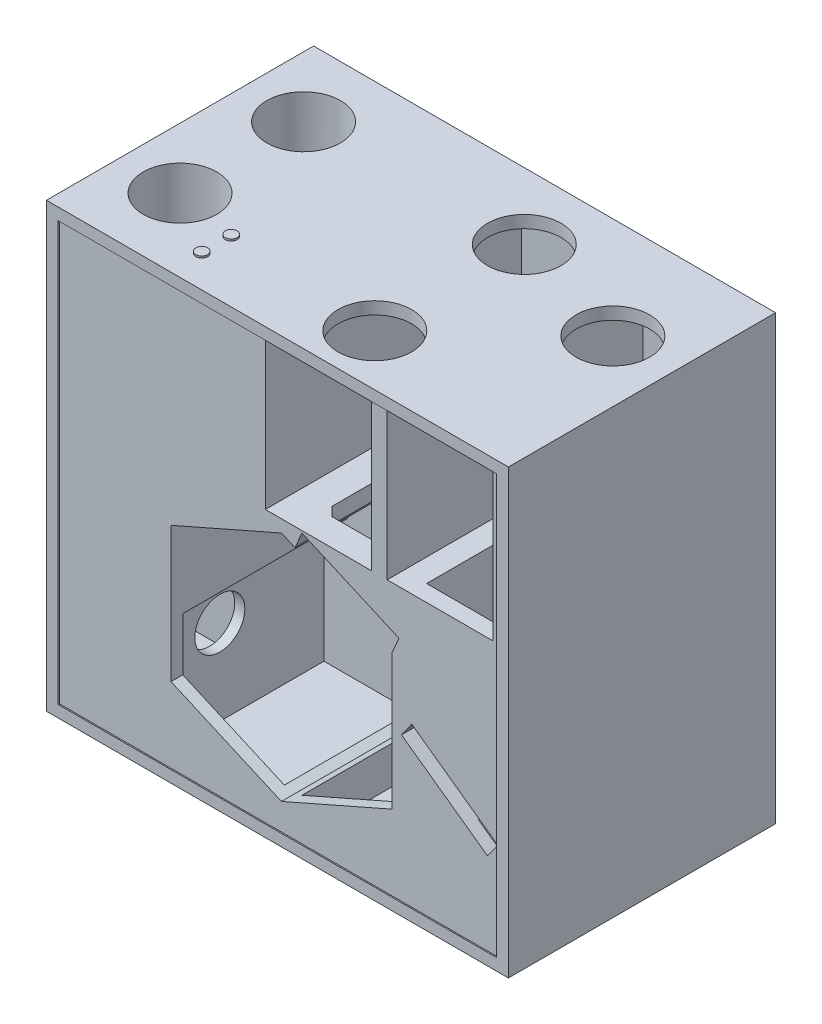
ISO-10303-21;
HEADER;
FILE_DESCRIPTION(('STEP AP214'),'2;1');
FILE_NAME('part.step','',(''),(''),'','','');
FILE_SCHEMA(('AUTOMOTIVE_DESIGN { 1 0 10303 214 1 1 1 1 }'));
ENDSEC;
DATA;
#1=APPLICATION_CONTEXT('core data for automotive mechanical design processes');
#2=APPLICATION_PROTOCOL_DEFINITION('international standard','automotive_design',2000,#1);
#3=PRODUCT_CONTEXT('',#1,'mechanical');
#4=PRODUCT('Part','Part','',(#3));
#5=PRODUCT_RELATED_PRODUCT_CATEGORY('part','',(#4));
#6=PRODUCT_DEFINITION_FORMATION('','',#4);
#7=PRODUCT_DEFINITION_CONTEXT('part definition',#1,'design');
#8=PRODUCT_DEFINITION('design','',#6,#7);
#9=PRODUCT_DEFINITION_SHAPE('','',#8);
#10=(LENGTH_UNIT() NAMED_UNIT(*) SI_UNIT(.MILLI.,.METRE.));
#11=(NAMED_UNIT(*) PLANE_ANGLE_UNIT() SI_UNIT($,.RADIAN.));
#12=(NAMED_UNIT(*) SI_UNIT($,.STERADIAN.) SOLID_ANGLE_UNIT());
#13=UNCERTAINTY_MEASURE_WITH_UNIT(LENGTH_MEASURE(1.E-05),#10,'distance_accuracy_value','');
#14=(GEOMETRIC_REPRESENTATION_CONTEXT(3) GLOBAL_UNCERTAINTY_ASSIGNED_CONTEXT((#13)) GLOBAL_UNIT_ASSIGNED_CONTEXT((#10,
#11,#12)) REPRESENTATION_CONTEXT('',''));
#15=CARTESIAN_POINT('',(0.,0.,0.));
#16=DIRECTION('',(0.,0.,1.));
#17=DIRECTION('',(1.,0.,0.));
#18=AXIS2_PLACEMENT_3D('',#15,#16,#17);
#19=CARTESIAN_POINT('',(392.501,-224.,102.));
#20=DIRECTION('',(-1.,0.,0.));
#21=DIRECTION('',(0.,0.,1.));
#22=AXIS2_PLACEMENT_3D('',#19,#20,#21);
#23=CYLINDRICAL_SURFACE('',#22,42.5);
#24=CARTESIAN_POINT('',(-240.,-224.,102.));
#25=DIRECTION('',(-1.,0.,0.));
#26=DIRECTION('',(0.,0.,1.));
#27=AXIS2_PLACEMENT_3D('',#24,#25,#26);
#28=CIRCLE('',#27,42.5);
#29=CARTESIAN_POINT('',(-240.,-224.,144.5));
#30=VERTEX_POINT('',#29);
#31=EDGE_CURVE('E719',#30,#30,#28,.T.);
#32=ORIENTED_EDGE('',*,*,#31,.T.);
#33=EDGE_LOOP('',(#32));
#34=FACE_BOUND('',#33,.T.);
#35=CARTESIAN_POINT('',(-222.833185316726,-224.,102.));
#36=DIRECTION('',(1.,0.,0.));
#37=DIRECTION('',(0.,0.,-1.));
#38=AXIS2_PLACEMENT_3D('',#35,#36,#37);
#39=CIRCLE('',#38,42.5);
#40=CARTESIAN_POINT('',(-222.833185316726,-224.,59.5));
#41=VERTEX_POINT('',#40);
#42=EDGE_CURVE('E38',#41,#41,#39,.F.);
#43=ORIENTED_EDGE('',*,*,#42,.F.);
#44=EDGE_LOOP('',(#43));
#45=FACE_BOUND('',#44,.T.);
#46=ADVANCED_FACE('F34',(#34,#45),#23,.F.);
#47=CARTESIAN_POINT('',(-335.,-304.,-82.));
#48=DIRECTION('',(-1.,0.,0.));
#49=DIRECTION('',(0.,0.,1.));
#50=AXIS2_PLACEMENT_3D('',#47,#48,#49);
#51=PLANE('',#50);
#52=DIRECTION('',(0.,0.,1.));
#53=VECTOR('',#52,1.);
#54=CARTESIAN_POINT('',(-335.,76.0000000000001,-172.));
#55=LINE('',#54,#53);
#56=CARTESIAN_POINT('',(-335.,76.0000000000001,-172.));
#57=VERTEX_POINT('',#56);
#58=CARTESIAN_POINT('',(-335.,76.0000000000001,-82.));
#59=VERTEX_POINT('',#58);
#60=EDGE_CURVE('E60',#57,#59,#55,.T.);
#61=ORIENTED_EDGE('',*,*,#60,.F.);
#62=DIRECTION('',(0.,1.,0.));
#63=VECTOR('',#62,1.);
#64=CARTESIAN_POINT('',(-335.,-304.,-172.));
#65=LINE('',#64,#63);
#66=CARTESIAN_POINT('',(-335.,276.,-172.));
#67=VERTEX_POINT('',#66);
#68=EDGE_CURVE('E734',#57,#67,#65,.T.);
#69=ORIENTED_EDGE('',*,*,#68,.T.);
#70=DIRECTION('',(0.,0.,1.));
#71=VECTOR('',#70,1.);
#72=CARTESIAN_POINT('',(-335.,276.,-82.));
#73=LINE('',#72,#71);
#74=CARTESIAN_POINT('',(-335.,276.,-149.848570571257));
#75=VERTEX_POINT('',#74);
#76=EDGE_CURVE('E45',#67,#75,#73,.T.);
#77=ORIENTED_EDGE('',*,*,#76,.T.);
#78=CARTESIAN_POINT('',(-335.,276.,-82.));
#79=VERTEX_POINT('',#78);
#80=EDGE_CURVE('E11',#75,#79,#73,.T.);
#81=ORIENTED_EDGE('',*,*,#80,.T.);
#82=DIRECTION('',(0.,1.,0.));
#83=VECTOR('',#82,1.);
#84=CARTESIAN_POINT('',(-335.,-304.,-82.));
#85=LINE('',#84,#83);
#86=EDGE_CURVE('E733',#59,#79,#85,.T.);
#87=ORIENTED_EDGE('',*,*,#86,.F.);
#88=EDGE_LOOP('',(#61,#69,#77,#81,#87));
#89=FACE_BOUND('',#88,.T.);
#90=ADVANCED_FACE('F1287',(#89),#51,.F.);
#91=CARTESIAN_POINT('',(-335.,-304.,-172.));
#92=DIRECTION('',(0.,0.,-1.));
#93=DIRECTION('',(-1.,0.,0.));
#94=AXIS2_PLACEMENT_3D('',#91,#92,#93);
#95=PLANE('',#94);
#96=DIRECTION('',(-1.,0.,0.));
#97=VECTOR('',#96,1.);
#98=CARTESIAN_POINT('',(-240.,76.0000000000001,-172.));
#99=LINE('',#98,#97);
#100=CARTESIAN_POINT('',(-240.,76.0000000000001,-172.));
#101=VERTEX_POINT('',#100);
#102=EDGE_CURVE('E1765',#101,#57,#99,.T.);
#103=ORIENTED_EDGE('',*,*,#102,.F.);
#104=DIRECTION('',(0.,1.,0.));
#105=VECTOR('',#104,1.);
#106=CARTESIAN_POINT('',(-240.,-304.,-172.));
#107=LINE('',#106,#105);
#108=CARTESIAN_POINT('',(-240.,276.,-172.));
#109=VERTEX_POINT('',#108);
#110=EDGE_CURVE('E737',#101,#109,#107,.T.);
#111=ORIENTED_EDGE('',*,*,#110,.T.);
#112=DIRECTION('',(-1.,0.,0.));
#113=VECTOR('',#112,1.);
#114=CARTESIAN_POINT('',(-335.,276.,-172.));
#115=LINE('',#114,#113);
#116=EDGE_CURVE('E730',#109,#67,#115,.T.);
#117=ORIENTED_EDGE('',*,*,#116,.T.);
#118=ORIENTED_EDGE('',*,*,#68,.F.);
#119=EDGE_LOOP('',(#103,#111,#117,#118));
#120=FACE_BOUND('',#119,.T.);
#121=ADVANCED_FACE('F1293',(#120),#95,.F.);
#122=CARTESIAN_POINT('',(-240.,-304.,-82.));
#123=DIRECTION('',(1.,0.,0.));
#124=DIRECTION('',(0.,0.,-1.));
#125=AXIS2_PLACEMENT_3D('',#122,#123,#124);
#126=PLANE('',#125);
#127=CARTESIAN_POINT('',(-240.,131.,-127.));
#128=DIRECTION('',(-1.,0.,0.));
#129=DIRECTION('',(0.,0.,1.));
#130=AXIS2_PLACEMENT_3D('',#127,#128,#129);
#131=CIRCLE('',#130,42.5);
#132=CARTESIAN_POINT('',(-240.,131.,-84.4999999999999));
#133=VERTEX_POINT('',#132);
#134=EDGE_CURVE('E635',#133,#133,#131,.T.);
#135=ORIENTED_EDGE('',*,*,#134,.F.);
#136=EDGE_LOOP('',(#135));
#137=FACE_BOUND('',#136,.T.);
#138=DIRECTION('',(0.,0.,-1.));
#139=VECTOR('',#138,1.);
#140=CARTESIAN_POINT('',(-240.,76.0000000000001,-172.));
#141=LINE('',#140,#139);
#142=CARTESIAN_POINT('',(-240.,76.0000000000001,-82.));
#143=VERTEX_POINT('',#142);
#144=EDGE_CURVE('E1768',#143,#101,#141,.T.);
#145=ORIENTED_EDGE('',*,*,#144,.F.);
#146=DIRECTION('',(0.,1.,0.));
#147=VECTOR('',#146,1.);
#148=CARTESIAN_POINT('',(-240.,-304.,-82.));
#149=LINE('',#148,#147);
#150=CARTESIAN_POINT('',(-240.,276.,-82.));
#151=VERTEX_POINT('',#150);
#152=EDGE_CURVE('E739',#143,#151,#149,.T.);
#153=ORIENTED_EDGE('',*,*,#152,.T.);
#154=DIRECTION('',(0.,0.,-1.));
#155=VECTOR('',#154,1.);
#156=CARTESIAN_POINT('',(-240.,276.,-82.));
#157=LINE('',#156,#155);
#158=CARTESIAN_POINT('',(-240.,276.,-145.157568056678));
#159=VERTEX_POINT('',#158);
#160=EDGE_CURVE('E727',#151,#159,#157,.T.);
#161=ORIENTED_EDGE('',*,*,#160,.T.);
#162=EDGE_CURVE('E726',#159,#109,#157,.T.);
#163=ORIENTED_EDGE('',*,*,#162,.T.);
#164=ORIENTED_EDGE('',*,*,#110,.F.);
#165=EDGE_LOOP('',(#145,#153,#161,#163,#164));
#166=FACE_BOUND('',#165,.T.);
#167=ADVANCED_FACE('F1308',(#137,#166),#126,.F.);
#168=CARTESIAN_POINT('',(-335.,-304.,-82.));
#169=DIRECTION('',(0.,0.,1.));
#170=DIRECTION('',(1.,0.,0.));
#171=AXIS2_PLACEMENT_3D('',#168,#169,#170);
#172=PLANE('',#171);
#173=DIRECTION('',(1.,0.,0.));
#174=VECTOR('',#173,1.);
#175=CARTESIAN_POINT('',(-240.,76.0000000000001,-82.));
#176=LINE('',#175,#174);
#177=EDGE_CURVE('E1761',#59,#143,#176,.T.);
#178=ORIENTED_EDGE('',*,*,#177,.F.);
#179=ORIENTED_EDGE('',*,*,#86,.T.);
#180=DIRECTION('',(1.,0.,0.));
#181=VECTOR('',#180,1.);
#182=CARTESIAN_POINT('',(-335.,276.,-82.));
#183=LINE('',#182,#181);
#184=EDGE_CURVE('E723',#79,#151,#183,.T.);
#185=ORIENTED_EDGE('',*,*,#184,.T.);
#186=ORIENTED_EDGE('',*,*,#152,.F.);
#187=EDGE_LOOP('',(#178,#179,#185,#186));
#188=FACE_BOUND('',#187,.T.);
#189=ADVANCED_FACE('F1312',(#188),#172,.F.);
#190=CARTESIAN_POINT('',(-289.5,276.,103.));
#191=DIRECTION('',(0.,1.,0.));
#192=DIRECTION('',(0.,0.,1.));
#193=AXIS2_PLACEMENT_3D('',#190,#191,#192);
#194=PLANE('',#193);
#195=DIRECTION('',(0.,0.,1.));
#196=VECTOR('',#195,1.);
#197=CARTESIAN_POINT('',(-335.,276.,149.5));
#198=LINE('',#197,#196);
#199=CARTESIAN_POINT('',(-335.,276.,60.1514294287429));
#200=VERTEX_POINT('',#199);
#201=CARTESIAN_POINT('',(-335.,276.,145.848570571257));
#202=VERTEX_POINT('',#201);
#203=EDGE_CURVE('E43',#200,#202,#198,.T.);
#204=ORIENTED_EDGE('',*,*,#203,.F.);
#205=CARTESIAN_POINT('',(-289.5,276.,103.));
#206=DIRECTION('',(0.,1.,0.));
#207=DIRECTION('',(0.,0.,1.));
#208=AXIS2_PLACEMENT_3D('',#205,#206,#207);
#209=CIRCLE('',#208,62.5);
#210=EDGE_CURVE('E1914',#200,#202,#209,.T.);
#211=ORIENTED_EDGE('',*,*,#210,.T.);
#212=EDGE_LOOP('',(#204,#211));
#213=FACE_BOUND('',#212,.T.);
#214=ADVANCED_FACE('F1315',(#213),#194,.T.);
#215=DIRECTION('',(1.,0.,0.));
#216=VECTOR('',#215,1.);
#217=CARTESIAN_POINT('',(-335.,276.,149.5));
#218=LINE('',#217,#216);
#219=CARTESIAN_POINT('',(-331.261226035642,276.,149.5));
#220=VERTEX_POINT('',#219);
#221=CARTESIAN_POINT('',(-247.738773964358,276.,149.5));
#222=VERTEX_POINT('',#221);
#223=EDGE_CURVE('E750',#220,#222,#218,.T.);
#224=ORIENTED_EDGE('',*,*,#223,.F.);
#225=EDGE_CURVE('E1184',#220,#222,#209,.T.);
#226=ORIENTED_EDGE('',*,*,#225,.T.);
#227=EDGE_LOOP('',(#224,#226));
#228=FACE_BOUND('',#227,.T.);
#229=ADVANCED_FACE('F1890',(#228),#194,.T.);
#230=DIRECTION('',(0.,0.,-1.));
#231=VECTOR('',#230,1.);
#232=CARTESIAN_POINT('',(-240.,276.,149.5));
#233=LINE('',#232,#231);
#234=CARTESIAN_POINT('',(-240.,276.,141.157568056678));
#235=VERTEX_POINT('',#234);
#236=CARTESIAN_POINT('',(-240.,276.,64.8424319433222));
#237=VERTEX_POINT('',#236);
#238=EDGE_CURVE('E755',#235,#237,#233,.T.);
#239=ORIENTED_EDGE('',*,*,#238,.F.);
#240=EDGE_CURVE('E1188',#235,#237,#209,.T.);
#241=ORIENTED_EDGE('',*,*,#240,.T.);
#242=EDGE_LOOP('',(#239,#241));
#243=FACE_BOUND('',#242,.T.);
#244=ADVANCED_FACE('F1612',(#243),#194,.T.);
#245=CARTESIAN_POINT('',(223.5,-194.,-53.));
#246=DIRECTION('',(0.,-0.36603623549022,0.930600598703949));
#247=DIRECTION('',(0.,-0.930600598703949,-0.36603623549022));
#248=AXIS2_PLACEMENT_3D('',#245,#246,#247);
#249=PLANE('',#248);
#250=DIRECTION('',(-0.55566484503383,-0.773707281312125,-0.304324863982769));
#251=VECTOR('',#250,1.);
#252=CARTESIAN_POINT('',(172.133340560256,-162.051960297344,-40.4337710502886));
#253=LINE('',#252,#251);
#254=CARTESIAN_POINT('',(226.298084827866,-86.6330141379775,-10.7689855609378));
#255=VERTEX_POINT('',#254);
#256=CARTESIAN_POINT('',(223.5,-90.5290651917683,-12.3014323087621));
#257=VERTEX_POINT('',#256);
#258=EDGE_CURVE('E866',#255,#257,#253,.T.);
#259=ORIENTED_EDGE('',*,*,#258,.F.);
#260=DIRECTION('',(-0.791661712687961,0.568559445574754,0.22363338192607));
#261=VECTOR('',#260,1.);
#262=CARTESIAN_POINT('',(280.347713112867,-125.45063812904,-26.0372509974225));
#263=LINE('',#262,#261);
#264=CARTESIAN_POINT('',(348.5,-174.396577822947,-45.2893206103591));
#265=VERTEX_POINT('',#264);
#266=EDGE_CURVE('E858',#265,#255,#263,.T.);
#267=ORIENTED_EDGE('',*,*,#266,.F.);
#268=DIRECTION('',(0.,-0.930600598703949,-0.36603623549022));
#269=VECTOR('',#268,1.);
#270=CARTESIAN_POINT('',(348.5,-194.,-53.));
#271=LINE('',#270,#269);
#272=CARTESIAN_POINT('',(348.5,105.,64.6066666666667));
#273=VERTEX_POINT('',#272);
#274=EDGE_CURVE('E1055',#273,#265,#271,.T.);
#275=ORIENTED_EDGE('',*,*,#274,.F.);
#276=DIRECTION('',(-1.,0.,0.));
#277=VECTOR('',#276,1.);
#278=CARTESIAN_POINT('',(184.5,105.,64.6066666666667));
#279=LINE('',#278,#277);
#280=CARTESIAN_POINT('',(223.5,105.,64.6066666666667));
#281=VERTEX_POINT('',#280);
#282=EDGE_CURVE('E1230',#273,#281,#279,.T.);
#283=ORIENTED_EDGE('',*,*,#282,.T.);
#284=DIRECTION('',(0.,-0.930600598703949,-0.36603623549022));
#285=VECTOR('',#284,1.);
#286=CARTESIAN_POINT('',(223.5,-194.,-53.));
#287=LINE('',#286,#285);
#288=EDGE_CURVE('E1061',#281,#257,#287,.T.);
#289=ORIENTED_EDGE('',*,*,#288,.T.);
#290=EDGE_LOOP('',(#259,#267,#275,#283,#289));
#291=FACE_BOUND('',#290,.T.);
#292=ADVANCED_FACE('F1510',(#291),#249,.T.);
#293=CARTESIAN_POINT('',(223.5,106.,197.));
#294=DIRECTION('',(0.,0.,-1.));
#295=DIRECTION('',(0.,1.,0.));
#296=AXIS2_PLACEMENT_3D('',#293,#294,#295);
#297=PLANE('',#296);
#298=DIRECTION('',(0.583333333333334,0.812232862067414,0.));
#299=VECTOR('',#298,1.);
#300=CARTESIAN_POINT('',(316.615962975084,39.1255264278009,197.));
#301=LINE('',#300,#299);
#302=CARTESIAN_POINT('',(223.5,-90.5290651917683,197.));
#303=VERTEX_POINT('',#302);
#304=CARTESIAN_POINT('',(226.298084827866,-86.6330141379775,197.));
#305=VERTEX_POINT('',#304);
#306=EDGE_CURVE('E864',#303,#305,#301,.T.);
#307=ORIENTED_EDGE('',*,*,#306,.F.);
#308=DIRECTION('',(0.,1.,0.));
#309=VECTOR('',#308,1.);
#310=CARTESIAN_POINT('',(223.5,106.,197.));
#311=LINE('',#310,#309);
#312=CARTESIAN_POINT('',(223.5,105.,197.));
#313=VERTEX_POINT('',#312);
#314=EDGE_CURVE('E1064',#303,#313,#311,.T.);
#315=ORIENTED_EDGE('',*,*,#314,.T.);
#316=DIRECTION('',(1.,0.,0.));
#317=VECTOR('',#316,1.);
#318=CARTESIAN_POINT('',(184.5,105.,197.));
#319=LINE('',#318,#317);
#320=CARTESIAN_POINT('',(348.5,105.,197.));
#321=VERTEX_POINT('',#320);
#322=EDGE_CURVE('E1227',#313,#321,#319,.T.);
#323=ORIENTED_EDGE('',*,*,#322,.T.);
#324=DIRECTION('',(0.,1.,0.));
#325=VECTOR('',#324,1.);
#326=CARTESIAN_POINT('',(348.5,106.,197.));
#327=LINE('',#326,#325);
#328=CARTESIAN_POINT('',(348.5,-174.396577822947,197.));
#329=VERTEX_POINT('',#328);
#330=EDGE_CURVE('E1058',#329,#321,#327,.T.);
#331=ORIENTED_EDGE('',*,*,#330,.F.);
#332=DIRECTION('',(0.812232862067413,-0.583333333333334,0.));
#333=VECTOR('',#332,1.);
#334=CARTESIAN_POINT('',(133.182121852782,-19.7585405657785,197.));
#335=LINE('',#334,#333);
#336=EDGE_CURVE('E856',#305,#329,#335,.T.);
#337=ORIENTED_EDGE('',*,*,#336,.F.);
#338=EDGE_LOOP('',(#307,#315,#323,#331,#337));
#339=FACE_BOUND('',#338,.T.);
#340=ADVANCED_FACE('F1505',(#339),#297,.T.);
#341=CARTESIAN_POINT('',(223.5,106.,197.));
#342=DIRECTION('',(1.,0.,0.));
#343=DIRECTION('',(0.,1.,0.));
#344=AXIS2_PLACEMENT_3D('',#341,#342,#343);
#345=PLANE('',#344);
#346=DIRECTION('',(0.,0.,1.));
#347=VECTOR('',#346,1.);
#348=CARTESIAN_POINT('',(223.5,-90.5290651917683,197.));
#349=LINE('',#348,#347);
#350=EDGE_CURVE('E862',#257,#303,#349,.T.);
#351=ORIENTED_EDGE('',*,*,#350,.F.);
#352=ORIENTED_EDGE('',*,*,#288,.F.);
#353=DIRECTION('',(0.,0.,1.));
#354=VECTOR('',#353,1.);
#355=CARTESIAN_POINT('',(223.5,105.,-210.));
#356=LINE('',#355,#354);
#357=EDGE_CURVE('E1232',#281,#313,#356,.T.);
#358=ORIENTED_EDGE('',*,*,#357,.T.);
#359=ORIENTED_EDGE('',*,*,#314,.F.);
#360=EDGE_LOOP('',(#351,#352,#358,#359));
#361=FACE_BOUND('',#360,.T.);
#362=ADVANCED_FACE('F1500',(#361),#345,.T.);
#363=CARTESIAN_POINT('',(223.5,-194.,-62.9999999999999));
#364=DIRECTION('',(0.,0.,-1.));
#365=DIRECTION('',(-1.,0.,0.));
#366=AXIS2_PLACEMENT_3D('',#363,#364,#365);
#367=PLANE('',#366);
#368=DIRECTION('',(0.583333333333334,0.812232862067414,0.));
#369=VECTOR('',#368,1.);
#370=CARTESIAN_POINT('',(174.475212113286,-158.791140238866,-62.9999999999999));
#371=LINE('',#370,#369);
#372=CARTESIAN_POINT('',(223.5,-90.5290651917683,-62.9999999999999));
#373=VERTEX_POINT('',#372);
#374=CARTESIAN_POINT('',(226.298084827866,-86.6330141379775,-62.9999999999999));
#375=VERTEX_POINT('',#374);
#376=EDGE_CURVE('E860',#373,#375,#371,.T.);
#377=ORIENTED_EDGE('',*,*,#376,.F.);
#378=DIRECTION('',(0.,1.,0.));
#379=VECTOR('',#378,1.);
#380=CARTESIAN_POINT('',(223.5,-194.,-62.9999999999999));
#381=LINE('',#380,#379);
#382=CARTESIAN_POINT('',(223.5,105.,-62.9999999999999));
#383=VERTEX_POINT('',#382);
#384=EDGE_CURVE('E1050',#373,#383,#381,.T.);
#385=ORIENTED_EDGE('',*,*,#384,.T.);
#386=DIRECTION('',(1.,0.,0.));
#387=VECTOR('',#386,1.);
#388=CARTESIAN_POINT('',(184.5,105.,-62.9999999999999));
#389=LINE('',#388,#387);
#390=CARTESIAN_POINT('',(348.5,105.,-62.9999999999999));
#391=VERTEX_POINT('',#390);
#392=EDGE_CURVE('E1238',#383,#391,#389,.T.);
#393=ORIENTED_EDGE('',*,*,#392,.T.);
#394=DIRECTION('',(0.,1.,0.));
#395=VECTOR('',#394,1.);
#396=CARTESIAN_POINT('',(348.5,-194.,-62.9999999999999));
#397=LINE('',#396,#395);
#398=CARTESIAN_POINT('',(348.5,-174.396577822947,-62.9999999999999));
#399=VERTEX_POINT('',#398);
#400=EDGE_CURVE('E1043',#399,#391,#397,.T.);
#401=ORIENTED_EDGE('',*,*,#400,.F.);
#402=DIRECTION('',(0.812232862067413,-0.583333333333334,0.));
#403=VECTOR('',#402,1.);
#404=CARTESIAN_POINT('',(275.32287271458,-121.841873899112,-62.9999999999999));
#405=LINE('',#404,#403);
#406=EDGE_CURVE('E851',#375,#399,#405,.T.);
#407=ORIENTED_EDGE('',*,*,#406,.F.);
#408=EDGE_LOOP('',(#377,#385,#393,#401,#407));
#409=FACE_BOUND('',#408,.T.);
#410=ADVANCED_FACE('F1485',(#409),#367,.T.);
#411=CARTESIAN_POINT('',(223.5,-190.5,205.));
#412=DIRECTION('',(0.,1.,0.));
#413=DIRECTION('',(0.,0.,1.));
#414=AXIS2_PLACEMENT_3D('',#411,#412,#413);
#415=PLANE('',#414);
#416=DIRECTION('',(1.,0.,0.));
#417=VECTOR('',#416,1.);
#418=CARTESIAN_POINT('',(223.5,-190.5,-53.));
#419=LINE('',#418,#417);
#420=CARTESIAN_POINT('',(223.5,-190.5,-53.));
#421=VERTEX_POINT('',#420);
#422=CARTESIAN_POINT('',(319.493820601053,-190.5,-53.));
#423=VERTEX_POINT('',#422);
#424=EDGE_CURVE('E877',#421,#423,#419,.T.);
#425=ORIENTED_EDGE('',*,*,#424,.T.);
#426=DIRECTION('',(0.,0.,1.));
#427=VECTOR('',#426,1.);
#428=CARTESIAN_POINT('',(319.493820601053,-190.5,205.));
#429=LINE('',#428,#427);
#430=CARTESIAN_POINT('',(319.493820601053,-190.5,-51.6233333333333));
#431=VERTEX_POINT('',#430);
#432=EDGE_CURVE('E1256',#423,#431,#429,.T.);
#433=ORIENTED_EDGE('',*,*,#432,.T.);
#434=DIRECTION('',(-1.,0.,0.));
#435=VECTOR('',#434,1.);
#436=CARTESIAN_POINT('',(223.5,-190.5,-51.6233333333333));
#437=LINE('',#436,#435);
#438=CARTESIAN_POINT('',(223.5,-190.5,-51.6233333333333));
#439=VERTEX_POINT('',#438);
#440=EDGE_CURVE('E891',#431,#439,#437,.T.);
#441=ORIENTED_EDGE('',*,*,#440,.T.);
#442=DIRECTION('',(0.,0.,-1.));
#443=VECTOR('',#442,1.);
#444=CARTESIAN_POINT('',(223.5,-190.5,-53.));
#445=LINE('',#444,#443);
#446=EDGE_CURVE('E874',#439,#421,#445,.T.);
#447=ORIENTED_EDGE('',*,*,#446,.T.);
#448=EDGE_LOOP('',(#425,#433,#441,#447));
#449=FACE_BOUND('',#448,.T.);
#450=ADVANCED_FACE('F1382',(#449),#415,.F.);
#451=CARTESIAN_POINT('',(300.,-376.,150.));
#452=DIRECTION('',(0.,-1.,0.));
#453=DIRECTION('',(0.,0.,-1.));
#454=AXIS2_PLACEMENT_3D('',#451,#452,#453);
#455=CYLINDRICAL_SURFACE('',#454,3.40000000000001);
#456=CARTESIAN_POINT('',(300.,-376.,150.));
#457=DIRECTION('',(0.,-1.,0.));
#458=DIRECTION('',(0.,0.,-1.));
#459=AXIS2_PLACEMENT_3D('',#456,#457,#458);
#460=CIRCLE('',#459,3.40000000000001);
#461=CARTESIAN_POINT('',(300.,-376.,146.6));
#462=VERTEX_POINT('',#461);
#463=EDGE_CURVE('E1160',#462,#462,#460,.T.);
#464=ORIENTED_EDGE('',*,*,#463,.T.);
#465=EDGE_LOOP('',(#464));
#466=FACE_BOUND('',#465,.T.);
#467=CARTESIAN_POINT('',(300.,-368.5,150.));
#468=DIRECTION('',(0.,1.,0.));
#469=DIRECTION('',(0.,0.,1.));
#470=AXIS2_PLACEMENT_3D('',#467,#468,#469);
#471=CIRCLE('',#470,3.40000000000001);
#472=CARTESIAN_POINT('',(300.,-368.5,153.4));
#473=VERTEX_POINT('',#472);
#474=EDGE_CURVE('E911',#473,#473,#471,.F.);
#475=ORIENTED_EDGE('',*,*,#474,.F.);
#476=EDGE_LOOP('',(#475));
#477=FACE_BOUND('',#476,.T.);
#478=ADVANCED_FACE('F1408',(#466,#477),#455,.F.);
#479=CARTESIAN_POINT('',(182.5,-368.5,-75.));
#480=DIRECTION('',(-1.,0.,0.));
#481=DIRECTION('',(0.,0.,1.));
#482=AXIS2_PLACEMENT_3D('',#479,#480,#481);
#483=PLANE('',#482);
#484=DIRECTION('',(0.,1.,0.));
#485=VECTOR('',#484,1.);
#486=CARTESIAN_POINT('',(182.5,-368.5,-75.));
#487=LINE('',#486,#485);
#488=CARTESIAN_POINT('',(182.5,-235.5,-75.));
#489=VERTEX_POINT('',#488);
#490=CARTESIAN_POINT('',(182.5,-232.89609409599,-75.));
#491=VERTEX_POINT('',#490);
#492=EDGE_CURVE('E926',#489,#491,#487,.T.);
#493=ORIENTED_EDGE('',*,*,#492,.F.);
#494=DIRECTION('',(0.,0.,1.));
#495=VECTOR('',#494,1.);
#496=CARTESIAN_POINT('',(182.5,-235.5,-75.));
#497=LINE('',#496,#495);
#498=CARTESIAN_POINT('',(182.5,-235.5,205.));
#499=VERTEX_POINT('',#498);
#500=EDGE_CURVE('E1250',#489,#499,#497,.T.);
#501=ORIENTED_EDGE('',*,*,#500,.T.);
#502=DIRECTION('',(0.,1.,0.));
#503=VECTOR('',#502,1.);
#504=CARTESIAN_POINT('',(182.5,-368.5,205.));
#505=LINE('',#504,#503);
#506=CARTESIAN_POINT('',(182.5,-232.89609409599,205.));
#507=VERTEX_POINT('',#506);
#508=EDGE_CURVE('E923',#499,#507,#505,.T.);
#509=ORIENTED_EDGE('',*,*,#508,.T.);
#510=DIRECTION('',(0.,0.,-1.));
#511=VECTOR('',#510,1.);
#512=CARTESIAN_POINT('',(182.5,-232.89609409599,-75.));
#513=LINE('',#512,#511);
#514=EDGE_CURVE('E930',#507,#491,#513,.T.);
#515=ORIENTED_EDGE('',*,*,#514,.T.);
#516=EDGE_LOOP('',(#493,#501,#509,#515));
#517=FACE_BOUND('',#516,.T.);
#518=ADVANCED_FACE('F1404',(#517),#483,.T.);
#519=CARTESIAN_POINT('',(192.5,-228.5,-75.));
#520=DIRECTION('',(0.402439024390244,-0.91544679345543,0.));
#521=DIRECTION('',(0.91544679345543,0.402439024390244,0.));
#522=AXIS2_PLACEMENT_3D('',#519,#520,#521);
#523=PLANE('',#522);
#524=DIRECTION('',(0.,0.,1.));
#525=VECTOR('',#524,1.);
#526=CARTESIAN_POINT('',(19.8268146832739,-304.408757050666,-75.));
#527=LINE('',#526,#525);
#528=CARTESIAN_POINT('',(19.8268146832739,-304.408757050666,-75.));
#529=VERTEX_POINT('',#528);
#530=CARTESIAN_POINT('',(19.8268146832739,-304.408757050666,205.));
#531=VERTEX_POINT('',#530);
#532=EDGE_CURVE('E933',#529,#531,#527,.T.);
#533=ORIENTED_EDGE('',*,*,#532,.F.);
#534=DIRECTION('',(0.91544679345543,0.402439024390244,0.));
#535=VECTOR('',#534,1.);
#536=CARTESIAN_POINT('',(192.5,-228.5,-75.));
#537=LINE('',#536,#535);
#538=CARTESIAN_POINT('',(4.83340734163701,-311.,-75.));
#539=VERTEX_POINT('',#538);
#540=EDGE_CURVE('E973',#539,#529,#537,.T.);
#541=ORIENTED_EDGE('',*,*,#540,.F.);
#542=DIRECTION('',(0.,0.,1.));
#543=VECTOR('',#542,1.);
#544=CARTESIAN_POINT('',(4.83340734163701,-311.,-75.));
#545=LINE('',#544,#543);
#546=CARTESIAN_POINT('',(4.83340734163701,-311.,225.));
#547=VERTEX_POINT('',#546);
#548=EDGE_CURVE('E1000',#539,#547,#545,.T.);
#549=ORIENTED_EDGE('',*,*,#548,.T.);
#550=DIRECTION('',(0.91544679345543,0.402439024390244,0.));
#551=VECTOR('',#550,1.);
#552=CARTESIAN_POINT('',(192.5,-228.5,225.));
#553=LINE('',#552,#551);
#554=CARTESIAN_POINT('',(192.5,-228.5,225.));
#555=VERTEX_POINT('',#554);
#556=EDGE_CURVE('E956',#547,#555,#553,.T.);
#557=ORIENTED_EDGE('',*,*,#556,.T.);
#558=DIRECTION('',(0.,0.,1.));
#559=VECTOR('',#558,1.);
#560=CARTESIAN_POINT('',(192.5,-228.5,-75.));
#561=LINE('',#560,#559);
#562=CARTESIAN_POINT('',(192.5,-228.5,-75.));
#563=VERTEX_POINT('',#562);
#564=EDGE_CURVE('E998',#563,#555,#561,.T.);
#565=ORIENTED_EDGE('',*,*,#564,.F.);
#566=EDGE_CURVE('E972',#491,#563,#537,.T.);
#567=ORIENTED_EDGE('',*,*,#566,.F.);
#568=ORIENTED_EDGE('',*,*,#514,.F.);
#569=DIRECTION('',(0.91544679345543,0.402439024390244,0.));
#570=VECTOR('',#569,1.);
#571=CARTESIAN_POINT('',(192.5,-228.5,205.));
#572=LINE('',#571,#570);
#573=EDGE_CURVE('E1248',#531,#507,#572,.T.);
#574=ORIENTED_EDGE('',*,*,#573,.F.);
#575=EDGE_LOOP('',(#533,#541,#549,#557,#565,#567,#568,#574));
#576=FACE_BOUND('',#575,.T.);
#577=ADVANCED_FACE('F1407',(#576),#523,.F.);
#578=CARTESIAN_POINT('',(4.83340734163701,-311.,-75.));
#579=DIRECTION('',(-0.402439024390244,-0.91544679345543,0.));
#580=DIRECTION('',(0.91544679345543,-0.402439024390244,0.));
#581=AXIS2_PLACEMENT_3D('',#578,#579,#580);
#582=PLANE('',#581);
#583=DIRECTION('',(0.,0.,-1.));
#584=VECTOR('',#583,1.);
#585=CARTESIAN_POINT('',(-10.1731853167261,-304.402960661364,-75.));
#586=LINE('',#585,#584);
#587=CARTESIAN_POINT('',(-10.1731853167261,-304.402960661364,205.));
#588=VERTEX_POINT('',#587);
#589=CARTESIAN_POINT('',(-10.1731853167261,-304.402960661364,-75.));
#590=VERTEX_POINT('',#589);
#591=EDGE_CURVE('E948',#588,#590,#586,.T.);
#592=ORIENTED_EDGE('',*,*,#591,.F.);
#593=DIRECTION('',(0.91544679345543,-0.402439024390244,0.));
#594=VECTOR('',#593,1.);
#595=CARTESIAN_POINT('',(4.83340734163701,-311.,205.));
#596=LINE('',#595,#594);
#597=CARTESIAN_POINT('',(-182.833185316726,-228.5,205.));
#598=VERTEX_POINT('',#597);
#599=EDGE_CURVE('E1246',#598,#588,#596,.T.);
#600=ORIENTED_EDGE('',*,*,#599,.F.);
#601=DIRECTION('',(0.,0.,1.));
#602=VECTOR('',#601,1.);
#603=CARTESIAN_POINT('',(-182.833185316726,-228.5,-75.));
#604=LINE('',#603,#602);
#605=CARTESIAN_POINT('',(-182.833185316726,-228.5,225.));
#606=VERTEX_POINT('',#605);
#607=EDGE_CURVE('E986',#598,#606,#604,.T.);
#608=ORIENTED_EDGE('',*,*,#607,.T.);
#609=DIRECTION('',(0.91544679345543,-0.402439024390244,0.));
#610=VECTOR('',#609,1.);
#611=CARTESIAN_POINT('',(4.83340734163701,-311.,225.));
#612=LINE('',#611,#610);
#613=EDGE_CURVE('E953',#606,#547,#612,.T.);
#614=ORIENTED_EDGE('',*,*,#613,.T.);
#615=ORIENTED_EDGE('',*,*,#548,.F.);
#616=DIRECTION('',(0.91544679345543,-0.402439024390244,0.));
#617=VECTOR('',#616,1.);
#618=CARTESIAN_POINT('',(4.83340734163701,-311.,-75.));
#619=LINE('',#618,#617);
#620=EDGE_CURVE('E970',#590,#539,#619,.T.);
#621=ORIENTED_EDGE('',*,*,#620,.F.);
#622=EDGE_LOOP('',(#592,#600,#608,#614,#615,#621));
#623=FACE_BOUND('',#622,.T.);
#624=ADVANCED_FACE('F1443',(#623),#582,.F.);
#625=CARTESIAN_POINT('',(184.5,105.,-210.));
#626=DIRECTION('',(0.,-1.,0.));
#627=DIRECTION('',(0.,0.,-1.));
#628=AXIS2_PLACEMENT_3D('',#625,#626,#627);
#629=PLANE('',#628);
#630=ORIENTED_EDGE('',*,*,#357,.F.);
#631=ORIENTED_EDGE('',*,*,#282,.F.);
#632=DIRECTION('',(0.,0.,1.));
#633=VECTOR('',#632,1.);
#634=CARTESIAN_POINT('',(348.5,105.,-210.));
#635=LINE('',#634,#633);
#636=EDGE_CURVE('E1224',#273,#321,#635,.T.);
#637=ORIENTED_EDGE('',*,*,#636,.T.);
#638=ORIENTED_EDGE('',*,*,#322,.F.);
#639=EDGE_LOOP('',(#630,#631,#637,#638));
#640=FACE_BOUND('',#639,.T.);
#641=DIRECTION('',(1.,0.,0.));
#642=VECTOR('',#641,1.);
#643=CARTESIAN_POINT('',(184.5,105.,225.));
#644=LINE('',#643,#642);
#645=CARTESIAN_POINT('',(184.5,105.,225.));
#646=VERTEX_POINT('',#645);
#647=CARTESIAN_POINT('',(364.5,105.,225.));
#648=VERTEX_POINT('',#647);
#649=EDGE_CURVE('E1070',#646,#648,#644,.T.);
#650=ORIENTED_EDGE('',*,*,#649,.T.);
#651=DIRECTION('',(0.,0.,1.));
#652=VECTOR('',#651,1.);
#653=CARTESIAN_POINT('',(364.5,105.,-210.));
#654=LINE('',#653,#652);
#655=CARTESIAN_POINT('',(364.5,105.,-210.));
#656=VERTEX_POINT('',#655);
#657=EDGE_CURVE('E1097',#656,#648,#654,.T.);
#658=ORIENTED_EDGE('',*,*,#657,.F.);
#659=DIRECTION('',(1.,0.,0.));
#660=VECTOR('',#659,1.);
#661=CARTESIAN_POINT('',(184.5,105.,-210.));
#662=LINE('',#661,#660);
#663=CARTESIAN_POINT('',(184.5,105.,-210.));
#664=VERTEX_POINT('',#663);
#665=EDGE_CURVE('E1082',#664,#656,#662,.T.);
#666=ORIENTED_EDGE('',*,*,#665,.F.);
#667=DIRECTION('',(0.,0.,1.));
#668=VECTOR('',#667,1.);
#669=CARTESIAN_POINT('',(184.5,105.,-210.));
#670=LINE('',#669,#668);
#671=EDGE_CURVE('E1091',#664,#646,#670,.T.);
#672=ORIENTED_EDGE('',*,*,#671,.T.);
#673=EDGE_LOOP('',(#650,#658,#666,#672));
#674=FACE_BOUND('',#673,.T.);
#675=DIRECTION('',(0.,0.,1.));
#676=VECTOR('',#675,1.);
#677=CARTESIAN_POINT('',(223.5,105.,-210.));
#678=LINE('',#677,#676);
#679=CARTESIAN_POINT('',(223.5,105.,-193.));
#680=VERTEX_POINT('',#679);
#681=EDGE_CURVE('E1243',#680,#383,#678,.T.);
#682=ORIENTED_EDGE('',*,*,#681,.F.);
#683=DIRECTION('',(-1.,0.,0.));
#684=VECTOR('',#683,1.);
#685=CARTESIAN_POINT('',(184.5,105.,-193.));
#686=LINE('',#685,#684);
#687=CARTESIAN_POINT('',(348.5,105.,-193.));
#688=VERTEX_POINT('',#687);
#689=EDGE_CURVE('E1241',#688,#680,#686,.T.);
#690=ORIENTED_EDGE('',*,*,#689,.F.);
#691=DIRECTION('',(0.,0.,1.));
#692=VECTOR('',#691,1.);
#693=CARTESIAN_POINT('',(348.5,105.,-210.));
#694=LINE('',#693,#692);
#695=EDGE_CURVE('E1235',#688,#391,#694,.T.);
#696=ORIENTED_EDGE('',*,*,#695,.T.);
#697=ORIENTED_EDGE('',*,*,#392,.F.);
#698=EDGE_LOOP('',(#682,#690,#696,#697));
#699=FACE_BOUND('',#698,.T.);
#700=ADVANCED_FACE('F1447',(#640,#674,#699),#629,.F.);
#701=CARTESIAN_POINT('',(-392.5,376.,227.));
#702=DIRECTION('',(0.,1.,0.));
#703=DIRECTION('',(0.,0.,1.));
#704=AXIS2_PLACEMENT_3D('',#701,#702,#703);
#705=PLANE('',#704);
#706=CARTESIAN_POINT('',(-182.5,376.,123.));
#707=DIRECTION('',(0.,1.,0.));
#708=DIRECTION('',(0.,0.,1.));
#709=AXIS2_PLACEMENT_3D('',#706,#707,#708);
#710=CIRCLE('',#709,10.);
#711=CARTESIAN_POINT('',(-182.5,376.,133.));
#712=VERTEX_POINT('',#711);
#713=EDGE_CURVE('E1142',#712,#712,#710,.T.);
#714=ORIENTED_EDGE('',*,*,#713,.F.);
#715=EDGE_LOOP('',(#714));
#716=FACE_BOUND('',#715,.T.);
#717=CARTESIAN_POINT('',(288.5,376.,-54.5));
#718=DIRECTION('',(0.,1.,0.));
#719=DIRECTION('',(0.,0.,1.));
#720=AXIS2_PLACEMENT_3D('',#717,#718,#719);
#721=CIRCLE('',#720,62.5);
#722=CARTESIAN_POINT('',(288.5,376.,8.00000000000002));
#723=VERTEX_POINT('',#722);
#724=EDGE_CURVE('E1172',#723,#723,#721,.T.);
#725=ORIENTED_EDGE('',*,*,#724,.F.);
#726=EDGE_LOOP('',(#725));
#727=FACE_BOUND('',#726,.T.);
#728=CARTESIAN_POINT('',(78.5,376.,140.));
#729=DIRECTION('',(0.,1.,0.));
#730=DIRECTION('',(0.,0.,1.));
#731=AXIS2_PLACEMENT_3D('',#728,#729,#730);
#732=CIRCLE('',#731,62.5);
#733=CARTESIAN_POINT('',(78.5,376.,202.5));
#734=VERTEX_POINT('',#733);
#735=EDGE_CURVE('E1175',#734,#734,#732,.T.);
#736=ORIENTED_EDGE('',*,*,#735,.F.);
#737=EDGE_LOOP('',(#736));
#738=FACE_BOUND('',#737,.T.);
#739=CARTESIAN_POINT('',(78.4999999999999,376.,-114.));
#740=DIRECTION('',(0.,1.,0.));
#741=DIRECTION('',(0.,0.,1.));
#742=AXIS2_PLACEMENT_3D('',#739,#740,#741);
#743=CIRCLE('',#742,62.5);
#744=CARTESIAN_POINT('',(78.4999999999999,376.,-51.5));
#745=VERTEX_POINT('',#744);
#746=EDGE_CURVE('E1178',#745,#745,#743,.T.);
#747=ORIENTED_EDGE('',*,*,#746,.F.);
#748=EDGE_LOOP('',(#747));
#749=FACE_BOUND('',#748,.T.);
#750=CARTESIAN_POINT('',(-289.5,376.,103.));
#751=DIRECTION('',(0.,1.,0.));
#752=DIRECTION('',(0.,0.,1.));
#753=AXIS2_PLACEMENT_3D('',#750,#751,#752);
#754=CIRCLE('',#753,62.5);
#755=CARTESIAN_POINT('',(-289.5,376.,165.5));
#756=VERTEX_POINT('',#755);
#757=EDGE_CURVE('E1181',#756,#756,#754,.T.);
#758=ORIENTED_EDGE('',*,*,#757,.F.);
#759=EDGE_LOOP('',(#758));
#760=FACE_BOUND('',#759,.T.);
#761=CARTESIAN_POINT('',(-289.5,376.,-107.));
#762=DIRECTION('',(0.,1.,0.));
#763=DIRECTION('',(0.,0.,1.));
#764=AXIS2_PLACEMENT_3D('',#761,#762,#763);
#765=CIRCLE('',#764,62.5);
#766=CARTESIAN_POINT('',(-289.5,376.,-44.5));
#767=VERTEX_POINT('',#766);
#768=EDGE_CURVE('E1187',#767,#767,#765,.T.);
#769=ORIENTED_EDGE('',*,*,#768,.F.);
#770=EDGE_LOOP('',(#769));
#771=FACE_BOUND('',#770,.T.);
#772=DIRECTION('',(0.,0.,1.));
#773=VECTOR('',#772,1.);
#774=CARTESIAN_POINT('',(-392.5,376.,-227.));
#775=LINE('',#774,#773);
#776=CARTESIAN_POINT('',(-392.5,376.,-227.));
#777=VERTEX_POINT('',#776);
#778=CARTESIAN_POINT('',(-392.5,376.,227.));
#779=VERTEX_POINT('',#778);
#780=EDGE_CURVE('E1203',#777,#779,#775,.T.);
#781=ORIENTED_EDGE('',*,*,#780,.T.);
#782=DIRECTION('',(1.,0.,0.));
#783=VECTOR('',#782,1.);
#784=CARTESIAN_POINT('',(-392.5,376.,227.));
#785=LINE('',#784,#783);
#786=CARTESIAN_POINT('',(392.5,376.,227.));
#787=VERTEX_POINT('',#786);
#788=EDGE_CURVE('E1206',#779,#787,#785,.T.);
#789=ORIENTED_EDGE('',*,*,#788,.T.);
#790=DIRECTION('',(0.,0.,-1.));
#791=VECTOR('',#790,1.);
#792=CARTESIAN_POINT('',(392.5,376.,-227.));
#793=LINE('',#792,#791);
#794=CARTESIAN_POINT('',(392.5,376.,-227.));
#795=VERTEX_POINT('',#794);
#796=EDGE_CURVE('E1208',#787,#795,#793,.T.);
#797=ORIENTED_EDGE('',*,*,#796,.T.);
#798=DIRECTION('',(-1.,0.,0.));
#799=VECTOR('',#798,1.);
#800=CARTESIAN_POINT('',(-392.5,376.,-227.));
#801=LINE('',#800,#799);
#802=EDGE_CURVE('E1210',#795,#777,#801,.T.);
#803=ORIENTED_EDGE('',*,*,#802,.T.);
#804=EDGE_LOOP('',(#781,#789,#797,#803));
#805=FACE_BOUND('',#804,.T.);
#806=CARTESIAN_POINT('',(-182.5,376.,173.));
#807=DIRECTION('',(0.,1.,0.));
#808=DIRECTION('',(0.,0.,1.));
#809=AXIS2_PLACEMENT_3D('',#806,#807,#808);
#810=CIRCLE('',#809,10.);
#811=CARTESIAN_POINT('',(-182.5,376.,183.));
#812=VERTEX_POINT('',#811);
#813=EDGE_CURVE('E1130',#812,#812,#810,.T.);
#814=ORIENTED_EDGE('',*,*,#813,.F.);
#815=EDGE_LOOP('',(#814));
#816=FACE_BOUND('',#815,.T.);
#817=ADVANCED_FACE('F1526',(#716,#727,#738,#749,#760,#771,#805,#816),#705,.T.);
#818=CARTESIAN_POINT('',(-392.5,376.,-227.));
#819=DIRECTION('',(1.,0.,0.));
#820=DIRECTION('',(0.,0.,-1.));
#821=AXIS2_PLACEMENT_3D('',#818,#819,#820);
#822=PLANE('',#821);
#823=DIRECTION('',(0.,0.,1.));
#824=VECTOR('',#823,1.);
#825=CARTESIAN_POINT('',(-392.5,-376.,-227.));
#826=LINE('',#825,#824);
#827=CARTESIAN_POINT('',(-392.5,-376.,-227.));
#828=VERTEX_POINT('',#827);
#829=CARTESIAN_POINT('',(-392.5,-376.,227.));
#830=VERTEX_POINT('',#829);
#831=EDGE_CURVE('E1194',#828,#830,#826,.T.);
#832=ORIENTED_EDGE('',*,*,#831,.T.);
#833=DIRECTION('',(0.,-1.,0.));
#834=VECTOR('',#833,1.);
#835=CARTESIAN_POINT('',(-392.5,376.,227.));
#836=LINE('',#835,#834);
#837=EDGE_CURVE('E1221',#779,#830,#836,.T.);
#838=ORIENTED_EDGE('',*,*,#837,.F.);
#839=ORIENTED_EDGE('',*,*,#780,.F.);
#840=DIRECTION('',(0.,-1.,0.));
#841=VECTOR('',#840,1.);
#842=CARTESIAN_POINT('',(-392.5,376.,-227.));
#843=LINE('',#842,#841);
#844=EDGE_CURVE('E1212',#777,#828,#843,.T.);
#845=ORIENTED_EDGE('',*,*,#844,.T.);
#846=EDGE_LOOP('',(#832,#838,#839,#845));
#847=FACE_BOUND('',#846,.T.);
#848=ADVANCED_FACE('F36',(#847),#822,.F.);
#849=CARTESIAN_POINT('',(-392.5,376.,227.));
#850=DIRECTION('',(0.,0.,-1.));
#851=DIRECTION('',(-1.,0.,0.));
#852=AXIS2_PLACEMENT_3D('',#849,#850,#851);
#853=PLANE('',#852);
#854=DIRECTION('',(1.,0.,0.));
#855=VECTOR('',#854,1.);
#856=CARTESIAN_POINT('',(-372.5,-356.,227.));
#857=LINE('',#856,#855);
#858=CARTESIAN_POINT('',(-372.5,-356.,227.));
#859=VERTEX_POINT('',#858);
#860=CARTESIAN_POINT('',(372.5,-356.,227.));
#861=VERTEX_POINT('',#860);
#862=EDGE_CURVE('E1105',#859,#861,#857,.T.);
#863=ORIENTED_EDGE('',*,*,#862,.F.);
#864=DIRECTION('',(0.,-1.,0.));
#865=VECTOR('',#864,1.);
#866=CARTESIAN_POINT('',(-372.5,356.,227.));
#867=LINE('',#866,#865);
#868=CARTESIAN_POINT('',(-372.5,356.,227.));
#869=VERTEX_POINT('',#868);
#870=EDGE_CURVE('E1103',#869,#859,#867,.T.);
#871=ORIENTED_EDGE('',*,*,#870,.F.);
#872=DIRECTION('',(-1.,0.,0.));
#873=VECTOR('',#872,1.);
#874=CARTESIAN_POINT('',(-372.5,356.,227.));
#875=LINE('',#874,#873);
#876=CARTESIAN_POINT('',(372.5,356.,227.));
#877=VERTEX_POINT('',#876);
#878=EDGE_CURVE('E1111',#877,#869,#875,.T.);
#879=ORIENTED_EDGE('',*,*,#878,.F.);
#880=DIRECTION('',(0.,1.,0.));
#881=VECTOR('',#880,1.);
#882=CARTESIAN_POINT('',(372.5,356.,227.));
#883=LINE('',#882,#881);
#884=EDGE_CURVE('E1108',#861,#877,#883,.T.);
#885=ORIENTED_EDGE('',*,*,#884,.F.);
#886=EDGE_LOOP('',(#863,#871,#879,#885));
#887=FACE_BOUND('',#886,.T.);
#888=DIRECTION('',(1.,0.,0.));
#889=VECTOR('',#888,1.);
#890=CARTESIAN_POINT('',(-392.5,-376.,227.));
#891=LINE('',#890,#889);
#892=CARTESIAN_POINT('',(392.5,-376.,227.));
#893=VERTEX_POINT('',#892);
#894=EDGE_CURVE('E1197',#830,#893,#891,.T.);
#895=ORIENTED_EDGE('',*,*,#894,.T.);
#896=DIRECTION('',(0.,-1.,0.));
#897=VECTOR('',#896,1.);
#898=CARTESIAN_POINT('',(392.5,376.,227.));
#899=LINE('',#898,#897);
#900=EDGE_CURVE('E1218',#787,#893,#899,.T.);
#901=ORIENTED_EDGE('',*,*,#900,.F.);
#902=ORIENTED_EDGE('',*,*,#788,.F.);
#903=ORIENTED_EDGE('',*,*,#837,.T.);
#904=EDGE_LOOP('',(#895,#901,#902,#903));
#905=FACE_BOUND('',#904,.T.);
#906=ADVANCED_FACE('F1637',(#887,#905),#853,.F.);
#907=CARTESIAN_POINT('',(392.5,376.,-227.));
#908=DIRECTION('',(-1.,0.,0.));
#909=DIRECTION('',(0.,0.,1.));
#910=AXIS2_PLACEMENT_3D('',#907,#908,#909);
#911=PLANE('',#910);
#912=DIRECTION('',(0.,0.,-1.));
#913=VECTOR('',#912,1.);
#914=CARTESIAN_POINT('',(392.5,-376.,-227.));
#915=LINE('',#914,#913);
#916=CARTESIAN_POINT('',(392.5,-376.,-227.));
#917=VERTEX_POINT('',#916);
#918=EDGE_CURVE('E1199',#893,#917,#915,.T.);
#919=ORIENTED_EDGE('',*,*,#918,.T.);
#920=DIRECTION('',(0.,-1.,0.));
#921=VECTOR('',#920,1.);
#922=CARTESIAN_POINT('',(392.5,376.,-227.));
#923=LINE('',#922,#921);
#924=EDGE_CURVE('E1215',#795,#917,#923,.T.);
#925=ORIENTED_EDGE('',*,*,#924,.F.);
#926=ORIENTED_EDGE('',*,*,#796,.F.);
#927=ORIENTED_EDGE('',*,*,#900,.T.);
#928=EDGE_LOOP('',(#919,#925,#926,#927));
#929=FACE_BOUND('',#928,.T.);
#930=ADVANCED_FACE('F1634',(#929),#911,.F.);
#931=CARTESIAN_POINT('',(-392.5,376.,-227.));
#932=DIRECTION('',(0.,0.,1.));
#933=DIRECTION('',(1.,0.,0.));
#934=AXIS2_PLACEMENT_3D('',#931,#932,#933);
#935=PLANE('',#934);
#936=DIRECTION('',(-1.,0.,0.));
#937=VECTOR('',#936,1.);
#938=CARTESIAN_POINT('',(-392.5,-376.,-227.));
#939=LINE('',#938,#937);
#940=EDGE_CURVE('E1201',#917,#828,#939,.T.);
#941=ORIENTED_EDGE('',*,*,#940,.T.);
#942=ORIENTED_EDGE('',*,*,#844,.F.);
#943=ORIENTED_EDGE('',*,*,#802,.F.);
#944=ORIENTED_EDGE('',*,*,#924,.T.);
#945=EDGE_LOOP('',(#941,#942,#943,#944));
#946=FACE_BOUND('',#945,.T.);
#947=ADVANCED_FACE('F1627',(#946),#935,.F.);
#948=CARTESIAN_POINT('',(-392.5,-376.,227.));
#949=DIRECTION('',(0.,1.,0.));
#950=DIRECTION('',(0.,0.,1.));
#951=AXIS2_PLACEMENT_3D('',#948,#949,#950);
#952=PLANE('',#951);
#953=CARTESIAN_POINT('',(-64.5,-376.,-62.));
#954=DIRECTION('',(0.,-1.,0.));
#955=DIRECTION('',(0.,0.,-1.));
#956=AXIS2_PLACEMENT_3D('',#953,#954,#955);
#957=CIRCLE('',#956,10.);
#958=CARTESIAN_POINT('',(-64.5,-376.,-72.));
#959=VERTEX_POINT('',#958);
#960=EDGE_CURVE('E1148',#959,#959,#957,.T.);
#961=ORIENTED_EDGE('',*,*,#960,.F.);
#962=EDGE_LOOP('',(#961));
#963=FACE_BOUND('',#962,.T.);
#964=CARTESIAN_POINT('',(-300.,-376.,150.));
#965=DIRECTION('',(0.,-1.,0.));
#966=DIRECTION('',(0.,0.,-1.));
#967=AXIS2_PLACEMENT_3D('',#964,#965,#966);
#968=CIRCLE('',#967,3.40000000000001);
#969=CARTESIAN_POINT('',(-300.,-376.,146.6));
#970=VERTEX_POINT('',#969);
#971=EDGE_CURVE('E1157',#970,#970,#968,.T.);
#972=ORIENTED_EDGE('',*,*,#971,.F.);
#973=EDGE_LOOP('',(#972));
#974=FACE_BOUND('',#973,.T.);
#975=ORIENTED_EDGE('',*,*,#463,.F.);
#976=EDGE_LOOP('',(#975));
#977=FACE_BOUND('',#976,.T.);
#978=CARTESIAN_POINT('',(300.,-376.,-150.));
#979=DIRECTION('',(0.,-1.,0.));
#980=DIRECTION('',(0.,0.,-1.));
#981=AXIS2_PLACEMENT_3D('',#978,#979,#980);
#982=CIRCLE('',#981,3.40000000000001);
#983=CARTESIAN_POINT('',(300.,-376.,-153.4));
#984=VERTEX_POINT('',#983);
#985=EDGE_CURVE('E1163',#984,#984,#982,.T.);
#986=ORIENTED_EDGE('',*,*,#985,.F.);
#987=EDGE_LOOP('',(#986));
#988=FACE_BOUND('',#987,.T.);
#989=CARTESIAN_POINT('',(-300.,-376.,-150.));
#990=DIRECTION('',(0.,-1.,0.));
#991=DIRECTION('',(0.,0.,-1.));
#992=AXIS2_PLACEMENT_3D('',#989,#990,#991);
#993=CIRCLE('',#992,3.40000000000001);
#994=CARTESIAN_POINT('',(-300.,-376.,-153.4));
#995=VERTEX_POINT('',#994);
#996=EDGE_CURVE('E1169',#995,#995,#993,.T.);
#997=ORIENTED_EDGE('',*,*,#996,.F.);
#998=EDGE_LOOP('',(#997));
#999=FACE_BOUND('',#998,.T.);
#1000=ORIENTED_EDGE('',*,*,#831,.F.);
#1001=ORIENTED_EDGE('',*,*,#940,.F.);
#1002=ORIENTED_EDGE('',*,*,#918,.F.);
#1003=ORIENTED_EDGE('',*,*,#894,.F.);
#1004=EDGE_LOOP('',(#1000,#1001,#1002,#1003));
#1005=FACE_BOUND('',#1004,.T.);
#1006=ADVANCED_FACE('F1623',(#963,#974,#977,#988,#999,#1005),#952,.F.);
#1007=CARTESIAN_POINT('',(-289.5,276.,-107.));
#1008=DIRECTION('',(0.,1.,0.));
#1009=DIRECTION('',(0.,0.,1.));
#1010=AXIS2_PLACEMENT_3D('',#1007,#1008,#1009);
#1011=CYLINDRICAL_SURFACE('',#1010,62.5);
#1012=CARTESIAN_POINT('',(-289.5,276.,-107.));
#1013=DIRECTION('',(0.,1.,0.));
#1014=DIRECTION('',(0.,0.,1.));
#1015=AXIS2_PLACEMENT_3D('',#1012,#1013,#1014);
#1016=CIRCLE('',#1015,62.5);
#1017=EDGE_CURVE('E1192',#159,#75,#1016,.T.);
#1018=ORIENTED_EDGE('',*,*,#1017,.F.);
#1019=EDGE_CURVE('E1191',#75,#159,#1016,.T.);
#1020=ORIENTED_EDGE('',*,*,#1019,.F.);
#1021=EDGE_LOOP('',(#1018,#1020));
#1022=FACE_BOUND('',#1021,.T.);
#1023=ORIENTED_EDGE('',*,*,#768,.T.);
#1024=EDGE_LOOP('',(#1023));
#1025=FACE_BOUND('',#1024,.T.);
#1026=ADVANCED_FACE('F1619',(#1022,#1025),#1011,.F.);
#1027=CARTESIAN_POINT('',(-289.5,276.,-107.));
#1028=DIRECTION('',(0.,1.,0.));
#1029=DIRECTION('',(0.,0.,1.));
#1030=AXIS2_PLACEMENT_3D('',#1027,#1028,#1029);
#1031=PLANE('',#1030);
#1032=ORIENTED_EDGE('',*,*,#80,.F.);
#1033=ORIENTED_EDGE('',*,*,#1019,.T.);
#1034=ORIENTED_EDGE('',*,*,#160,.F.);
#1035=ORIENTED_EDGE('',*,*,#184,.F.);
#1036=EDGE_LOOP('',(#1032,#1033,#1034,#1035));
#1037=FACE_BOUND('',#1036,.T.);
#1038=ADVANCED_FACE('F1615',(#1037),#1031,.T.);
#1039=CARTESIAN_POINT('',(-289.5,276.,103.));
#1040=DIRECTION('',(0.,1.,0.));
#1041=DIRECTION('',(0.,0.,1.));
#1042=AXIS2_PLACEMENT_3D('',#1039,#1040,#1041);
#1043=CYLINDRICAL_SURFACE('',#1042,62.5);
#1044=EDGE_CURVE('E1185',#222,#235,#209,.T.);
#1045=ORIENTED_EDGE('',*,*,#1044,.F.);
#1046=ORIENTED_EDGE('',*,*,#225,.F.);
#1047=EDGE_CURVE('E1919',#202,#220,#209,.T.);
#1048=ORIENTED_EDGE('',*,*,#1047,.F.);
#1049=ORIENTED_EDGE('',*,*,#210,.F.);
#1050=CARTESIAN_POINT('',(-328.920806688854,276.,54.5000000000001));
#1051=VERTEX_POINT('',#1050);
#1052=EDGE_CURVE('E1913',#1051,#200,#209,.T.);
#1053=ORIENTED_EDGE('',*,*,#1052,.F.);
#1054=CARTESIAN_POINT('',(-250.079193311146,276.,54.5000000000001));
#1055=VERTEX_POINT('',#1054);
#1056=EDGE_CURVE('E1908',#1055,#1051,#209,.T.);
#1057=ORIENTED_EDGE('',*,*,#1056,.F.);
#1058=EDGE_CURVE('E1907',#237,#1055,#209,.T.);
#1059=ORIENTED_EDGE('',*,*,#1058,.F.);
#1060=ORIENTED_EDGE('',*,*,#240,.F.);
#1061=EDGE_LOOP('',(#1045,#1046,#1048,#1049,#1053,#1057,#1059,#1060));
#1062=FACE_BOUND('',#1061,.T.);
#1063=ORIENTED_EDGE('',*,*,#757,.T.);
#1064=EDGE_LOOP('',(#1063));
#1065=FACE_BOUND('',#1064,.T.);
#1066=ADVANCED_FACE('F1610',(#1062,#1065),#1043,.F.);
#1067=DIRECTION('',(-1.,0.,0.));
#1068=VECTOR('',#1067,1.);
#1069=CARTESIAN_POINT('',(-335.,276.,54.5000000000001));
#1070=LINE('',#1069,#1068);
#1071=EDGE_CURVE('E759',#1055,#1051,#1070,.T.);
#1072=ORIENTED_EDGE('',*,*,#1071,.F.);
#1073=ORIENTED_EDGE('',*,*,#1056,.T.);
#1074=EDGE_LOOP('',(#1072,#1073));
#1075=FACE_BOUND('',#1074,.T.);
#1076=ADVANCED_FACE('F1606',(#1075),#194,.T.);
#1077=CARTESIAN_POINT('',(78.4999999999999,276.,-114.));
#1078=DIRECTION('',(0.,1.,0.));
#1079=DIRECTION('',(0.,0.,1.));
#1080=AXIS2_PLACEMENT_3D('',#1077,#1078,#1079);
#1081=CYLINDRICAL_SURFACE('',#1080,62.5);
#1082=CARTESIAN_POINT('',(78.4999999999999,355.,-114.));
#1083=DIRECTION('',(0.,1.,0.));
#1084=DIRECTION('',(0.,0.,1.));
#1085=AXIS2_PLACEMENT_3D('',#1082,#1083,#1084);
#1086=CIRCLE('',#1085,62.5);
#1087=CARTESIAN_POINT('',(78.4999999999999,355.,-51.5));
#1088=VERTEX_POINT('',#1087);
#1089=EDGE_CURVE('E1037',#1088,#1088,#1086,.F.);
#1090=ORIENTED_EDGE('',*,*,#1089,.T.);
#1091=EDGE_LOOP('',(#1090));
#1092=FACE_BOUND('',#1091,.T.);
#1093=ORIENTED_EDGE('',*,*,#746,.T.);
#1094=EDGE_LOOP('',(#1093));
#1095=FACE_BOUND('',#1094,.T.);
#1096=ADVANCED_FACE('F1602',(#1092,#1095),#1081,.F.);
#1097=CARTESIAN_POINT('',(78.5,276.,140.));
#1098=DIRECTION('',(0.,1.,0.));
#1099=DIRECTION('',(0.,0.,1.));
#1100=AXIS2_PLACEMENT_3D('',#1097,#1098,#1099);
#1101=CYLINDRICAL_SURFACE('',#1100,62.5);
#1102=CARTESIAN_POINT('',(78.5,355.,140.));
#1103=DIRECTION('',(0.,1.,0.));
#1104=DIRECTION('',(0.,0.,1.));
#1105=AXIS2_PLACEMENT_3D('',#1102,#1103,#1104);
#1106=CIRCLE('',#1105,62.5);
#1107=CARTESIAN_POINT('',(78.5,355.,202.5));
#1108=VERTEX_POINT('',#1107);
#1109=EDGE_CURVE('E1028',#1108,#1108,#1106,.F.);
#1110=ORIENTED_EDGE('',*,*,#1109,.T.);
#1111=EDGE_LOOP('',(#1110));
#1112=FACE_BOUND('',#1111,.T.);
#1113=ORIENTED_EDGE('',*,*,#735,.T.);
#1114=EDGE_LOOP('',(#1113));
#1115=FACE_BOUND('',#1114,.T.);
#1116=ADVANCED_FACE('F1598',(#1112,#1115),#1101,.F.);
#1117=CARTESIAN_POINT('',(288.5,276.,-54.5));
#1118=DIRECTION('',(0.,1.,0.));
#1119=DIRECTION('',(0.,0.,1.));
#1120=AXIS2_PLACEMENT_3D('',#1117,#1118,#1119);
#1121=CYLINDRICAL_SURFACE('',#1120,62.5);
#1122=CARTESIAN_POINT('',(288.5,355.,-54.5));
#1123=DIRECTION('',(0.,1.,0.));
#1124=DIRECTION('',(0.,0.,1.));
#1125=AXIS2_PLACEMENT_3D('',#1122,#1123,#1124);
#1126=CIRCLE('',#1125,62.5);
#1127=CARTESIAN_POINT('',(288.5,355.,8.00000000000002));
#1128=VERTEX_POINT('',#1127);
#1129=EDGE_CURVE('E1094',#1128,#1128,#1126,.F.);
#1130=ORIENTED_EDGE('',*,*,#1129,.T.);
#1131=EDGE_LOOP('',(#1130));
#1132=FACE_BOUND('',#1131,.T.);
#1133=ORIENTED_EDGE('',*,*,#724,.T.);
#1134=EDGE_LOOP('',(#1133));
#1135=FACE_BOUND('',#1134,.T.);
#1136=ADVANCED_FACE('F1594',(#1132,#1135),#1121,.F.);
#1137=CARTESIAN_POINT('',(-300.,-376.,-150.));
#1138=DIRECTION('',(0.,-1.,0.));
#1139=DIRECTION('',(0.,0.,-1.));
#1140=AXIS2_PLACEMENT_3D('',#1137,#1138,#1139);
#1141=CYLINDRICAL_SURFACE('',#1140,3.40000000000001);
#1142=CARTESIAN_POINT('',(-300.,-353.75,-150.));
#1143=DIRECTION('',(0.,-1.,0.));
#1144=DIRECTION('',(0.,0.,-1.));
#1145=AXIS2_PLACEMENT_3D('',#1142,#1143,#1144);
#1146=CIRCLE('',#1145,3.40000000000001);
#1147=CARTESIAN_POINT('',(-300.,-353.75,-153.4));
#1148=VERTEX_POINT('',#1147);
#1149=EDGE_CURVE('E1166',#1148,#1148,#1146,.T.);
#1150=ORIENTED_EDGE('',*,*,#1149,.F.);
#1151=EDGE_LOOP('',(#1150));
#1152=FACE_BOUND('',#1151,.T.);
#1153=ORIENTED_EDGE('',*,*,#996,.T.);
#1154=EDGE_LOOP('',(#1153));
#1155=FACE_BOUND('',#1154,.T.);
#1156=ADVANCED_FACE('F1590',(#1152,#1155),#1141,.F.);
#1157=CARTESIAN_POINT('',(-300.,-353.75,-150.));
#1158=DIRECTION('',(0.,-1.,0.));
#1159=DIRECTION('',(0.,0.,-1.));
#1160=AXIS2_PLACEMENT_3D('',#1157,#1158,#1159);
#1161=CONICAL_SURFACE('',#1160,3.40000000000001,1.02974425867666);
#1162=CARTESIAN_POINT('',(-300.,-351.707073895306,-150.));
#1163=VERTEX_POINT('',#1162);
#1164=VERTEX_LOOP('',#1163);
#1165=FACE_BOUND('',#1164,.T.);
#1166=ORIENTED_EDGE('',*,*,#1149,.T.);
#1167=EDGE_LOOP('',(#1166));
#1168=FACE_BOUND('',#1167,.T.);
#1169=ADVANCED_FACE('F1587',(#1165,#1168),#1161,.F.);
#1170=CARTESIAN_POINT('',(300.,-376.,-150.));
#1171=DIRECTION('',(0.,-1.,0.));
#1172=DIRECTION('',(0.,0.,-1.));
#1173=AXIS2_PLACEMENT_3D('',#1170,#1171,#1172);
#1174=CYLINDRICAL_SURFACE('',#1173,3.40000000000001);
#1175=CARTESIAN_POINT('',(300.,-368.5,-150.));
#1176=DIRECTION('',(0.,-1.,0.));
#1177=DIRECTION('',(1.,0.,0.));
#1178=AXIS2_PLACEMENT_3D('',#1175,#1176,#1177);
#1179=CIRCLE('',#1178,3.40000000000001);
#1180=CARTESIAN_POINT('',(303.4,-368.5,-150.));
#1181=VERTEX_POINT('',#1180);
#1182=EDGE_CURVE('E631',#1181,#1181,#1179,.F.);
#1183=ORIENTED_EDGE('',*,*,#1182,.T.);
#1184=EDGE_LOOP('',(#1183));
#1185=FACE_BOUND('',#1184,.T.);
#1186=ORIENTED_EDGE('',*,*,#985,.T.);
#1187=EDGE_LOOP('',(#1186));
#1188=FACE_BOUND('',#1187,.T.);
#1189=ADVANCED_FACE('F1264',(#1185,#1188),#1174,.F.);
#1190=CARTESIAN_POINT('',(-300.,-376.,150.));
#1191=DIRECTION('',(0.,-1.,0.));
#1192=DIRECTION('',(0.,0.,-1.));
#1193=AXIS2_PLACEMENT_3D('',#1190,#1191,#1192);
#1194=CYLINDRICAL_SURFACE('',#1193,3.40000000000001);
#1195=CARTESIAN_POINT('',(-300.,-353.75,150.));
#1196=DIRECTION('',(0.,-1.,0.));
#1197=DIRECTION('',(0.,0.,-1.));
#1198=AXIS2_PLACEMENT_3D('',#1195,#1196,#1197);
#1199=CIRCLE('',#1198,3.40000000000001);
#1200=CARTESIAN_POINT('',(-300.,-353.75,146.6));
#1201=VERTEX_POINT('',#1200);
#1202=EDGE_CURVE('E1154',#1201,#1201,#1199,.T.);
#1203=ORIENTED_EDGE('',*,*,#1202,.F.);
#1204=EDGE_LOOP('',(#1203));
#1205=FACE_BOUND('',#1204,.T.);
#1206=ORIENTED_EDGE('',*,*,#971,.T.);
#1207=EDGE_LOOP('',(#1206));
#1208=FACE_BOUND('',#1207,.T.);
#1209=ADVANCED_FACE('F1577',(#1205,#1208),#1194,.F.);
#1210=CARTESIAN_POINT('',(-300.,-353.75,150.));
#1211=DIRECTION('',(0.,-1.,0.));
#1212=DIRECTION('',(0.,0.,-1.));
#1213=AXIS2_PLACEMENT_3D('',#1210,#1211,#1212);
#1214=CONICAL_SURFACE('',#1213,3.40000000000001,1.02974425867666);
#1215=CARTESIAN_POINT('',(-300.,-351.707073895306,150.));
#1216=VERTEX_POINT('',#1215);
#1217=VERTEX_LOOP('',#1216);
#1218=FACE_BOUND('',#1217,.T.);
#1219=ORIENTED_EDGE('',*,*,#1202,.T.);
#1220=EDGE_LOOP('',(#1219));
#1221=FACE_BOUND('',#1220,.T.);
#1222=ADVANCED_FACE('F1573',(#1218,#1221),#1214,.F.);
#1223=CARTESIAN_POINT('',(-64.5,-373.,-62.));
#1224=DIRECTION('',(0.,-1.,0.));
#1225=DIRECTION('',(0.,0.,-1.));
#1226=AXIS2_PLACEMENT_3D('',#1223,#1224,#1225);
#1227=CYLINDRICAL_SURFACE('',#1226,10.);
#1228=CARTESIAN_POINT('',(-64.5,-373.,-62.));
#1229=DIRECTION('',(0.,-1.,0.));
#1230=DIRECTION('',(0.,0.,-1.));
#1231=AXIS2_PLACEMENT_3D('',#1228,#1229,#1230);
#1232=CIRCLE('',#1231,10.);
#1233=CARTESIAN_POINT('',(-64.5,-373.,-72.));
#1234=VERTEX_POINT('',#1233);
#1235=EDGE_CURVE('E1151',#1234,#1234,#1232,.T.);
#1236=ORIENTED_EDGE('',*,*,#1235,.F.);
#1237=EDGE_LOOP('',(#1236));
#1238=FACE_BOUND('',#1237,.T.);
#1239=ORIENTED_EDGE('',*,*,#960,.T.);
#1240=EDGE_LOOP('',(#1239));
#1241=FACE_BOUND('',#1240,.T.);
#1242=ADVANCED_FACE('F1569',(#1238,#1241),#1227,.F.);
#1243=CARTESIAN_POINT('',(-64.5,-373.,-62.));
#1244=DIRECTION('',(0.,-1.,0.));
#1245=DIRECTION('',(0.,0.,-1.));
#1246=AXIS2_PLACEMENT_3D('',#1243,#1244,#1245);
#1247=PLANE('',#1246);
#1248=ORIENTED_EDGE('',*,*,#1235,.T.);
#1249=EDGE_LOOP('',(#1248));
#1250=FACE_BOUND('',#1249,.T.);
#1251=ADVANCED_FACE('F1565',(#1250),#1247,.T.);
#1252=CARTESIAN_POINT('',(-182.5,379.,123.));
#1253=DIRECTION('',(0.,-1.,0.));
#1254=DIRECTION('',(0.,0.,-1.));
#1255=AXIS2_PLACEMENT_3D('',#1252,#1253,#1254);
#1256=CYLINDRICAL_SURFACE('',#1255,10.);
#1257=CARTESIAN_POINT('',(-182.5,379.,123.));
#1258=DIRECTION('',(0.,1.,0.));
#1259=DIRECTION('',(0.,0.,1.));
#1260=AXIS2_PLACEMENT_3D('',#1257,#1258,#1259);
#1261=CIRCLE('',#1260,10.);
#1262=CARTESIAN_POINT('',(-182.5,379.,133.));
#1263=VERTEX_POINT('',#1262);
#1264=EDGE_CURVE('E1145',#1263,#1263,#1261,.T.);
#1265=ORIENTED_EDGE('',*,*,#1264,.F.);
#1266=EDGE_LOOP('',(#1265));
#1267=FACE_BOUND('',#1266,.T.);
#1268=ORIENTED_EDGE('',*,*,#713,.T.);
#1269=EDGE_LOOP('',(#1268));
#1270=FACE_BOUND('',#1269,.T.);
#1271=ADVANCED_FACE('F1561',(#1267,#1270),#1256,.T.);
#1272=CARTESIAN_POINT('',(-182.5,379.,123.));
#1273=DIRECTION('',(0.,1.,0.));
#1274=DIRECTION('',(0.,0.,1.));
#1275=AXIS2_PLACEMENT_3D('',#1272,#1273,#1274);
#1276=PLANE('',#1275);
#1277=ORIENTED_EDGE('',*,*,#1264,.T.);
#1278=EDGE_LOOP('',(#1277));
#1279=FACE_BOUND('',#1278,.T.);
#1280=ADVANCED_FACE('F1557',(#1279),#1276,.T.);
#1281=CARTESIAN_POINT('',(-182.5,379.,173.));
#1282=DIRECTION('',(0.,-1.,0.));
#1283=DIRECTION('',(0.,0.,-1.));
#1284=AXIS2_PLACEMENT_3D('',#1281,#1282,#1283);
#1285=CYLINDRICAL_SURFACE('',#1284,10.);
#1286=CARTESIAN_POINT('',(-182.5,379.,173.));
#1287=DIRECTION('',(0.,1.,0.));
#1288=DIRECTION('',(0.,0.,1.));
#1289=AXIS2_PLACEMENT_3D('',#1286,#1287,#1288);
#1290=CIRCLE('',#1289,10.);
#1291=CARTESIAN_POINT('',(-182.5,379.,183.));
#1292=VERTEX_POINT('',#1291);
#1293=EDGE_CURVE('E1139',#1292,#1292,#1290,.T.);
#1294=ORIENTED_EDGE('',*,*,#1293,.F.);
#1295=EDGE_LOOP('',(#1294));
#1296=FACE_BOUND('',#1295,.T.);
#1297=ORIENTED_EDGE('',*,*,#813,.T.);
#1298=EDGE_LOOP('',(#1297));
#1299=FACE_BOUND('',#1298,.T.);
#1300=ADVANCED_FACE('F1553',(#1296,#1299),#1285,.T.);
#1301=CARTESIAN_POINT('',(-182.5,379.,173.));
#1302=DIRECTION('',(0.,1.,0.));
#1303=DIRECTION('',(0.,0.,1.));
#1304=AXIS2_PLACEMENT_3D('',#1301,#1302,#1303);
#1305=PLANE('',#1304);
#1306=ORIENTED_EDGE('',*,*,#1293,.T.);
#1307=EDGE_LOOP('',(#1306));
#1308=FACE_BOUND('',#1307,.T.);
#1309=ADVANCED_FACE('F1549',(#1308),#1305,.T.);
#1310=CARTESIAN_POINT('',(-372.5,356.,225.));
#1311=DIRECTION('',(-1.,0.,0.));
#1312=DIRECTION('',(0.,-1.,0.));
#1313=AXIS2_PLACEMENT_3D('',#1310,#1311,#1312);
#1314=PLANE('',#1313);
#1315=ORIENTED_EDGE('',*,*,#870,.T.);
#1316=DIRECTION('',(0.,0.,1.));
#1317=VECTOR('',#1316,1.);
#1318=CARTESIAN_POINT('',(-372.5,-356.,225.));
#1319=LINE('',#1318,#1317);
#1320=CARTESIAN_POINT('',(-372.5,-356.,225.));
#1321=VERTEX_POINT('',#1320);
#1322=EDGE_CURVE('E1127',#1321,#859,#1319,.T.);
#1323=ORIENTED_EDGE('',*,*,#1322,.F.);
#1324=DIRECTION('',(0.,-1.,0.));
#1325=VECTOR('',#1324,1.);
#1326=CARTESIAN_POINT('',(-372.5,356.,225.));
#1327=LINE('',#1326,#1325);
#1328=CARTESIAN_POINT('',(-372.5,356.,225.));
#1329=VERTEX_POINT('',#1328);
#1330=EDGE_CURVE('E1114',#1329,#1321,#1327,.T.);
#1331=ORIENTED_EDGE('',*,*,#1330,.F.);
#1332=DIRECTION('',(0.,0.,1.));
#1333=VECTOR('',#1332,1.);
#1334=CARTESIAN_POINT('',(-372.5,356.,225.));
#1335=LINE('',#1334,#1333);
#1336=EDGE_CURVE('E1128',#1329,#869,#1335,.T.);
#1337=ORIENTED_EDGE('',*,*,#1336,.T.);
#1338=EDGE_LOOP('',(#1315,#1323,#1331,#1337));
#1339=FACE_BOUND('',#1338,.T.);
#1340=ADVANCED_FACE('F1539',(#1339),#1314,.F.);
#1341=CARTESIAN_POINT('',(-372.5,356.,225.));
#1342=DIRECTION('',(0.,1.,0.));
#1343=DIRECTION('',(0.,0.,1.));
#1344=AXIS2_PLACEMENT_3D('',#1341,#1342,#1343);
#1345=PLANE('',#1344);
#1346=ORIENTED_EDGE('',*,*,#878,.T.);
#1347=ORIENTED_EDGE('',*,*,#1336,.F.);
#1348=DIRECTION('',(-1.,0.,0.));
#1349=VECTOR('',#1348,1.);
#1350=CARTESIAN_POINT('',(-372.5,356.,225.));
#1351=LINE('',#1350,#1349);
#1352=CARTESIAN_POINT('',(372.5,356.,225.));
#1353=VERTEX_POINT('',#1352);
#1354=EDGE_CURVE('E1124',#1353,#1329,#1351,.T.);
#1355=ORIENTED_EDGE('',*,*,#1354,.F.);
#1356=DIRECTION('',(0.,0.,1.));
#1357=VECTOR('',#1356,1.);
#1358=CARTESIAN_POINT('',(372.5,356.,225.));
#1359=LINE('',#1358,#1357);
#1360=EDGE_CURVE('E1131',#1353,#877,#1359,.T.);
#1361=ORIENTED_EDGE('',*,*,#1360,.T.);
#1362=EDGE_LOOP('',(#1346,#1347,#1355,#1361));
#1363=FACE_BOUND('',#1362,.T.);
#1364=ADVANCED_FACE('F1535',(#1363),#1345,.F.);
#1365=CARTESIAN_POINT('',(372.5,356.,225.));
#1366=DIRECTION('',(1.,0.,0.));
#1367=DIRECTION('',(0.,1.,0.));
#1368=AXIS2_PLACEMENT_3D('',#1365,#1366,#1367);
#1369=PLANE('',#1368);
#1370=ORIENTED_EDGE('',*,*,#884,.T.);
#1371=ORIENTED_EDGE('',*,*,#1360,.F.);
#1372=DIRECTION('',(0.,1.,0.));
#1373=VECTOR('',#1372,1.);
#1374=CARTESIAN_POINT('',(372.5,356.,225.));
#1375=LINE('',#1374,#1373);
#1376=CARTESIAN_POINT('',(372.5,-191.633014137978,225.));
#1377=VERTEX_POINT('',#1376);
#1378=EDGE_CURVE('E1120',#1377,#1353,#1375,.T.);
#1379=ORIENTED_EDGE('',*,*,#1378,.F.);
#1380=CARTESIAN_POINT('',(372.5,-356.,225.));
#1381=VERTEX_POINT('',#1380);
#1382=EDGE_CURVE('E1121',#1381,#1377,#1375,.T.);
#1383=ORIENTED_EDGE('',*,*,#1382,.F.);
#1384=DIRECTION('',(0.,0.,1.));
#1385=VECTOR('',#1384,1.);
#1386=CARTESIAN_POINT('',(372.5,-356.,225.));
#1387=LINE('',#1386,#1385);
#1388=EDGE_CURVE('E1133',#1381,#861,#1387,.T.);
#1389=ORIENTED_EDGE('',*,*,#1388,.T.);
#1390=EDGE_LOOP('',(#1370,#1371,#1379,#1383,#1389));
#1391=FACE_BOUND('',#1390,.T.);
#1392=ADVANCED_FACE('F1538',(#1391),#1369,.F.);
#1393=CARTESIAN_POINT('',(-372.5,-356.,225.));
#1394=DIRECTION('',(0.,-1.,0.));
#1395=DIRECTION('',(0.,0.,-1.));
#1396=AXIS2_PLACEMENT_3D('',#1393,#1394,#1395);
#1397=PLANE('',#1396);
#1398=ORIENTED_EDGE('',*,*,#862,.T.);
#1399=ORIENTED_EDGE('',*,*,#1388,.F.);
#1400=DIRECTION('',(1.,0.,0.));
#1401=VECTOR('',#1400,1.);
#1402=CARTESIAN_POINT('',(-372.5,-356.,225.));
#1403=LINE('',#1402,#1401);
#1404=EDGE_CURVE('E1117',#1321,#1381,#1403,.T.);
#1405=ORIENTED_EDGE('',*,*,#1404,.F.);
#1406=ORIENTED_EDGE('',*,*,#1322,.T.);
#1407=EDGE_LOOP('',(#1398,#1399,#1405,#1406));
#1408=FACE_BOUND('',#1407,.T.);
#1409=ADVANCED_FACE('F1533',(#1408),#1397,.F.);
#1410=CARTESIAN_POINT('',(-372.5,-356.,225.));
#1411=DIRECTION('',(0.,0.,1.));
#1412=DIRECTION('',(1.,0.,0.));
#1413=AXIS2_PLACEMENT_3D('',#1410,#1411,#1412);
#1414=PLANE('',#1413);
#1415=DIRECTION('',(-0.402439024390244,-0.91544679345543,0.));
#1416=VECTOR('',#1415,1.);
#1417=CARTESIAN_POINT('',(39.79274790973,101.402428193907,225.));
#1418=LINE('',#1417,#1416);
#1419=CARTESIAN_POINT('',(39.79274790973,101.402428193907,225.));
#1420=VERTEX_POINT('',#1419);
#1421=CARTESIAN_POINT('',(27.7195771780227,73.939024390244,225.));
#1422=VERTEX_POINT('',#1421);
#1423=EDGE_CURVE('E775',#1420,#1422,#1418,.T.);
#1424=ORIENTED_EDGE('',*,*,#1423,.F.);
#1425=DIRECTION('',(-0.91544679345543,0.402439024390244,0.));
#1426=VECTOR('',#1425,1.);
#1427=CARTESIAN_POINT('',(204.573170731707,28.963403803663,225.));
#1428=LINE('',#1427,#1426);
#1429=CARTESIAN_POINT('',(204.573170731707,28.963403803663,225.));
#1430=VERTEX_POINT('',#1429);
#1431=EDGE_CURVE('E788',#1430,#1420,#1428,.T.);
#1432=ORIENTED_EDGE('',*,*,#1431,.F.);
#1433=DIRECTION('',(0.402439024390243,0.91544679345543,0.));
#1434=VECTOR('',#1433,1.);
#1435=CARTESIAN_POINT('',(192.5,1.50000000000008,225.));
#1436=LINE('',#1435,#1434);
#1437=CARTESIAN_POINT('',(192.5,1.50000000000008,225.));
#1438=VERTEX_POINT('',#1437);
#1439=EDGE_CURVE('E785',#1438,#1430,#1436,.T.);
#1440=ORIENTED_EDGE('',*,*,#1439,.F.);
#1441=DIRECTION('',(0.,1.,0.));
#1442=VECTOR('',#1441,1.);
#1443=CARTESIAN_POINT('',(192.5,1.50000000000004,225.));
#1444=LINE('',#1443,#1442);
#1445=EDGE_CURVE('E959',#555,#1438,#1444,.T.);
#1446=ORIENTED_EDGE('',*,*,#1445,.F.);
#1447=ORIENTED_EDGE('',*,*,#556,.F.);
#1448=ORIENTED_EDGE('',*,*,#613,.F.);
#1449=DIRECTION('',(0.,-1.,0.));
#1450=VECTOR('',#1449,1.);
#1451=CARTESIAN_POINT('',(-182.833185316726,-228.5,225.));
#1452=LINE('',#1451,#1450);
#1453=CARTESIAN_POINT('',(-182.833185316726,1.50000000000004,225.));
#1454=VERTEX_POINT('',#1453);
#1455=EDGE_CURVE('E950',#1454,#606,#1452,.T.);
#1456=ORIENTED_EDGE('',*,*,#1455,.F.);
#1457=DIRECTION('',(-0.91544679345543,-0.402439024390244,0.));
#1458=VECTOR('',#1457,1.);
#1459=CARTESIAN_POINT('',(-182.833185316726,1.50000000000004,225.));
#1460=LINE('',#1459,#1458);
#1461=CARTESIAN_POINT('',(4.83340734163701,84.0000000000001,225.));
#1462=VERTEX_POINT('',#1461);
#1463=EDGE_CURVE('E964',#1462,#1454,#1460,.T.);
#1464=ORIENTED_EDGE('',*,*,#1463,.F.);
#1465=DIRECTION('',(-0.91544679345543,0.402439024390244,0.));
#1466=VECTOR('',#1465,1.);
#1467=CARTESIAN_POINT('',(4.83340734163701,84.0000000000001,225.));
#1468=LINE('',#1467,#1466);
#1469=EDGE_CURVE('E962',#1422,#1462,#1468,.T.);
#1470=ORIENTED_EDGE('',*,*,#1469,.F.);
#1471=EDGE_LOOP('',(#1424,#1432,#1440,#1446,#1447,#1448,#1456,#1464,#1470));
#1472=FACE_BOUND('',#1471,.T.);
#1473=DIRECTION('',(-0.583333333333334,-0.812232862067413,0.));
#1474=VECTOR('',#1473,1.);
#1475=CARTESIAN_POINT('',(208.798084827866,-111.,225.));
#1476=LINE('',#1475,#1474);
#1477=CARTESIAN_POINT('',(226.298084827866,-86.6330141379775,225.));
#1478=VERTEX_POINT('',#1477);
#1479=CARTESIAN_POINT('',(208.798084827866,-111.,225.));
#1480=VERTEX_POINT('',#1479);
#1481=EDGE_CURVE('E804',#1478,#1480,#1476,.T.);
#1482=ORIENTED_EDGE('',*,*,#1481,.F.);
#1483=DIRECTION('',(-0.812232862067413,0.583333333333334,0.));
#1484=VECTOR('',#1483,1.);
#1485=CARTESIAN_POINT('',(226.298084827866,-86.6330141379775,225.));
#1486=LINE('',#1485,#1484);
#1487=EDGE_CURVE('E817',#1377,#1478,#1486,.T.);
#1488=ORIENTED_EDGE('',*,*,#1487,.F.);
#1489=ORIENTED_EDGE('',*,*,#1378,.T.);
#1490=ORIENTED_EDGE('',*,*,#1354,.T.);
#1491=ORIENTED_EDGE('',*,*,#1330,.T.);
#1492=ORIENTED_EDGE('',*,*,#1404,.T.);
#1493=ORIENTED_EDGE('',*,*,#1382,.T.);
#1494=DIRECTION('',(0.583333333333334,0.812232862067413,0.));
#1495=VECTOR('',#1494,1.);
#1496=CARTESIAN_POINT('',(372.5,-191.633014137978,225.));
#1497=LINE('',#1496,#1495);
#1498=CARTESIAN_POINT('',(355.,-216.,225.));
#1499=VERTEX_POINT('',#1498);
#1500=EDGE_CURVE('E814',#1499,#1377,#1497,.T.);
#1501=ORIENTED_EDGE('',*,*,#1500,.F.);
#1502=DIRECTION('',(0.812232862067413,-0.583333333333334,0.));
#1503=VECTOR('',#1502,1.);
#1504=CARTESIAN_POINT('',(355.,-216.,225.));
#1505=LINE('',#1504,#1503);
#1506=EDGE_CURVE('E812',#1480,#1499,#1505,.T.);
#1507=ORIENTED_EDGE('',*,*,#1506,.F.);
#1508=EDGE_LOOP('',(#1482,#1488,#1489,#1490,#1491,#1492,#1493,#1501,#1507));
#1509=FACE_BOUND('',#1508,.T.);
#1510=DIRECTION('',(0.,-1.,0.));
#1511=VECTOR('',#1510,1.);
#1512=CARTESIAN_POINT('',(-22.4999999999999,355.,225.));
#1513=LINE('',#1512,#1511);
#1514=CARTESIAN_POINT('',(-22.4999999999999,355.,225.));
#1515=VERTEX_POINT('',#1514);
#1516=CARTESIAN_POINT('',(-22.4999999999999,105.,225.));
#1517=VERTEX_POINT('',#1516);
#1518=EDGE_CURVE('E990',#1515,#1517,#1513,.T.);
#1519=ORIENTED_EDGE('',*,*,#1518,.F.);
#1520=DIRECTION('',(-1.,0.,0.));
#1521=VECTOR('',#1520,1.);
#1522=CARTESIAN_POINT('',(-22.4999999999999,355.,225.));
#1523=LINE('',#1522,#1521);
#1524=CARTESIAN_POINT('',(157.5,355.,225.));
#1525=VERTEX_POINT('',#1524);
#1526=EDGE_CURVE('E1010',#1525,#1515,#1523,.T.);
#1527=ORIENTED_EDGE('',*,*,#1526,.F.);
#1528=DIRECTION('',(0.,1.,0.));
#1529=VECTOR('',#1528,1.);
#1530=CARTESIAN_POINT('',(157.5,355.,225.));
#1531=LINE('',#1530,#1529);
#1532=CARTESIAN_POINT('',(157.5,105.,225.));
#1533=VERTEX_POINT('',#1532);
#1534=EDGE_CURVE('E1007',#1533,#1525,#1531,.T.);
#1535=ORIENTED_EDGE('',*,*,#1534,.F.);
#1536=DIRECTION('',(1.,0.,0.));
#1537=VECTOR('',#1536,1.);
#1538=CARTESIAN_POINT('',(-22.4999999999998,105.,225.));
#1539=LINE('',#1538,#1537);
#1540=EDGE_CURVE('E1004',#1517,#1533,#1539,.T.);
#1541=ORIENTED_EDGE('',*,*,#1540,.F.);
#1542=EDGE_LOOP('',(#1519,#1527,#1535,#1541));
#1543=FACE_BOUND('',#1542,.T.);
#1544=DIRECTION('',(0.,-1.,0.));
#1545=VECTOR('',#1544,1.);
#1546=CARTESIAN_POINT('',(184.5,355.,225.));
#1547=LINE('',#1546,#1545);
#1548=CARTESIAN_POINT('',(184.5,355.,225.));
#1549=VERTEX_POINT('',#1548);
#1550=EDGE_CURVE('E1068',#1549,#646,#1547,.T.);
#1551=ORIENTED_EDGE('',*,*,#1550,.F.);
#1552=DIRECTION('',(-1.,0.,0.));
#1553=VECTOR('',#1552,1.);
#1554=CARTESIAN_POINT('',(184.5,355.,225.));
#1555=LINE('',#1554,#1553);
#1556=CARTESIAN_POINT('',(364.5,355.,225.));
#1557=VERTEX_POINT('',#1556);
#1558=EDGE_CURVE('E1076',#1557,#1549,#1555,.T.);
#1559=ORIENTED_EDGE('',*,*,#1558,.F.);
#1560=DIRECTION('',(0.,1.,0.));
#1561=VECTOR('',#1560,1.);
#1562=CARTESIAN_POINT('',(364.5,355.,225.));
#1563=LINE('',#1562,#1561);
#1564=EDGE_CURVE('E1073',#648,#1557,#1563,.T.);
#1565=ORIENTED_EDGE('',*,*,#1564,.F.);
#1566=ORIENTED_EDGE('',*,*,#649,.F.);
#1567=EDGE_LOOP('',(#1551,#1559,#1565,#1566));
#1568=FACE_BOUND('',#1567,.T.);
#1569=ADVANCED_FACE('F1519',(#1472,#1509,#1543,#1568),#1414,.T.);
#1570=CARTESIAN_POINT('',(184.5,355.,-210.));
#1571=DIRECTION('',(0.,1.,0.));
#1572=DIRECTION('',(0.,0.,1.));
#1573=AXIS2_PLACEMENT_3D('',#1570,#1571,#1572);
#1574=PLANE('',#1573);
#1575=ORIENTED_EDGE('',*,*,#1558,.T.);
#1576=DIRECTION('',(0.,0.,1.));
#1577=VECTOR('',#1576,1.);
#1578=CARTESIAN_POINT('',(184.5,355.,-210.));
#1579=LINE('',#1578,#1577);
#1580=CARTESIAN_POINT('',(184.5,355.,-210.));
#1581=VERTEX_POINT('',#1580);
#1582=EDGE_CURVE('E1092',#1581,#1549,#1579,.T.);
#1583=ORIENTED_EDGE('',*,*,#1582,.F.);
#1584=DIRECTION('',(-1.,0.,0.));
#1585=VECTOR('',#1584,1.);
#1586=CARTESIAN_POINT('',(184.5,355.,-210.));
#1587=LINE('',#1586,#1585);
#1588=CARTESIAN_POINT('',(364.5,355.,-210.));
#1589=VERTEX_POINT('',#1588);
#1590=EDGE_CURVE('E1088',#1589,#1581,#1587,.T.);
#1591=ORIENTED_EDGE('',*,*,#1590,.F.);
#1592=DIRECTION('',(0.,0.,1.));
#1593=VECTOR('',#1592,1.);
#1594=CARTESIAN_POINT('',(364.5,355.,-210.));
#1595=LINE('',#1594,#1593);
#1596=EDGE_CURVE('E1095',#1589,#1557,#1595,.T.);
#1597=ORIENTED_EDGE('',*,*,#1596,.T.);
#1598=EDGE_LOOP('',(#1575,#1583,#1591,#1597));
#1599=FACE_BOUND('',#1598,.T.);
#1600=ORIENTED_EDGE('',*,*,#1129,.F.);
#1601=EDGE_LOOP('',(#1600));
#1602=FACE_BOUND('',#1601,.T.);
#1603=ADVANCED_FACE('F1515',(#1599,#1602),#1574,.F.);
#1604=CARTESIAN_POINT('',(184.5,355.,-210.));
#1605=DIRECTION('',(-1.,0.,0.));
#1606=DIRECTION('',(0.,-1.,0.));
#1607=AXIS2_PLACEMENT_3D('',#1604,#1605,#1606);
#1608=PLANE('',#1607);
#1609=ORIENTED_EDGE('',*,*,#1550,.T.);
#1610=ORIENTED_EDGE('',*,*,#671,.F.);
#1611=DIRECTION('',(0.,-1.,0.));
#1612=VECTOR('',#1611,1.);
#1613=CARTESIAN_POINT('',(184.5,355.,-210.));
#1614=LINE('',#1613,#1612);
#1615=EDGE_CURVE('E1079',#1581,#664,#1614,.T.);
#1616=ORIENTED_EDGE('',*,*,#1615,.F.);
#1617=ORIENTED_EDGE('',*,*,#1582,.T.);
#1618=EDGE_LOOP('',(#1609,#1610,#1616,#1617));
#1619=FACE_BOUND('',#1618,.T.);
#1620=ADVANCED_FACE('F1518',(#1619),#1608,.F.);
#1621=CARTESIAN_POINT('',(364.5,355.,-210.));
#1622=DIRECTION('',(1.,0.,0.));
#1623=DIRECTION('',(0.,1.,0.));
#1624=AXIS2_PLACEMENT_3D('',#1621,#1622,#1623);
#1625=PLANE('',#1624);
#1626=ORIENTED_EDGE('',*,*,#1564,.T.);
#1627=ORIENTED_EDGE('',*,*,#1596,.F.);
#1628=DIRECTION('',(0.,1.,0.));
#1629=VECTOR('',#1628,1.);
#1630=CARTESIAN_POINT('',(364.5,355.,-210.));
#1631=LINE('',#1630,#1629);
#1632=EDGE_CURVE('E1085',#656,#1589,#1631,.T.);
#1633=ORIENTED_EDGE('',*,*,#1632,.F.);
#1634=ORIENTED_EDGE('',*,*,#657,.T.);
#1635=EDGE_LOOP('',(#1626,#1627,#1633,#1634));
#1636=FACE_BOUND('',#1635,.T.);
#1637=ADVANCED_FACE('F1513',(#1636),#1625,.F.);
#1638=CARTESIAN_POINT('',(184.5,105.,-210.));
#1639=DIRECTION('',(0.,0.,1.));
#1640=DIRECTION('',(1.,0.,0.));
#1641=AXIS2_PLACEMENT_3D('',#1638,#1639,#1640);
#1642=PLANE('',#1641);
#1643=ORIENTED_EDGE('',*,*,#1615,.T.);
#1644=ORIENTED_EDGE('',*,*,#665,.T.);
#1645=ORIENTED_EDGE('',*,*,#1632,.T.);
#1646=ORIENTED_EDGE('',*,*,#1590,.T.);
#1647=EDGE_LOOP('',(#1643,#1644,#1645,#1646));
#1648=FACE_BOUND('',#1647,.T.);
#1649=ADVANCED_FACE('F1508',(#1648),#1642,.T.);
#1650=DIRECTION('',(0.791661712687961,-0.568559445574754,-0.22363338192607));
#1651=VECTOR('',#1650,1.);
#1652=CARTESIAN_POINT('',(261.150881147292,-148.598984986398,-35.1422674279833));
#1653=LINE('',#1652,#1651);
#1654=CARTESIAN_POINT('',(223.5,-121.558692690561,-24.5064191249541));
#1655=VERTEX_POINT('',#1654);
#1656=EDGE_CURVE('E842',#1655,#431,#1653,.T.);
#1657=ORIENTED_EDGE('',*,*,#1656,.F.);
#1658=EDGE_CURVE('E1060',#1655,#439,#287,.T.);
#1659=ORIENTED_EDGE('',*,*,#1658,.T.);
#1660=ORIENTED_EDGE('',*,*,#440,.F.);
#1661=EDGE_LOOP('',(#1657,#1659,#1660));
#1662=FACE_BOUND('',#1661,.T.);
#1663=ADVANCED_FACE('F1503',(#1662),#249,.T.);
#1664=DIRECTION('',(-0.812232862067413,0.583333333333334,0.));
#1665=VECTOR('',#1664,1.);
#1666=CARTESIAN_POINT('',(115.682121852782,-44.1255264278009,197.));
#1667=LINE('',#1666,#1665);
#1668=CARTESIAN_POINT('',(319.493820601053,-190.5,197.));
#1669=VERTEX_POINT('',#1668);
#1670=CARTESIAN_POINT('',(223.5,-121.558692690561,197.));
#1671=VERTEX_POINT('',#1670);
#1672=EDGE_CURVE('E836',#1669,#1671,#1667,.T.);
#1673=ORIENTED_EDGE('',*,*,#1672,.F.);
#1674=DIRECTION('',(1.,0.,0.));
#1675=VECTOR('',#1674,1.);
#1676=CARTESIAN_POINT('',(223.5,-190.5,197.));
#1677=LINE('',#1676,#1675);
#1678=CARTESIAN_POINT('',(223.5,-190.5,197.));
#1679=VERTEX_POINT('',#1678);
#1680=EDGE_CURVE('E885',#1679,#1669,#1677,.T.);
#1681=ORIENTED_EDGE('',*,*,#1680,.F.);
#1682=EDGE_CURVE('E1065',#1679,#1671,#311,.T.);
#1683=ORIENTED_EDGE('',*,*,#1682,.T.);
#1684=EDGE_LOOP('',(#1673,#1681,#1683));
#1685=FACE_BOUND('',#1684,.T.);
#1686=ADVANCED_FACE('F1498',(#1685),#297,.T.);
#1687=DIRECTION('',(0.,0.,-1.));
#1688=VECTOR('',#1687,1.);
#1689=CARTESIAN_POINT('',(223.5,-121.558692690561,197.));
#1690=LINE('',#1689,#1688);
#1691=EDGE_CURVE('E840',#1671,#1655,#1690,.T.);
#1692=ORIENTED_EDGE('',*,*,#1691,.F.);
#1693=ORIENTED_EDGE('',*,*,#1682,.F.);
#1694=CARTESIAN_POINT('',(223.5,-190.5,205.));
#1695=VERTEX_POINT('',#1694);
#1696=EDGE_CURVE('E875',#1695,#1679,#445,.T.);
#1697=ORIENTED_EDGE('',*,*,#1696,.F.);
#1698=DIRECTION('',(0.,-1.,0.));
#1699=VECTOR('',#1698,1.);
#1700=CARTESIAN_POINT('',(223.5,-190.5,205.));
#1701=LINE('',#1700,#1699);
#1702=CARTESIAN_POINT('',(223.5,-235.5,205.));
#1703=VERTEX_POINT('',#1702);
#1704=EDGE_CURVE('E883',#1695,#1703,#1701,.T.);
#1705=ORIENTED_EDGE('',*,*,#1704,.T.);
#1706=DIRECTION('',(0.,0.,-1.));
#1707=VECTOR('',#1706,1.);
#1708=CARTESIAN_POINT('',(223.5,-235.5,-53.));
#1709=LINE('',#1708,#1707);
#1710=CARTESIAN_POINT('',(223.5,-235.5,-53.));
#1711=VERTEX_POINT('',#1710);
#1712=EDGE_CURVE('E868',#1703,#1711,#1709,.T.);
#1713=ORIENTED_EDGE('',*,*,#1712,.T.);
#1714=DIRECTION('',(0.,-1.,0.));
#1715=VECTOR('',#1714,1.);
#1716=CARTESIAN_POINT('',(223.5,-190.5,-53.));
#1717=LINE('',#1716,#1715);
#1718=EDGE_CURVE('E882',#421,#1711,#1717,.T.);
#1719=ORIENTED_EDGE('',*,*,#1718,.F.);
#1720=ORIENTED_EDGE('',*,*,#446,.F.);
#1721=ORIENTED_EDGE('',*,*,#1658,.F.);
#1722=EDGE_LOOP('',(#1692,#1693,#1697,#1705,#1713,#1719,#1720,#1721));
#1723=FACE_BOUND('',#1722,.T.);
#1724=ADVANCED_FACE('F1494',(#1723),#345,.T.);
#1725=CARTESIAN_POINT('',(348.5,106.,197.));
#1726=DIRECTION('',(1.,0.,0.));
#1727=DIRECTION('',(0.,1.,0.));
#1728=AXIS2_PLACEMENT_3D('',#1725,#1726,#1727);
#1729=PLANE('',#1728);
#1730=ORIENTED_EDGE('',*,*,#274,.T.);
#1731=DIRECTION('',(0.,0.,1.));
#1732=VECTOR('',#1731,1.);
#1733=CARTESIAN_POINT('',(348.5,-174.396577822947,197.));
#1734=LINE('',#1733,#1732);
#1735=EDGE_CURVE('E853',#265,#329,#1734,.T.);
#1736=ORIENTED_EDGE('',*,*,#1735,.T.);
#1737=ORIENTED_EDGE('',*,*,#330,.T.);
#1738=ORIENTED_EDGE('',*,*,#636,.F.);
#1739=EDGE_LOOP('',(#1730,#1736,#1737,#1738));
#1740=FACE_BOUND('',#1739,.T.);
#1741=ADVANCED_FACE('F1490',(#1740),#1729,.F.);
#1742=CARTESIAN_POINT('',(223.5,106.,-193.));
#1743=DIRECTION('',(0.,0.,1.));
#1744=DIRECTION('',(0.,-1.,0.));
#1745=AXIS2_PLACEMENT_3D('',#1742,#1743,#1744);
#1746=PLANE('',#1745);
#1747=DIRECTION('',(-0.812232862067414,0.583333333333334,0.));
#1748=VECTOR('',#1747,1.);
#1749=CARTESIAN_POINT('',(133.182121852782,-19.7585405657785,-193.));
#1750=LINE('',#1749,#1748);
#1751=CARTESIAN_POINT('',(348.5,-174.396577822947,-193.));
#1752=VERTEX_POINT('',#1751);
#1753=CARTESIAN_POINT('',(226.298084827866,-86.6330141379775,-193.));
#1754=VERTEX_POINT('',#1753);
#1755=EDGE_CURVE('E624',#1752,#1754,#1750,.T.);
#1756=ORIENTED_EDGE('',*,*,#1755,.F.);
#1757=DIRECTION('',(0.,-1.,0.));
#1758=VECTOR('',#1757,1.);
#1759=CARTESIAN_POINT('',(348.5,106.,-193.));
#1760=LINE('',#1759,#1758);
#1761=EDGE_CURVE('E1040',#688,#1752,#1760,.T.);
#1762=ORIENTED_EDGE('',*,*,#1761,.F.);
#1763=ORIENTED_EDGE('',*,*,#689,.T.);
#1764=DIRECTION('',(0.,-1.,0.));
#1765=VECTOR('',#1764,1.);
#1766=CARTESIAN_POINT('',(223.5,106.,-193.));
#1767=LINE('',#1766,#1765);
#1768=CARTESIAN_POINT('',(223.5,-85.073395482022,-193.));
#1769=VERTEX_POINT('',#1768);
#1770=EDGE_CURVE('E1045',#680,#1769,#1767,.T.);
#1771=ORIENTED_EDGE('',*,*,#1770,.T.);
#1772=DIRECTION('',(-0.87347695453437,0.48686549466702,0.));
#1773=VECTOR('',#1772,1.);
#1774=CARTESIAN_POINT('',(142.243021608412,-39.7817380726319,-193.));
#1775=LINE('',#1774,#1773);
#1776=EDGE_CURVE('E622',#1754,#1769,#1775,.T.);
#1777=ORIENTED_EDGE('',*,*,#1776,.F.);
#1778=EDGE_LOOP('',(#1756,#1762,#1763,#1771,#1777));
#1779=FACE_BOUND('',#1778,.T.);
#1780=ADVANCED_FACE('F1483',(#1779),#1746,.T.);
#1781=DIRECTION('',(-0.812232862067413,0.583333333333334,0.));
#1782=VECTOR('',#1781,1.);
#1783=CARTESIAN_POINT('',(257.82287271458,-146.208859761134,-62.9999999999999));
#1784=LINE('',#1783,#1782);
#1785=CARTESIAN_POINT('',(324.367217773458,-194.,-62.9999999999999));
#1786=VERTEX_POINT('',#1785);
#1787=CARTESIAN_POINT('',(223.5,-121.558692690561,-62.9999999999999));
#1788=VERTEX_POINT('',#1787);
#1789=EDGE_CURVE('E607',#1786,#1788,#1784,.T.);
#1790=ORIENTED_EDGE('',*,*,#1789,.F.);
#1791=DIRECTION('',(1.,0.,0.));
#1792=VECTOR('',#1791,1.);
#1793=CARTESIAN_POINT('',(223.5,-194.,-62.9999999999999));
#1794=LINE('',#1793,#1792);
#1795=CARTESIAN_POINT('',(223.5,-194.,-62.9999999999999));
#1796=VERTEX_POINT('',#1795);
#1797=EDGE_CURVE('E605',#1796,#1786,#1794,.T.);
#1798=ORIENTED_EDGE('',*,*,#1797,.F.);
#1799=EDGE_CURVE('E1051',#1796,#1788,#381,.T.);
#1800=ORIENTED_EDGE('',*,*,#1799,.T.);
#1801=EDGE_LOOP('',(#1790,#1798,#1800));
#1802=FACE_BOUND('',#1801,.T.);
#1803=ADVANCED_FACE('F1479',(#1802),#367,.T.);
#1804=CARTESIAN_POINT('',(223.5,106.,-193.));
#1805=DIRECTION('',(1.,0.,0.));
#1806=DIRECTION('',(0.,1.,0.));
#1807=AXIS2_PLACEMENT_3D('',#1804,#1805,#1806);
#1808=PLANE('',#1807);
#1809=DIRECTION('',(0.,0.,1.));
#1810=VECTOR('',#1809,1.);
#1811=CARTESIAN_POINT('',(223.5,-85.073395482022,-193.));
#1812=LINE('',#1811,#1810);
#1813=CARTESIAN_POINT('',(223.5,-85.0733954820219,-117.));
#1814=VERTEX_POINT('',#1813);
#1815=EDGE_CURVE('E626',#1769,#1814,#1812,.T.);
#1816=ORIENTED_EDGE('',*,*,#1815,.F.);
#1817=ORIENTED_EDGE('',*,*,#1770,.F.);
#1818=ORIENTED_EDGE('',*,*,#681,.T.);
#1819=ORIENTED_EDGE('',*,*,#384,.F.);
#1820=DIRECTION('',(0.,0.,1.));
#1821=VECTOR('',#1820,1.);
#1822=CARTESIAN_POINT('',(223.5,-90.5290651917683,-193.));
#1823=LINE('',#1822,#1821);
#1824=CARTESIAN_POINT('',(223.5,-90.5290651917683,-64.9999999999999));
#1825=VERTEX_POINT('',#1824);
#1826=EDGE_CURVE('E1260',#1825,#373,#1823,.T.);
#1827=ORIENTED_EDGE('',*,*,#1826,.F.);
#1828=DIRECTION('',(0.,1.,0.));
#1829=VECTOR('',#1828,1.);
#1830=CARTESIAN_POINT('',(223.5,106.,-64.9999999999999));
#1831=LINE('',#1830,#1829);
#1832=CARTESIAN_POINT('',(223.5,-121.558692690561,-64.9999999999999));
#1833=VERTEX_POINT('',#1832);
#1834=EDGE_CURVE('E849',#1833,#1825,#1831,.T.);
#1835=ORIENTED_EDGE('',*,*,#1834,.F.);
#1836=DIRECTION('',(0.,0.,-1.));
#1837=VECTOR('',#1836,1.);
#1838=CARTESIAN_POINT('',(223.5,-121.558692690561,-193.));
#1839=LINE('',#1838,#1837);
#1840=EDGE_CURVE('E847',#1788,#1833,#1839,.T.);
#1841=ORIENTED_EDGE('',*,*,#1840,.F.);
#1842=ORIENTED_EDGE('',*,*,#1799,.F.);
#1843=DIRECTION('',(0.,0.,1.));
#1844=VECTOR('',#1843,1.);
#1845=CARTESIAN_POINT('',(223.5,-194.,-193.));
#1846=LINE('',#1845,#1844);
#1847=CARTESIAN_POINT('',(223.5,-194.,-117.));
#1848=VERTEX_POINT('',#1847);
#1849=EDGE_CURVE('E1048',#1848,#1796,#1846,.T.);
#1850=ORIENTED_EDGE('',*,*,#1849,.F.);
#1851=DIRECTION('',(0.,-1.,0.));
#1852=VECTOR('',#1851,1.);
#1853=CARTESIAN_POINT('',(223.5,106.,-117.));
#1854=LINE('',#1853,#1852);
#1855=EDGE_CURVE('E621',#1814,#1848,#1854,.T.);
#1856=ORIENTED_EDGE('',*,*,#1855,.F.);
#1857=EDGE_LOOP('',(#1816,#1817,#1818,#1819,#1827,#1835,#1841,#1842,#1850,#1856));
#1858=FACE_BOUND('',#1857,.T.);
#1859=ADVANCED_FACE('F1475',(#1858),#1808,.T.);
#1860=CARTESIAN_POINT('',(348.5,106.,-193.));
#1861=DIRECTION('',(1.,0.,0.));
#1862=DIRECTION('',(0.,1.,0.));
#1863=AXIS2_PLACEMENT_3D('',#1860,#1861,#1862);
#1864=PLANE('',#1863);
#1865=ORIENTED_EDGE('',*,*,#1761,.T.);
#1866=DIRECTION('',(0.,0.,1.));
#1867=VECTOR('',#1866,1.);
#1868=CARTESIAN_POINT('',(348.5,-174.396577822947,-193.));
#1869=LINE('',#1868,#1867);
#1870=EDGE_CURVE('E1257',#1752,#399,#1869,.T.);
#1871=ORIENTED_EDGE('',*,*,#1870,.T.);
#1872=ORIENTED_EDGE('',*,*,#400,.T.);
#1873=ORIENTED_EDGE('',*,*,#695,.F.);
#1874=EDGE_LOOP('',(#1865,#1871,#1872,#1873));
#1875=FACE_BOUND('',#1874,.T.);
#1876=ADVANCED_FACE('F1472',(#1875),#1864,.F.);
#1877=CARTESIAN_POINT('',(223.5,-194.,-193.));
#1878=DIRECTION('',(0.,1.,0.));
#1879=DIRECTION('',(-1.,0.,0.));
#1880=AXIS2_PLACEMENT_3D('',#1877,#1878,#1879);
#1881=PLANE('',#1880);
#1882=DIRECTION('',(0.,0.,1.));
#1883=VECTOR('',#1882,1.);
#1884=CARTESIAN_POINT('',(324.367217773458,-194.,-193.));
#1885=LINE('',#1884,#1883);
#1886=CARTESIAN_POINT('',(324.367217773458,-194.,-117.));
#1887=VERTEX_POINT('',#1886);
#1888=EDGE_CURVE('E599',#1887,#1786,#1885,.T.);
#1889=ORIENTED_EDGE('',*,*,#1888,.F.);
#1890=DIRECTION('',(1.,0.,0.));
#1891=VECTOR('',#1890,1.);
#1892=CARTESIAN_POINT('',(223.5,-194.,-117.));
#1893=LINE('',#1892,#1891);
#1894=EDGE_CURVE('E602',#1848,#1887,#1893,.T.);
#1895=ORIENTED_EDGE('',*,*,#1894,.F.);
#1896=ORIENTED_EDGE('',*,*,#1849,.T.);
#1897=ORIENTED_EDGE('',*,*,#1797,.T.);
#1898=EDGE_LOOP('',(#1889,#1895,#1896,#1897));
#1899=FACE_BOUND('',#1898,.T.);
#1900=ADVANCED_FACE('F600',(#1899),#1881,.T.);
#1901=CARTESIAN_POINT('',(-22.4999999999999,355.,-210.));
#1902=DIRECTION('',(0.,1.,0.));
#1903=DIRECTION('',(0.,0.,1.));
#1904=AXIS2_PLACEMENT_3D('',#1901,#1902,#1903);
#1905=PLANE('',#1904);
#1906=ORIENTED_EDGE('',*,*,#1109,.F.);
#1907=EDGE_LOOP('',(#1906));
#1908=FACE_BOUND('',#1907,.T.);
#1909=ORIENTED_EDGE('',*,*,#1526,.T.);
#1910=DIRECTION('',(0.,0.,1.));
#1911=VECTOR('',#1910,1.);
#1912=CARTESIAN_POINT('',(-22.4999999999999,355.,-210.));
#1913=LINE('',#1912,#1911);
#1914=CARTESIAN_POINT('',(-22.4999999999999,355.,-210.));
#1915=VERTEX_POINT('',#1914);
#1916=EDGE_CURVE('E1026',#1915,#1515,#1913,.T.);
#1917=ORIENTED_EDGE('',*,*,#1916,.F.);
#1918=DIRECTION('',(-1.,0.,0.));
#1919=VECTOR('',#1918,1.);
#1920=CARTESIAN_POINT('',(-22.4999999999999,355.,-210.));
#1921=LINE('',#1920,#1919);
#1922=CARTESIAN_POINT('',(157.5,355.,-210.));
#1923=VERTEX_POINT('',#1922);
#1924=EDGE_CURVE('E1022',#1923,#1915,#1921,.T.);
#1925=ORIENTED_EDGE('',*,*,#1924,.F.);
#1926=DIRECTION('',(0.,0.,1.));
#1927=VECTOR('',#1926,1.);
#1928=CARTESIAN_POINT('',(157.5,355.,-210.));
#1929=LINE('',#1928,#1927);
#1930=EDGE_CURVE('E1029',#1923,#1525,#1929,.T.);
#1931=ORIENTED_EDGE('',*,*,#1930,.T.);
#1932=EDGE_LOOP('',(#1909,#1917,#1925,#1931));
#1933=FACE_BOUND('',#1932,.T.);
#1934=ORIENTED_EDGE('',*,*,#1089,.F.);
#1935=EDGE_LOOP('',(#1934));
#1936=FACE_BOUND('',#1935,.T.);
#1937=ADVANCED_FACE('F1457',(#1908,#1933,#1936),#1905,.F.);
#1938=CARTESIAN_POINT('',(-22.4999999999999,355.,-210.));
#1939=DIRECTION('',(-1.,0.,0.));
#1940=DIRECTION('',(0.,-1.,0.));
#1941=AXIS2_PLACEMENT_3D('',#1938,#1939,#1940);
#1942=PLANE('',#1941);
#1943=ORIENTED_EDGE('',*,*,#1518,.T.);
#1944=DIRECTION('',(0.,0.,1.));
#1945=VECTOR('',#1944,1.);
#1946=CARTESIAN_POINT('',(-22.4999999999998,105.,-210.));
#1947=LINE('',#1946,#1945);
#1948=CARTESIAN_POINT('',(-22.4999999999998,105.,-210.));
#1949=VERTEX_POINT('',#1948);
#1950=EDGE_CURVE('E1025',#1949,#1517,#1947,.T.);
#1951=ORIENTED_EDGE('',*,*,#1950,.F.);
#1952=DIRECTION('',(0.,-1.,0.));
#1953=VECTOR('',#1952,1.);
#1954=CARTESIAN_POINT('',(-22.4999999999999,355.,-210.));
#1955=LINE('',#1954,#1953);
#1956=EDGE_CURVE('E1013',#1915,#1949,#1955,.T.);
#1957=ORIENTED_EDGE('',*,*,#1956,.F.);
#1958=ORIENTED_EDGE('',*,*,#1916,.T.);
#1959=EDGE_LOOP('',(#1943,#1951,#1957,#1958));
#1960=FACE_BOUND('',#1959,.T.);
#1961=ADVANCED_FACE('F1460',(#1960),#1942,.F.);
#1962=CARTESIAN_POINT('',(157.5,355.,-210.));
#1963=DIRECTION('',(1.,0.,0.));
#1964=DIRECTION('',(0.,1.,0.));
#1965=AXIS2_PLACEMENT_3D('',#1962,#1963,#1964);
#1966=PLANE('',#1965);
#1967=ORIENTED_EDGE('',*,*,#1534,.T.);
#1968=ORIENTED_EDGE('',*,*,#1930,.F.);
#1969=DIRECTION('',(0.,1.,0.));
#1970=VECTOR('',#1969,1.);
#1971=CARTESIAN_POINT('',(157.5,355.,-210.));
#1972=LINE('',#1971,#1970);
#1973=CARTESIAN_POINT('',(157.5,105.,-210.));
#1974=VERTEX_POINT('',#1973);
#1975=EDGE_CURVE('E1019',#1974,#1923,#1972,.T.);
#1976=ORIENTED_EDGE('',*,*,#1975,.F.);
#1977=DIRECTION('',(0.,0.,1.));
#1978=VECTOR('',#1977,1.);
#1979=CARTESIAN_POINT('',(157.5,105.,-210.));
#1980=LINE('',#1979,#1978);
#1981=EDGE_CURVE('E1031',#1974,#1533,#1980,.T.);
#1982=ORIENTED_EDGE('',*,*,#1981,.T.);
#1983=EDGE_LOOP('',(#1967,#1968,#1976,#1982));
#1984=FACE_BOUND('',#1983,.T.);
#1985=ADVANCED_FACE('F1462',(#1984),#1966,.F.);
#1986=CARTESIAN_POINT('',(-22.4999999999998,105.,-210.));
#1987=DIRECTION('',(0.,-1.,0.));
#1988=DIRECTION('',(0.,0.,-1.));
#1989=AXIS2_PLACEMENT_3D('',#1986,#1987,#1988);
#1990=PLANE('',#1989);
#1991=DIRECTION('',(1.,0.,0.));
#1992=VECTOR('',#1991,1.);
#1993=CARTESIAN_POINT('',(44.5000000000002,105.,178.95334575));
#1994=LINE('',#1993,#1992);
#1995=CARTESIAN_POINT('',(44.5000000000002,105.,178.95334575));
#1996=VERTEX_POINT('',#1995);
#1997=CARTESIAN_POINT('',(154.5,105.,178.95334575));
#1998=VERTEX_POINT('',#1997);
#1999=EDGE_CURVE('E695',#1996,#1998,#1994,.T.);
#2000=ORIENTED_EDGE('',*,*,#1999,.F.);
#2001=DIRECTION('',(0.707106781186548,0.,0.707106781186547));
#2002=VECTOR('',#2001,1.);
#2003=CARTESIAN_POINT('',(29.5000000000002,105.,163.95334575));
#2004=LINE('',#2003,#2002);
#2005=CARTESIAN_POINT('',(29.5000000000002,105.,163.95334575));
#2006=VERTEX_POINT('',#2005);
#2007=EDGE_CURVE('E692',#2006,#1996,#2004,.T.);
#2008=ORIENTED_EDGE('',*,*,#2007,.F.);
#2009=DIRECTION('',(0.,0.,1.));
#2010=VECTOR('',#2009,1.);
#2011=CARTESIAN_POINT('',(29.5000000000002,105.,-64.9999999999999));
#2012=LINE('',#2011,#2010);
#2013=CARTESIAN_POINT('',(29.5000000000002,105.,-64.9999999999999));
#2014=VERTEX_POINT('',#2013);
#2015=EDGE_CURVE('E689',#2014,#2006,#2012,.T.);
#2016=ORIENTED_EDGE('',*,*,#2015,.F.);
#2017=DIRECTION('',(-1.,0.,0.));
#2018=VECTOR('',#2017,1.);
#2019=CARTESIAN_POINT('',(29.5000000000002,105.,-64.9999999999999));
#2020=LINE('',#2019,#2018);
#2021=CARTESIAN_POINT('',(154.5,105.,-65.));
#2022=VERTEX_POINT('',#2021);
#2023=EDGE_CURVE('E701',#2022,#2014,#2020,.T.);
#2024=ORIENTED_EDGE('',*,*,#2023,.F.);
#2025=DIRECTION('',(0.,0.,-1.));
#2026=VECTOR('',#2025,1.);
#2027=CARTESIAN_POINT('',(154.5,105.,-65.));
#2028=LINE('',#2027,#2026);
#2029=EDGE_CURVE('E698',#1998,#2022,#2028,.T.);
#2030=ORIENTED_EDGE('',*,*,#2029,.F.);
#2031=EDGE_LOOP('',(#2000,#2008,#2016,#2024,#2030));
#2032=FACE_BOUND('',#2031,.T.);
#2033=ORIENTED_EDGE('',*,*,#1540,.T.);
#2034=ORIENTED_EDGE('',*,*,#1981,.F.);
#2035=DIRECTION('',(1.,0.,0.));
#2036=VECTOR('',#2035,1.);
#2037=CARTESIAN_POINT('',(-22.4999999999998,105.,-210.));
#2038=LINE('',#2037,#2036);
#2039=EDGE_CURVE('E1016',#1949,#1974,#2038,.T.);
#2040=ORIENTED_EDGE('',*,*,#2039,.F.);
#2041=ORIENTED_EDGE('',*,*,#1950,.T.);
#2042=EDGE_LOOP('',(#2033,#2034,#2040,#2041));
#2043=FACE_BOUND('',#2042,.T.);
#2044=ADVANCED_FACE('F1455',(#2032,#2043),#1990,.F.);
#2045=CARTESIAN_POINT('',(-22.4999999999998,105.,-210.));
#2046=DIRECTION('',(0.,0.,1.));
#2047=DIRECTION('',(1.,0.,0.));
#2048=AXIS2_PLACEMENT_3D('',#2045,#2046,#2047);
#2049=PLANE('',#2048);
#2050=ORIENTED_EDGE('',*,*,#1956,.T.);
#2051=ORIENTED_EDGE('',*,*,#2039,.T.);
#2052=ORIENTED_EDGE('',*,*,#1975,.T.);
#2053=ORIENTED_EDGE('',*,*,#1924,.T.);
#2054=EDGE_LOOP('',(#2050,#2051,#2052,#2053));
#2055=FACE_BOUND('',#2054,.T.);
#2056=ADVANCED_FACE('F1451',(#2055),#2049,.T.);
#2057=CARTESIAN_POINT('',(-182.833185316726,-228.5,-75.));
#2058=DIRECTION('',(-1.,0.,0.));
#2059=DIRECTION('',(0.,0.,1.));
#2060=AXIS2_PLACEMENT_3D('',#2057,#2058,#2059);
#2061=PLANE('',#2060);
#2062=ORIENTED_EDGE('',*,*,#607,.F.);
#2063=DIRECTION('',(0.,-1.,0.));
#2064=VECTOR('',#2063,1.);
#2065=CARTESIAN_POINT('',(-182.833185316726,-138.5,205.));
#2066=LINE('',#2065,#2064);
#2067=CARTESIAN_POINT('',(-182.833185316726,-138.5,205.));
#2068=VERTEX_POINT('',#2067);
#2069=EDGE_CURVE('E1790',#2068,#598,#2066,.T.);
#2070=ORIENTED_EDGE('',*,*,#2069,.F.);
#2071=DIRECTION('',(0.,0.,1.));
#2072=VECTOR('',#2071,1.);
#2073=CARTESIAN_POINT('',(-182.833185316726,-138.5,205.));
#2074=LINE('',#2073,#2072);
#2075=CARTESIAN_POINT('',(-182.833185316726,-138.5,-75.));
#2076=VERTEX_POINT('',#2075);
#2077=EDGE_CURVE('E1787',#2076,#2068,#2074,.T.);
#2078=ORIENTED_EDGE('',*,*,#2077,.F.);
#2079=DIRECTION('',(0.,-1.,0.));
#2080=VECTOR('',#2079,1.);
#2081=CARTESIAN_POINT('',(-182.833185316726,-228.5,-75.));
#2082=LINE('',#2081,#2080);
#2083=CARTESIAN_POINT('',(-182.833185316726,1.50000000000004,-75.));
#2084=VERTEX_POINT('',#2083);
#2085=EDGE_CURVE('E967',#2084,#2076,#2082,.T.);
#2086=ORIENTED_EDGE('',*,*,#2085,.F.);
#2087=DIRECTION('',(0.,0.,1.));
#2088=VECTOR('',#2087,1.);
#2089=CARTESIAN_POINT('',(-182.833185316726,1.50000000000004,-75.));
#2090=LINE('',#2089,#2088);
#2091=CARTESIAN_POINT('',(-182.833185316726,1.50000000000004,205.));
#2092=VERTEX_POINT('',#2091);
#2093=EDGE_CURVE('E987',#2084,#2092,#2090,.T.);
#2094=ORIENTED_EDGE('',*,*,#2093,.T.);
#2095=EDGE_CURVE('E991',#2092,#1454,#2090,.T.);
#2096=ORIENTED_EDGE('',*,*,#2095,.T.);
#2097=ORIENTED_EDGE('',*,*,#1455,.T.);
#2098=EDGE_LOOP('',(#2062,#2070,#2078,#2086,#2094,#2096,#2097));
#2099=FACE_BOUND('',#2098,.T.);
#2100=ADVANCED_FACE('F1433',(#2099),#2061,.F.);
#2101=CARTESIAN_POINT('',(-182.833185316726,1.50000000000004,-75.));
#2102=DIRECTION('',(-0.402439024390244,0.91544679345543,0.));
#2103=DIRECTION('',(-0.91544679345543,-0.402439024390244,0.));
#2104=AXIS2_PLACEMENT_3D('',#2101,#2102,#2103);
#2105=PLANE('',#2104);
#2106=DIRECTION('',(0.91544679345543,0.402439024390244,0.));
#2107=VECTOR('',#2106,1.);
#2108=CARTESIAN_POINT('',(-42.4999999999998,63.1917887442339,205.));
#2109=LINE('',#2108,#2107);
#2110=CARTESIAN_POINT('',(-42.4999999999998,63.1917887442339,205.));
#2111=VERTEX_POINT('',#2110);
#2112=EDGE_CURVE('E649',#2092,#2111,#2109,.T.);
#2113=ORIENTED_EDGE('',*,*,#2112,.T.);
#2114=DIRECTION('',(0.,0.,1.));
#2115=VECTOR('',#2114,1.);
#2116=CARTESIAN_POINT('',(-42.4999999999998,63.1917887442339,-205.));
#2117=LINE('',#2116,#2115);
#2118=CARTESIAN_POINT('',(-42.4999999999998,63.1917887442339,-75.));
#2119=VERTEX_POINT('',#2118);
#2120=EDGE_CURVE('E673',#2119,#2111,#2117,.T.);
#2121=ORIENTED_EDGE('',*,*,#2120,.F.);
#2122=DIRECTION('',(-0.91544679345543,-0.402439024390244,0.));
#2123=VECTOR('',#2122,1.);
#2124=CARTESIAN_POINT('',(-182.833185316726,1.50000000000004,-75.));
#2125=LINE('',#2124,#2123);
#2126=CARTESIAN_POINT('',(4.83340734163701,84.0000000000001,-75.));
#2127=VERTEX_POINT('',#2126);
#2128=EDGE_CURVE('E983',#2127,#2119,#2125,.T.);
#2129=ORIENTED_EDGE('',*,*,#2128,.F.);
#2130=DIRECTION('',(0.,0.,1.));
#2131=VECTOR('',#2130,1.);
#2132=CARTESIAN_POINT('',(4.83340734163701,84.0000000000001,-75.));
#2133=LINE('',#2132,#2131);
#2134=EDGE_CURVE('E992',#2127,#1462,#2133,.T.);
#2135=ORIENTED_EDGE('',*,*,#2134,.T.);
#2136=ORIENTED_EDGE('',*,*,#1463,.T.);
#2137=ORIENTED_EDGE('',*,*,#2095,.F.);
#2138=EDGE_LOOP('',(#2113,#2121,#2129,#2135,#2136,#2137));
#2139=FACE_BOUND('',#2138,.T.);
#2140=ADVANCED_FACE('F1429',(#2139),#2105,.F.);
#2141=CARTESIAN_POINT('',(4.83340734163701,84.0000000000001,-75.));
#2142=DIRECTION('',(0.402439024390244,0.91544679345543,0.));
#2143=DIRECTION('',(-0.91544679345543,0.402439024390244,0.));
#2144=AXIS2_PLACEMENT_3D('',#2141,#2142,#2143);
#2145=PLANE('',#2144);
#2146=DIRECTION('',(0.91544679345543,-0.402439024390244,0.));
#2147=VECTOR('',#2146,1.);
#2148=CARTESIAN_POINT('',(27.7195771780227,73.939024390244,-64.9999999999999));
#2149=LINE('',#2148,#2147);
#2150=CARTESIAN_POINT('',(27.7195771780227,73.939024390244,-64.9999999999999));
#2151=VERTEX_POINT('',#2150);
#2152=CARTESIAN_POINT('',(192.5,1.50000000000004,-64.9999999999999));
#2153=VERTEX_POINT('',#2152);
#2154=EDGE_CURVE('E793',#2151,#2153,#2149,.T.);
#2155=ORIENTED_EDGE('',*,*,#2154,.F.);
#2156=DIRECTION('',(0.,0.,1.));
#2157=VECTOR('',#2156,1.);
#2158=CARTESIAN_POINT('',(27.7195771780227,73.939024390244,-64.9999999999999));
#2159=LINE('',#2158,#2157);
#2160=EDGE_CURVE('E801',#2151,#1422,#2159,.T.);
#2161=ORIENTED_EDGE('',*,*,#2160,.T.);
#2162=ORIENTED_EDGE('',*,*,#1469,.T.);
#2163=ORIENTED_EDGE('',*,*,#2134,.F.);
#2164=DIRECTION('',(-0.91544679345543,0.402439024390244,0.));
#2165=VECTOR('',#2164,1.);
#2166=CARTESIAN_POINT('',(4.83340734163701,84.0000000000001,-75.));
#2167=LINE('',#2166,#2165);
#2168=CARTESIAN_POINT('',(192.5,1.50000000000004,-75.));
#2169=VERTEX_POINT('',#2168);
#2170=EDGE_CURVE('E979',#2169,#2127,#2167,.T.);
#2171=ORIENTED_EDGE('',*,*,#2170,.F.);
#2172=DIRECTION('',(0.,0.,1.));
#2173=VECTOR('',#2172,1.);
#2174=CARTESIAN_POINT('',(192.5,1.50000000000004,-75.));
#2175=LINE('',#2174,#2173);
#2176=EDGE_CURVE('E995',#2169,#2153,#2175,.T.);
#2177=ORIENTED_EDGE('',*,*,#2176,.T.);
#2178=EDGE_LOOP('',(#2155,#2161,#2162,#2163,#2171,#2177));
#2179=FACE_BOUND('',#2178,.T.);
#2180=ADVANCED_FACE('F1432',(#2179),#2145,.F.);
#2181=CARTESIAN_POINT('',(192.5,1.50000000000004,-75.));
#2182=DIRECTION('',(1.,0.,0.));
#2183=DIRECTION('',(0.,0.,-1.));
#2184=AXIS2_PLACEMENT_3D('',#2181,#2182,#2183);
#2185=PLANE('',#2184);
#2186=ORIENTED_EDGE('',*,*,#1445,.T.);
#2187=DIRECTION('',(0.,0.,1.));
#2188=VECTOR('',#2187,1.);
#2189=CARTESIAN_POINT('',(192.5,1.50000000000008,-64.9999999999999));
#2190=LINE('',#2189,#2188);
#2191=EDGE_CURVE('E807',#2153,#1438,#2190,.T.);
#2192=ORIENTED_EDGE('',*,*,#2191,.F.);
#2193=ORIENTED_EDGE('',*,*,#2176,.F.);
#2194=DIRECTION('',(0.,1.,0.));
#2195=VECTOR('',#2194,1.);
#2196=CARTESIAN_POINT('',(192.5,1.50000000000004,-75.));
#2197=LINE('',#2196,#2195);
#2198=EDGE_CURVE('E976',#563,#2169,#2197,.T.);
#2199=ORIENTED_EDGE('',*,*,#2198,.F.);
#2200=ORIENTED_EDGE('',*,*,#564,.T.);
#2201=EDGE_LOOP('',(#2186,#2192,#2193,#2199,#2200));
#2202=FACE_BOUND('',#2201,.T.);
#2203=ADVANCED_FACE('F1427',(#2202),#2185,.F.);
#2204=CARTESIAN_POINT('',(-182.833185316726,1.50000000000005,-75.));
#2205=DIRECTION('',(0.,0.,-1.));
#2206=DIRECTION('',(-1.,0.,0.));
#2207=AXIS2_PLACEMENT_3D('',#2204,#2205,#2206);
#2208=PLANE('',#2207);
#2209=DIRECTION('',(1.,0.,0.));
#2210=VECTOR('',#2209,1.);
#2211=CARTESIAN_POINT('',(19.8268146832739,-368.5,-75.));
#2212=LINE('',#2211,#2210);
#2213=CARTESIAN_POINT('',(19.8268146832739,-368.5,-75.));
#2214=VERTEX_POINT('',#2213);
#2215=CARTESIAN_POINT('',(352.5,-368.5,-74.9999999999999));
#2216=VERTEX_POINT('',#2215);
#2217=EDGE_CURVE('E917',#2214,#2216,#2212,.T.);
#2218=ORIENTED_EDGE('',*,*,#2217,.T.);
#2219=DIRECTION('',(0.,-1.,0.));
#2220=VECTOR('',#2219,1.);
#2221=CARTESIAN_POINT('',(352.5,-235.5,-75.));
#2222=LINE('',#2221,#2220);
#2223=CARTESIAN_POINT('',(352.5,-235.5,-75.));
#2224=VERTEX_POINT('',#2223);
#2225=EDGE_CURVE('E894',#2224,#2216,#2222,.T.);
#2226=ORIENTED_EDGE('',*,*,#2225,.F.);
#2227=DIRECTION('',(1.,0.,0.));
#2228=VECTOR('',#2227,1.);
#2229=CARTESIAN_POINT('',(32.5000000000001,-235.5,-75.));
#2230=LINE('',#2229,#2228);
#2231=EDGE_CURVE('E905',#489,#2224,#2230,.T.);
#2232=ORIENTED_EDGE('',*,*,#2231,.F.);
#2233=ORIENTED_EDGE('',*,*,#492,.T.);
#2234=ORIENTED_EDGE('',*,*,#566,.T.);
#2235=ORIENTED_EDGE('',*,*,#2198,.T.);
#2236=ORIENTED_EDGE('',*,*,#2170,.T.);
#2237=ORIENTED_EDGE('',*,*,#2128,.T.);
#2238=EDGE_CURVE('E982',#2119,#2084,#2125,.T.);
#2239=ORIENTED_EDGE('',*,*,#2238,.T.);
#2240=ORIENTED_EDGE('',*,*,#2085,.T.);
#2241=DIRECTION('',(1.,0.,0.));
#2242=VECTOR('',#2241,1.);
#2243=CARTESIAN_POINT('',(-222.833185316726,-138.5,-75.));
#2244=LINE('',#2243,#2242);
#2245=CARTESIAN_POINT('',(-222.833185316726,-138.5,-75.));
#2246=VERTEX_POINT('',#2245);
#2247=EDGE_CURVE('E1771',#2246,#2076,#2244,.T.);
#2248=ORIENTED_EDGE('',*,*,#2247,.F.);
#2249=DIRECTION('',(0.,1.,0.));
#2250=VECTOR('',#2249,1.);
#2251=CARTESIAN_POINT('',(-222.833185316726,-138.5,-75.));
#2252=LINE('',#2251,#2250);
#2253=CARTESIAN_POINT('',(-222.833185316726,-368.5,-75.));
#2254=VERTEX_POINT('',#2253);
#2255=EDGE_CURVE('E1778',#2254,#2246,#2252,.T.);
#2256=ORIENTED_EDGE('',*,*,#2255,.F.);
#2257=DIRECTION('',(1.,0.,0.));
#2258=VECTOR('',#2257,1.);
#2259=CARTESIAN_POINT('',(-182.833185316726,-368.5,-75.));
#2260=LINE('',#2259,#2258);
#2261=CARTESIAN_POINT('',(-10.1731853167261,-368.5,-75.));
#2262=VERTEX_POINT('',#2261);
#2263=EDGE_CURVE('E936',#2254,#2262,#2260,.T.);
#2264=ORIENTED_EDGE('',*,*,#2263,.T.);
#2265=DIRECTION('',(0.,1.,0.));
#2266=VECTOR('',#2265,1.);
#2267=CARTESIAN_POINT('',(-10.1731853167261,-368.5,-75.));
#2268=LINE('',#2267,#2266);
#2269=EDGE_CURVE('E945',#2262,#590,#2268,.T.);
#2270=ORIENTED_EDGE('',*,*,#2269,.T.);
#2271=ORIENTED_EDGE('',*,*,#620,.T.);
#2272=ORIENTED_EDGE('',*,*,#540,.T.);
#2273=DIRECTION('',(0.,1.,0.));
#2274=VECTOR('',#2273,1.);
#2275=CARTESIAN_POINT('',(19.8268146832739,-368.5,-75.));
#2276=LINE('',#2275,#2274);
#2277=EDGE_CURVE('E928',#2214,#529,#2276,.T.);
#2278=ORIENTED_EDGE('',*,*,#2277,.F.);
#2279=EDGE_LOOP('',(#2218,#2226,#2232,#2233,#2234,#2235,#2236,#2237,#2239,#2240,#2248,#2256,
#2264,#2270,#2271,#2272,#2278));
#2280=FACE_BOUND('',#2279,.T.);
#2281=ADVANCED_FACE('F1420',(#2280),#2208,.F.);
#2282=CARTESIAN_POINT('',(-182.833185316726,-368.5,205.));
#2283=DIRECTION('',(0.,0.,-1.));
#2284=DIRECTION('',(-1.,0.,0.));
#2285=AXIS2_PLACEMENT_3D('',#2282,#2283,#2284);
#2286=PLANE('',#2285);
#2287=ORIENTED_EDGE('',*,*,#599,.T.);
#2288=DIRECTION('',(0.,1.,0.));
#2289=VECTOR('',#2288,1.);
#2290=CARTESIAN_POINT('',(-10.1731853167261,-368.5,205.));
#2291=LINE('',#2290,#2289);
#2292=CARTESIAN_POINT('',(-10.1731853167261,-368.5,205.));
#2293=VERTEX_POINT('',#2292);
#2294=EDGE_CURVE('E942',#2293,#588,#2291,.T.);
#2295=ORIENTED_EDGE('',*,*,#2294,.F.);
#2296=DIRECTION('',(-1.,0.,0.));
#2297=VECTOR('',#2296,1.);
#2298=CARTESIAN_POINT('',(-182.833185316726,-368.5,205.));
#2299=LINE('',#2298,#2297);
#2300=CARTESIAN_POINT('',(-222.833185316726,-368.5,205.));
#2301=VERTEX_POINT('',#2300);
#2302=EDGE_CURVE('E940',#2293,#2301,#2299,.T.);
#2303=ORIENTED_EDGE('',*,*,#2302,.T.);
#2304=DIRECTION('',(0.,-1.,0.));
#2305=VECTOR('',#2304,1.);
#2306=CARTESIAN_POINT('',(-222.833185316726,-138.5,205.));
#2307=LINE('',#2306,#2305);
#2308=CARTESIAN_POINT('',(-222.833185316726,-138.5,205.));
#2309=VERTEX_POINT('',#2308);
#2310=EDGE_CURVE('E1784',#2309,#2301,#2307,.T.);
#2311=ORIENTED_EDGE('',*,*,#2310,.F.);
#2312=DIRECTION('',(1.,0.,0.));
#2313=VECTOR('',#2312,1.);
#2314=CARTESIAN_POINT('',(-222.833185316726,-138.5,205.));
#2315=LINE('',#2314,#2313);
#2316=EDGE_CURVE('E1773',#2309,#2068,#2315,.T.);
#2317=ORIENTED_EDGE('',*,*,#2316,.T.);
#2318=ORIENTED_EDGE('',*,*,#2069,.T.);
#2319=EDGE_LOOP('',(#2287,#2295,#2303,#2311,#2317,#2318));
#2320=FACE_BOUND('',#2319,.T.);
#2321=ADVANCED_FACE('F1417',(#2320),#2286,.T.);
#2322=CARTESIAN_POINT('',(-10.1731853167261,-368.5,-75.));
#2323=DIRECTION('',(-1.,0.,0.));
#2324=DIRECTION('',(0.,0.,1.));
#2325=AXIS2_PLACEMENT_3D('',#2322,#2323,#2324);
#2326=PLANE('',#2325);
#2327=ORIENTED_EDGE('',*,*,#591,.T.);
#2328=ORIENTED_EDGE('',*,*,#2269,.F.);
#2329=DIRECTION('',(0.,0.,1.));
#2330=VECTOR('',#2329,1.);
#2331=CARTESIAN_POINT('',(-10.1731853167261,-368.5,-75.));
#2332=LINE('',#2331,#2330);
#2333=EDGE_CURVE('E938',#2262,#2293,#2332,.T.);
#2334=ORIENTED_EDGE('',*,*,#2333,.T.);
#2335=ORIENTED_EDGE('',*,*,#2294,.T.);
#2336=EDGE_LOOP('',(#2327,#2328,#2334,#2335));
#2337=FACE_BOUND('',#2336,.T.);
#2338=ADVANCED_FACE('F1415',(#2337),#2326,.T.);
#2339=CARTESIAN_POINT('',(-182.833185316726,-368.5,205.));
#2340=DIRECTION('',(0.,1.,0.));
#2341=DIRECTION('',(0.,0.,1.));
#2342=AXIS2_PLACEMENT_3D('',#2339,#2340,#2341);
#2343=PLANE('',#2342);
#2344=ORIENTED_EDGE('',*,*,#2263,.F.);
#2345=DIRECTION('',(0.,0.,-1.));
#2346=VECTOR('',#2345,1.);
#2347=CARTESIAN_POINT('',(-222.833185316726,-368.5,205.));
#2348=LINE('',#2347,#2346);
#2349=EDGE_CURVE('E1781',#2301,#2254,#2348,.T.);
#2350=ORIENTED_EDGE('',*,*,#2349,.F.);
#2351=ORIENTED_EDGE('',*,*,#2302,.F.);
#2352=ORIENTED_EDGE('',*,*,#2333,.F.);
#2353=EDGE_LOOP('',(#2344,#2350,#2351,#2352));
#2354=FACE_BOUND('',#2353,.T.);
#2355=ADVANCED_FACE('F1402',(#2354),#2343,.T.);
#2356=CARTESIAN_POINT('',(19.8268146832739,-368.5,205.));
#2357=DIRECTION('',(0.,0.,-1.));
#2358=DIRECTION('',(-1.,0.,0.));
#2359=AXIS2_PLACEMENT_3D('',#2356,#2357,#2358);
#2360=PLANE('',#2359);
#2361=DIRECTION('',(-0.812232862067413,0.583333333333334,0.));
#2362=VECTOR('',#2361,1.);
#2363=CARTESIAN_POINT('',(206.133683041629,-109.086467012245,205.));
#2364=LINE('',#2363,#2362);
#2365=CARTESIAN_POINT('',(352.5,-214.204537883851,205.));
#2366=VERTEX_POINT('',#2365);
#2367=CARTESIAN_POINT('',(319.493820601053,-190.5,205.));
#2368=VERTEX_POINT('',#2367);
#2369=EDGE_CURVE('E834',#2366,#2368,#2364,.T.);
#2370=ORIENTED_EDGE('',*,*,#2369,.F.);
#2371=DIRECTION('',(0.,1.,0.));
#2372=VECTOR('',#2371,1.);
#2373=CARTESIAN_POINT('',(352.5,-235.5,205.));
#2374=LINE('',#2373,#2372);
#2375=CARTESIAN_POINT('',(352.5,-368.5,205.));
#2376=VERTEX_POINT('',#2375);
#2377=EDGE_CURVE('E900',#2376,#2366,#2374,.T.);
#2378=ORIENTED_EDGE('',*,*,#2377,.F.);
#2379=DIRECTION('',(-1.,0.,0.));
#2380=VECTOR('',#2379,1.);
#2381=CARTESIAN_POINT('',(19.8268146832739,-368.5,205.));
#2382=LINE('',#2381,#2380);
#2383=CARTESIAN_POINT('',(19.8268146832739,-368.5,205.));
#2384=VERTEX_POINT('',#2383);
#2385=EDGE_CURVE('E919',#2376,#2384,#2382,.T.);
#2386=ORIENTED_EDGE('',*,*,#2385,.T.);
#2387=DIRECTION('',(0.,1.,0.));
#2388=VECTOR('',#2387,1.);
#2389=CARTESIAN_POINT('',(19.8268146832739,-368.5,205.));
#2390=LINE('',#2389,#2388);
#2391=EDGE_CURVE('E921',#2384,#531,#2390,.T.);
#2392=ORIENTED_EDGE('',*,*,#2391,.T.);
#2393=ORIENTED_EDGE('',*,*,#573,.T.);
#2394=ORIENTED_EDGE('',*,*,#508,.F.);
#2395=DIRECTION('',(1.,0.,0.));
#2396=VECTOR('',#2395,1.);
#2397=CARTESIAN_POINT('',(32.5000000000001,-235.5,205.));
#2398=LINE('',#2397,#2396);
#2399=EDGE_CURVE('E908',#499,#1703,#2398,.T.);
#2400=ORIENTED_EDGE('',*,*,#2399,.T.);
#2401=ORIENTED_EDGE('',*,*,#1704,.F.);
#2402=DIRECTION('',(-1.,0.,0.));
#2403=VECTOR('',#2402,1.);
#2404=CARTESIAN_POINT('',(223.5,-190.5,205.));
#2405=LINE('',#2404,#2403);
#2406=EDGE_CURVE('E880',#2368,#1695,#2405,.T.);
#2407=ORIENTED_EDGE('',*,*,#2406,.F.);
#2408=EDGE_LOOP('',(#2370,#2378,#2386,#2392,#2393,#2394,#2400,#2401,#2407));
#2409=FACE_BOUND('',#2408,.T.);
#2410=ADVANCED_FACE('F1399',(#2409),#2360,.T.);
#2411=CARTESIAN_POINT('',(19.8268146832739,-368.5,-75.));
#2412=DIRECTION('',(1.,0.,0.));
#2413=DIRECTION('',(0.,0.,-1.));
#2414=AXIS2_PLACEMENT_3D('',#2411,#2412,#2413);
#2415=PLANE('',#2414);
#2416=ORIENTED_EDGE('',*,*,#532,.T.);
#2417=ORIENTED_EDGE('',*,*,#2391,.F.);
#2418=DIRECTION('',(0.,0.,-1.));
#2419=VECTOR('',#2418,1.);
#2420=CARTESIAN_POINT('',(19.8268146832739,-368.5,-75.));
#2421=LINE('',#2420,#2419);
#2422=EDGE_CURVE('E914',#2384,#2214,#2421,.T.);
#2423=ORIENTED_EDGE('',*,*,#2422,.T.);
#2424=ORIENTED_EDGE('',*,*,#2277,.T.);
#2425=EDGE_LOOP('',(#2416,#2417,#2423,#2424));
#2426=FACE_BOUND('',#2425,.T.);
#2427=ADVANCED_FACE('F1397',(#2426),#2415,.T.);
#2428=CARTESIAN_POINT('',(19.8268146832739,-368.5,205.));
#2429=DIRECTION('',(0.,1.,0.));
#2430=DIRECTION('',(0.,0.,1.));
#2431=AXIS2_PLACEMENT_3D('',#2428,#2429,#2430);
#2432=PLANE('',#2431);
#2433=ORIENTED_EDGE('',*,*,#2422,.F.);
#2434=ORIENTED_EDGE('',*,*,#2385,.F.);
#2435=DIRECTION('',(0.,0.,1.));
#2436=VECTOR('',#2435,1.);
#2437=CARTESIAN_POINT('',(352.5,-368.5,-74.9999999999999));
#2438=LINE('',#2437,#2436);
#2439=EDGE_CURVE('E897',#2216,#2376,#2438,.T.);
#2440=ORIENTED_EDGE('',*,*,#2439,.F.);
#2441=ORIENTED_EDGE('',*,*,#2217,.F.);
#2442=EDGE_LOOP('',(#2433,#2434,#2440,#2441));
#2443=FACE_BOUND('',#2442,.T.);
#2444=ORIENTED_EDGE('',*,*,#474,.T.);
#2445=EDGE_LOOP('',(#2444));
#2446=FACE_BOUND('',#2445,.T.);
#2447=ADVANCED_FACE('F1393',(#2443,#2446),#2432,.T.);
#2448=CARTESIAN_POINT('',(32.5000000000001,-235.5,-75.));
#2449=DIRECTION('',(0.,-1.,0.));
#2450=DIRECTION('',(0.,0.,-1.));
#2451=AXIS2_PLACEMENT_3D('',#2448,#2449,#2450);
#2452=PLANE('',#2451);
#2453=ORIENTED_EDGE('',*,*,#1712,.F.);
#2454=ORIENTED_EDGE('',*,*,#2399,.F.);
#2455=ORIENTED_EDGE('',*,*,#500,.F.);
#2456=ORIENTED_EDGE('',*,*,#2231,.T.);
#2457=DIRECTION('',(0.,0.,-1.));
#2458=VECTOR('',#2457,1.);
#2459=CARTESIAN_POINT('',(352.5,-235.5,-75.));
#2460=LINE('',#2459,#2458);
#2461=CARTESIAN_POINT('',(352.5,-235.5,-53.));
#2462=VERTEX_POINT('',#2461);
#2463=EDGE_CURVE('E903',#2462,#2224,#2460,.T.);
#2464=ORIENTED_EDGE('',*,*,#2463,.F.);
#2465=DIRECTION('',(1.,0.,0.));
#2466=VECTOR('',#2465,1.);
#2467=CARTESIAN_POINT('',(223.5,-235.5,-53.));
#2468=LINE('',#2467,#2466);
#2469=EDGE_CURVE('E871',#1711,#2462,#2468,.T.);
#2470=ORIENTED_EDGE('',*,*,#2469,.F.);
#2471=EDGE_LOOP('',(#2453,#2454,#2455,#2456,#2464,#2470));
#2472=FACE_BOUND('',#2471,.T.);
#2473=ADVANCED_FACE('F1389',(#2472),#2452,.T.);
#2474=CARTESIAN_POINT('',(352.5,-368.5,-74.9999999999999));
#2475=DIRECTION('',(-1.,0.,0.));
#2476=DIRECTION('',(0.,0.,1.));
#2477=AXIS2_PLACEMENT_3D('',#2474,#2475,#2476);
#2478=PLANE('',#2477);
#2479=DIRECTION('',(0.,0.,1.));
#2480=VECTOR('',#2479,1.);
#2481=CARTESIAN_POINT('',(352.5,-214.204537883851,-74.9999999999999));
#2482=LINE('',#2481,#2480);
#2483=CARTESIAN_POINT('',(352.5,-214.204537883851,-53.));
#2484=VERTEX_POINT('',#2483);
#2485=EDGE_CURVE('E838',#2484,#2366,#2482,.T.);
#2486=ORIENTED_EDGE('',*,*,#2485,.F.);
#2487=DIRECTION('',(0.,-1.,0.));
#2488=VECTOR('',#2487,1.);
#2489=CARTESIAN_POINT('',(352.5,-190.5,-53.));
#2490=LINE('',#2489,#2488);
#2491=EDGE_CURVE('E886',#2484,#2462,#2490,.T.);
#2492=ORIENTED_EDGE('',*,*,#2491,.T.);
#2493=ORIENTED_EDGE('',*,*,#2463,.T.);
#2494=ORIENTED_EDGE('',*,*,#2225,.T.);
#2495=ORIENTED_EDGE('',*,*,#2439,.T.);
#2496=ORIENTED_EDGE('',*,*,#2377,.T.);
#2497=EDGE_LOOP('',(#2486,#2492,#2493,#2494,#2495,#2496));
#2498=FACE_BOUND('',#2497,.T.);
#2499=ADVANCED_FACE('F1385',(#2498),#2478,.T.);
#2500=CARTESIAN_POINT('',(223.5,-190.5,-53.));
#2501=DIRECTION('',(0.,0.,-1.));
#2502=DIRECTION('',(-1.,0.,0.));
#2503=AXIS2_PLACEMENT_3D('',#2500,#2501,#2502);
#2504=PLANE('',#2503);
#2505=ORIENTED_EDGE('',*,*,#2491,.F.);
#2506=DIRECTION('',(-0.812232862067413,0.583333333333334,0.));
#2507=VECTOR('',#2506,1.);
#2508=CARTESIAN_POINT('',(256.164563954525,-145.017887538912,-53.));
#2509=LINE('',#2508,#2507);
#2510=EDGE_CURVE('E608',#2484,#423,#2509,.T.);
#2511=ORIENTED_EDGE('',*,*,#2510,.T.);
#2512=ORIENTED_EDGE('',*,*,#424,.F.);
#2513=ORIENTED_EDGE('',*,*,#1718,.T.);
#2514=ORIENTED_EDGE('',*,*,#2469,.T.);
#2515=EDGE_LOOP('',(#2505,#2511,#2512,#2513,#2514));
#2516=FACE_BOUND('',#2515,.T.);
#2517=ADVANCED_FACE('F1380',(#2516),#2504,.F.);
#2518=ORIENTED_EDGE('',*,*,#1680,.T.);
#2519=EDGE_CURVE('E1253',#1669,#2368,#429,.T.);
#2520=ORIENTED_EDGE('',*,*,#2519,.T.);
#2521=ORIENTED_EDGE('',*,*,#2406,.T.);
#2522=ORIENTED_EDGE('',*,*,#1696,.T.);
#2523=EDGE_LOOP('',(#2518,#2520,#2521,#2522));
#2524=FACE_BOUND('',#2523,.T.);
#2525=ADVANCED_FACE('F1374',(#2524),#415,.F.);
#2526=CARTESIAN_POINT('',(355.,-216.,-64.9999999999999));
#2527=DIRECTION('',(-0.583333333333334,-0.812232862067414,0.));
#2528=DIRECTION('',(0.812232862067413,-0.583333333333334,0.));
#2529=AXIS2_PLACEMENT_3D('',#2526,#2527,#2528);
#2530=PLANE('',#2529);
#2531=ORIENTED_EDGE('',*,*,#1840,.T.);
#2532=DIRECTION('',(0.812232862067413,-0.583333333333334,0.));
#2533=VECTOR('',#2532,1.);
#2534=CARTESIAN_POINT('',(355.,-216.,-64.9999999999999));
#2535=LINE('',#2534,#2533);
#2536=CARTESIAN_POINT('',(208.798084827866,-111.,-64.9999999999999));
#2537=VERTEX_POINT('',#2536);
#2538=EDGE_CURVE('E822',#2537,#1833,#2535,.T.);
#2539=ORIENTED_EDGE('',*,*,#2538,.F.);
#2540=DIRECTION('',(0.,0.,1.));
#2541=VECTOR('',#2540,1.);
#2542=CARTESIAN_POINT('',(208.798084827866,-111.,-64.9999999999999));
#2543=LINE('',#2542,#2541);
#2544=EDGE_CURVE('E825',#2537,#1480,#2543,.T.);
#2545=ORIENTED_EDGE('',*,*,#2544,.T.);
#2546=ORIENTED_EDGE('',*,*,#1506,.T.);
#2547=DIRECTION('',(0.,0.,1.));
#2548=VECTOR('',#2547,1.);
#2549=CARTESIAN_POINT('',(355.,-216.,-64.9999999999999));
#2550=LINE('',#2549,#2548);
#2551=CARTESIAN_POINT('',(355.,-216.,-117.));
#2552=VERTEX_POINT('',#2551);
#2553=EDGE_CURVE('E52',#2552,#1499,#2550,.T.);
#2554=ORIENTED_EDGE('',*,*,#2553,.F.);
#2555=DIRECTION('',(0.812232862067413,-0.583333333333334,0.));
#2556=VECTOR('',#2555,1.);
#2557=CARTESIAN_POINT('',(-22.6687486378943,55.2359722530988,-117.));
#2558=LINE('',#2557,#2556);
#2559=EDGE_CURVE('E611',#1887,#2552,#2558,.T.);
#2560=ORIENTED_EDGE('',*,*,#2559,.F.);
#2561=ORIENTED_EDGE('',*,*,#1888,.T.);
#2562=ORIENTED_EDGE('',*,*,#1789,.T.);
#2563=EDGE_LOOP('',(#2531,#2539,#2545,#2546,#2554,#2560,#2561,#2562));
#2564=FACE_BOUND('',#2563,.T.);
#2565=ORIENTED_EDGE('',*,*,#2485,.T.);
#2566=ORIENTED_EDGE('',*,*,#2369,.T.);
#2567=ORIENTED_EDGE('',*,*,#2519,.F.);
#2568=ORIENTED_EDGE('',*,*,#1672,.T.);
#2569=ORIENTED_EDGE('',*,*,#1691,.T.);
#2570=ORIENTED_EDGE('',*,*,#1656,.T.);
#2571=ORIENTED_EDGE('',*,*,#432,.F.);
#2572=ORIENTED_EDGE('',*,*,#2510,.F.);
#2573=EDGE_LOOP('',(#2565,#2566,#2567,#2568,#2569,#2570,#2571,#2572));
#2574=FACE_BOUND('',#2573,.T.);
#2575=ADVANCED_FACE('F612',(#2564,#2574),#2530,.F.);
#2576=CARTESIAN_POINT('',(208.798084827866,-111.,-64.9999999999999));
#2577=DIRECTION('',(-0.812232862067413,0.583333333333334,0.));
#2578=DIRECTION('',(-0.583333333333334,-0.812232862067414,0.));
#2579=AXIS2_PLACEMENT_3D('',#2576,#2577,#2578);
#2580=PLANE('',#2579);
#2581=ORIENTED_EDGE('',*,*,#258,.T.);
#2582=ORIENTED_EDGE('',*,*,#350,.T.);
#2583=ORIENTED_EDGE('',*,*,#306,.T.);
#2584=DIRECTION('',(0.,0.,1.));
#2585=VECTOR('',#2584,1.);
#2586=CARTESIAN_POINT('',(226.298084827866,-86.6330141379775,-64.9999999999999));
#2587=LINE('',#2586,#2585);
#2588=EDGE_CURVE('E826',#305,#1478,#2587,.T.);
#2589=ORIENTED_EDGE('',*,*,#2588,.T.);
#2590=ORIENTED_EDGE('',*,*,#1481,.T.);
#2591=ORIENTED_EDGE('',*,*,#2544,.F.);
#2592=DIRECTION('',(-0.583333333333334,-0.812232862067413,0.));
#2593=VECTOR('',#2592,1.);
#2594=CARTESIAN_POINT('',(208.798084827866,-111.,-64.9999999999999));
#2595=LINE('',#2594,#2593);
#2596=EDGE_CURVE('E820',#1825,#2537,#2595,.T.);
#2597=ORIENTED_EDGE('',*,*,#2596,.F.);
#2598=ORIENTED_EDGE('',*,*,#1826,.T.);
#2599=ORIENTED_EDGE('',*,*,#376,.T.);
#2600=EDGE_CURVE('E828',#375,#255,#2587,.T.);
#2601=ORIENTED_EDGE('',*,*,#2600,.T.);
#2602=EDGE_LOOP('',(#2581,#2582,#2583,#2589,#2590,#2591,#2597,#2598,#2599,#2601));
#2603=FACE_BOUND('',#2602,.T.);
#2604=ADVANCED_FACE('F1367',(#2603),#2580,.F.);
#2605=CARTESIAN_POINT('',(226.298084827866,-86.6330141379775,-64.9999999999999));
#2606=DIRECTION('',(0.583333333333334,0.812232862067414,0.));
#2607=DIRECTION('',(-0.812232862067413,0.583333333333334,0.));
#2608=AXIS2_PLACEMENT_3D('',#2605,#2606,#2607);
#2609=PLANE('',#2608);
#2610=ORIENTED_EDGE('',*,*,#266,.T.);
#2611=ORIENTED_EDGE('',*,*,#2600,.F.);
#2612=ORIENTED_EDGE('',*,*,#406,.T.);
#2613=ORIENTED_EDGE('',*,*,#1870,.F.);
#2614=ORIENTED_EDGE('',*,*,#1755,.T.);
#2615=DIRECTION('',(0.,0.,-1.));
#2616=VECTOR('',#2615,1.);
#2617=CARTESIAN_POINT('',(226.298084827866,-86.6330141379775,-117.));
#2618=LINE('',#2617,#2616);
#2619=CARTESIAN_POINT('',(226.298084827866,-86.6330141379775,-207.));
#2620=VERTEX_POINT('',#2619);
#2621=EDGE_CURVE('E1720',#1754,#2620,#2618,.T.);
#2622=ORIENTED_EDGE('',*,*,#2621,.T.);
#2623=DIRECTION('',(0.812232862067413,-0.583333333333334,0.));
#2624=VECTOR('',#2623,1.);
#2625=CARTESIAN_POINT('',(372.5,-191.633014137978,-207.));
#2626=LINE('',#2625,#2624);
#2627=CARTESIAN_POINT('',(372.5,-191.633014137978,-207.));
#2628=VERTEX_POINT('',#2627);
#2629=EDGE_CURVE('E1759',#2620,#2628,#2626,.T.);
#2630=ORIENTED_EDGE('',*,*,#2629,.T.);
#2631=DIRECTION('',(0.,0.,-1.));
#2632=VECTOR('',#2631,1.);
#2633=CARTESIAN_POINT('',(372.5,-191.633014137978,-117.));
#2634=LINE('',#2633,#2632);
#2635=CARTESIAN_POINT('',(372.5,-191.633014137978,-117.));
#2636=VERTEX_POINT('',#2635);
#2637=EDGE_CURVE('E1681',#2636,#2628,#2634,.T.);
#2638=ORIENTED_EDGE('',*,*,#2637,.F.);
#2639=DIRECTION('',(0.,0.,1.));
#2640=VECTOR('',#2639,1.);
#2641=CARTESIAN_POINT('',(372.5,-191.633014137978,-64.9999999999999));
#2642=LINE('',#2641,#2640);
#2643=EDGE_CURVE('E829',#2636,#1377,#2642,.T.);
#2644=ORIENTED_EDGE('',*,*,#2643,.T.);
#2645=ORIENTED_EDGE('',*,*,#1487,.T.);
#2646=ORIENTED_EDGE('',*,*,#2588,.F.);
#2647=ORIENTED_EDGE('',*,*,#336,.T.);
#2648=ORIENTED_EDGE('',*,*,#1735,.F.);
#2649=EDGE_LOOP('',(#2610,#2611,#2612,#2613,#2614,#2622,#2630,#2638,#2644,#2645,#2646,#2647,#2648));
#2650=FACE_BOUND('',#2649,.T.);
#2651=ADVANCED_FACE('F1364',(#2650),#2609,.F.);
#2652=CARTESIAN_POINT('',(372.5,-191.633014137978,-64.9999999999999));
#2653=DIRECTION('',(0.812232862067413,-0.583333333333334,0.));
#2654=DIRECTION('',(0.583333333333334,0.812232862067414,0.));
#2655=AXIS2_PLACEMENT_3D('',#2652,#2653,#2654);
#2656=PLANE('',#2655);
#2657=ORIENTED_EDGE('',*,*,#1500,.T.);
#2658=ORIENTED_EDGE('',*,*,#2643,.F.);
#2659=DIRECTION('',(0.583333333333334,0.812232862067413,0.));
#2660=VECTOR('',#2659,1.);
#2661=CARTESIAN_POINT('',(372.5,-191.633014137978,-117.));
#2662=LINE('',#2661,#2660);
#2663=EDGE_CURVE('E616',#2552,#2636,#2662,.T.);
#2664=ORIENTED_EDGE('',*,*,#2663,.F.);
#2665=ORIENTED_EDGE('',*,*,#2553,.T.);
#2666=EDGE_LOOP('',(#2657,#2658,#2664,#2665));
#2667=FACE_BOUND('',#2666,.T.);
#2668=ADVANCED_FACE('F1362',(#2667),#2656,.F.);
#2669=CARTESIAN_POINT('',(226.298084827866,-86.6330141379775,-64.9999999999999));
#2670=DIRECTION('',(0.,0.,-1.));
#2671=DIRECTION('',(-1.,0.,0.));
#2672=AXIS2_PLACEMENT_3D('',#2669,#2670,#2671);
#2673=PLANE('',#2672);
#2674=ORIENTED_EDGE('',*,*,#1834,.T.);
#2675=ORIENTED_EDGE('',*,*,#2596,.T.);
#2676=ORIENTED_EDGE('',*,*,#2538,.T.);
#2677=EDGE_LOOP('',(#2674,#2675,#2676));
#2678=FACE_BOUND('',#2677,.T.);
#2679=ADVANCED_FACE('F1358',(#2678),#2673,.F.);
#2680=CARTESIAN_POINT('',(39.79274790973,101.402428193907,-64.9999999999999));
#2681=DIRECTION('',(-0.91544679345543,0.402439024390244,0.));
#2682=DIRECTION('',(-0.402439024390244,-0.91544679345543,0.));
#2683=AXIS2_PLACEMENT_3D('',#2680,#2681,#2682);
#2684=PLANE('',#2683);
#2685=DIRECTION('',(0.,0.,-1.));
#2686=VECTOR('',#2685,1.);
#2687=CARTESIAN_POINT('',(29.5000000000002,77.9890351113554,-64.9999999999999));
#2688=LINE('',#2687,#2686);
#2689=CARTESIAN_POINT('',(29.5000000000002,77.9890351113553,163.95334575));
#2690=VERTEX_POINT('',#2689);
#2691=CARTESIAN_POINT('',(29.5000000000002,77.9890351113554,-64.9999999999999));
#2692=VERTEX_POINT('',#2691);
#2693=EDGE_CURVE('E687',#2690,#2692,#2688,.T.);
#2694=ORIENTED_EDGE('',*,*,#2693,.F.);
#2695=DIRECTION('',(-0.373340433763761,-0.84925487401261,-0.37334043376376));
#2696=VECTOR('',#2695,1.);
#2697=CARTESIAN_POINT('',(-114.442617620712,-249.443941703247,20.0107281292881));
#2698=LINE('',#2697,#2696);
#2699=CARTESIAN_POINT('',(39.79274790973,101.402428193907,174.24609365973));
#2700=VERTEX_POINT('',#2699);
#2701=EDGE_CURVE('E716',#2700,#2690,#2698,.T.);
#2702=ORIENTED_EDGE('',*,*,#2701,.F.);
#2703=DIRECTION('',(0.,0.,1.));
#2704=VECTOR('',#2703,1.);
#2705=CARTESIAN_POINT('',(39.79274790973,101.402428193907,-64.9999999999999));
#2706=LINE('',#2705,#2704);
#2707=EDGE_CURVE('E802',#2700,#1420,#2706,.T.);
#2708=ORIENTED_EDGE('',*,*,#2707,.T.);
#2709=ORIENTED_EDGE('',*,*,#1423,.T.);
#2710=ORIENTED_EDGE('',*,*,#2160,.F.);
#2711=DIRECTION('',(-0.402439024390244,-0.91544679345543,0.));
#2712=VECTOR('',#2711,1.);
#2713=CARTESIAN_POINT('',(39.79274790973,101.402428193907,-64.9999999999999));
#2714=LINE('',#2713,#2712);
#2715=EDGE_CURVE('E791',#2692,#2151,#2714,.T.);
#2716=ORIENTED_EDGE('',*,*,#2715,.F.);
#2717=EDGE_LOOP('',(#2694,#2702,#2708,#2709,#2710,#2716));
#2718=FACE_BOUND('',#2717,.T.);
#2719=ADVANCED_FACE('F1351',(#2718),#2684,.F.);
#2720=CARTESIAN_POINT('',(204.573170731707,28.963403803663,-64.9999999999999));
#2721=DIRECTION('',(0.402439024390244,0.91544679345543,0.));
#2722=DIRECTION('',(-0.91544679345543,0.402439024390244,0.));
#2723=AXIS2_PLACEMENT_3D('',#2720,#2721,#2722);
#2724=PLANE('',#2723);
#2725=ORIENTED_EDGE('',*,*,#2707,.F.);
#2726=DIRECTION('',(-0.675235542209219,0.296839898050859,-0.675235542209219));
#2727=VECTOR('',#2726,1.);
#2728=CARTESIAN_POINT('',(126.09617351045,63.4626302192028,260.54951926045));
#2729=LINE('',#2728,#2727);
#2730=CARTESIAN_POINT('',(44.5000000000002,99.3330758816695,178.95334575));
#2731=VERTEX_POINT('',#2730);
#2732=EDGE_CURVE('E707',#2731,#2700,#2729,.T.);
#2733=ORIENTED_EDGE('',*,*,#2732,.F.);
#2734=DIRECTION('',(-0.91544679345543,0.402439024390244,0.));
#2735=VECTOR('',#2734,1.);
#2736=CARTESIAN_POINT('',(219.618546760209,22.3493149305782,178.95334575));
#2737=LINE('',#2736,#2735);
#2738=CARTESIAN_POINT('',(154.5,50.976040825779,178.95334575));
#2739=VERTEX_POINT('',#2738);
#2740=EDGE_CURVE('E671',#2739,#2731,#2737,.T.);
#2741=ORIENTED_EDGE('',*,*,#2740,.F.);
#2742=DIRECTION('',(0.,0.,1.));
#2743=VECTOR('',#2742,1.);
#2744=CARTESIAN_POINT('',(154.5,50.976040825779,-65.));
#2745=LINE('',#2744,#2743);
#2746=CARTESIAN_POINT('',(154.5,50.976040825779,-65.));
#2747=VERTEX_POINT('',#2746);
#2748=EDGE_CURVE('E684',#2747,#2739,#2745,.T.);
#2749=ORIENTED_EDGE('',*,*,#2748,.F.);
#2750=DIRECTION('',(-0.91544679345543,0.402439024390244,0.));
#2751=VECTOR('',#2750,1.);
#2752=CARTESIAN_POINT('',(204.573170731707,28.963403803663,-64.9999999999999));
#2753=LINE('',#2752,#2751);
#2754=CARTESIAN_POINT('',(204.573170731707,28.963403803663,-64.9999999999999));
#2755=VERTEX_POINT('',#2754);
#2756=EDGE_CURVE('E798',#2755,#2747,#2753,.T.);
#2757=ORIENTED_EDGE('',*,*,#2756,.F.);
#2758=DIRECTION('',(0.,0.,1.));
#2759=VECTOR('',#2758,1.);
#2760=CARTESIAN_POINT('',(204.573170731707,28.963403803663,-64.9999999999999));
#2761=LINE('',#2760,#2759);
#2762=EDGE_CURVE('E805',#2755,#1430,#2761,.T.);
#2763=ORIENTED_EDGE('',*,*,#2762,.T.);
#2764=ORIENTED_EDGE('',*,*,#1431,.T.);
#2765=EDGE_LOOP('',(#2725,#2733,#2741,#2749,#2757,#2763,#2764));
#2766=FACE_BOUND('',#2765,.T.);
#2767=ADVANCED_FACE('F1348',(#2766),#2724,.F.);
#2768=CARTESIAN_POINT('',(192.5,1.50000000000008,-64.9999999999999));
#2769=DIRECTION('',(0.91544679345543,-0.402439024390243,0.));
#2770=DIRECTION('',(0.402439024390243,0.91544679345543,0.));
#2771=AXIS2_PLACEMENT_3D('',#2768,#2769,#2770);
#2772=PLANE('',#2771);
#2773=ORIENTED_EDGE('',*,*,#1439,.T.);
#2774=ORIENTED_EDGE('',*,*,#2762,.F.);
#2775=DIRECTION('',(0.402439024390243,0.91544679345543,0.));
#2776=VECTOR('',#2775,1.);
#2777=CARTESIAN_POINT('',(192.5,1.50000000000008,-64.9999999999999));
#2778=LINE('',#2777,#2776);
#2779=EDGE_CURVE('E795',#2153,#2755,#2778,.T.);
#2780=ORIENTED_EDGE('',*,*,#2779,.F.);
#2781=ORIENTED_EDGE('',*,*,#2191,.T.);
#2782=EDGE_LOOP('',(#2773,#2774,#2780,#2781));
#2783=FACE_BOUND('',#2782,.T.);
#2784=ADVANCED_FACE('F1346',(#2783),#2772,.F.);
#2785=CARTESIAN_POINT('',(27.7195771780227,73.939024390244,-64.9999999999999));
#2786=DIRECTION('',(0.,0.,1.));
#2787=DIRECTION('',(1.,0.,0.));
#2788=AXIS2_PLACEMENT_3D('',#2785,#2786,#2787);
#2789=PLANE('',#2788);
#2790=ORIENTED_EDGE('',*,*,#2756,.T.);
#2791=DIRECTION('',(0.,1.,0.));
#2792=VECTOR('',#2791,1.);
#2793=CARTESIAN_POINT('',(154.5,-376.001,-65.));
#2794=LINE('',#2793,#2792);
#2795=EDGE_CURVE('E708',#2747,#2022,#2794,.T.);
#2796=ORIENTED_EDGE('',*,*,#2795,.T.);
#2797=ORIENTED_EDGE('',*,*,#2023,.T.);
#2798=DIRECTION('',(0.,1.,0.));
#2799=VECTOR('',#2798,1.);
#2800=CARTESIAN_POINT('',(29.5000000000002,-376.001,-64.9999999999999));
#2801=LINE('',#2800,#2799);
#2802=EDGE_CURVE('E704',#2692,#2014,#2801,.T.);
#2803=ORIENTED_EDGE('',*,*,#2802,.F.);
#2804=ORIENTED_EDGE('',*,*,#2715,.T.);
#2805=ORIENTED_EDGE('',*,*,#2154,.T.);
#2806=ORIENTED_EDGE('',*,*,#2779,.T.);
#2807=EDGE_LOOP('',(#2790,#2796,#2797,#2803,#2804,#2805,#2806));
#2808=FACE_BOUND('',#2807,.T.);
#2809=ADVANCED_FACE('F1322',(#2808),#2789,.T.);
#2810=CARTESIAN_POINT('',(-335.,276.,149.5));
#2811=DIRECTION('',(0.,-1.,0.));
#2812=DIRECTION('',(0.,0.,-1.));
#2813=AXIS2_PLACEMENT_3D('',#2810,#2811,#2812);
#2814=PLANE('',#2813);
#2815=ORIENTED_EDGE('',*,*,#1044,.T.);
#2816=CARTESIAN_POINT('',(-240.,276.,149.5));
#2817=VERTEX_POINT('',#2816);
#2818=EDGE_CURVE('E751',#2817,#235,#233,.T.);
#2819=ORIENTED_EDGE('',*,*,#2818,.F.);
#2820=EDGE_CURVE('E745',#222,#2817,#218,.T.);
#2821=ORIENTED_EDGE('',*,*,#2820,.F.);
#2822=EDGE_LOOP('',(#2815,#2819,#2821));
#2823=FACE_BOUND('',#2822,.T.);
#2824=ADVANCED_FACE('F1318',(#2823),#2814,.T.);
#2825=ORIENTED_EDGE('',*,*,#1058,.T.);
#2826=CARTESIAN_POINT('',(-240.,276.,54.5000000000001));
#2827=VERTEX_POINT('',#2826);
#2828=EDGE_CURVE('E756',#2827,#1055,#1070,.T.);
#2829=ORIENTED_EDGE('',*,*,#2828,.F.);
#2830=EDGE_CURVE('E749',#237,#2827,#233,.T.);
#2831=ORIENTED_EDGE('',*,*,#2830,.F.);
#2832=EDGE_LOOP('',(#2825,#2829,#2831));
#2833=FACE_BOUND('',#2832,.T.);
#2834=ADVANCED_FACE('F1321',(#2833),#2814,.T.);
#2835=ORIENTED_EDGE('',*,*,#1052,.T.);
#2836=CARTESIAN_POINT('',(-335.,276.,54.5000000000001));
#2837=VERTEX_POINT('',#2836);
#2838=EDGE_CURVE('E742',#2837,#200,#198,.T.);
#2839=ORIENTED_EDGE('',*,*,#2838,.F.);
#2840=EDGE_CURVE('E754',#1051,#2837,#1070,.T.);
#2841=ORIENTED_EDGE('',*,*,#2840,.F.);
#2842=EDGE_LOOP('',(#2835,#2839,#2841));
#2843=FACE_BOUND('',#2842,.T.);
#2844=ADVANCED_FACE('F1991',(#2843),#2814,.T.);
#2845=ORIENTED_EDGE('',*,*,#1047,.T.);
#2846=CARTESIAN_POINT('',(-335.,276.,149.5));
#2847=VERTEX_POINT('',#2846);
#2848=EDGE_CURVE('E746',#2847,#220,#218,.T.);
#2849=ORIENTED_EDGE('',*,*,#2848,.F.);
#2850=EDGE_CURVE('E736',#202,#2847,#198,.T.);
#2851=ORIENTED_EDGE('',*,*,#2850,.F.);
#2852=EDGE_LOOP('',(#2845,#2849,#2851));
#2853=FACE_BOUND('',#2852,.T.);
#2854=ADVANCED_FACE('F1324',(#2853),#2814,.T.);
#2855=CARTESIAN_POINT('',(-335.,-304.,149.5));
#2856=DIRECTION('',(-1.,0.,0.));
#2857=DIRECTION('',(0.,0.,1.));
#2858=AXIS2_PLACEMENT_3D('',#2855,#2856,#2857);
#2859=PLANE('',#2858);
#2860=ORIENTED_EDGE('',*,*,#2838,.T.);
#2861=ORIENTED_EDGE('',*,*,#203,.T.);
#2862=ORIENTED_EDGE('',*,*,#2850,.T.);
#2863=DIRECTION('',(0.,1.,0.));
#2864=VECTOR('',#2863,1.);
#2865=CARTESIAN_POINT('',(-335.,-304.,149.5));
#2866=LINE('',#2865,#2864);
#2867=CARTESIAN_POINT('',(-335.,-304.,149.5));
#2868=VERTEX_POINT('',#2867);
#2869=EDGE_CURVE('E771',#2868,#2847,#2866,.T.);
#2870=ORIENTED_EDGE('',*,*,#2869,.F.);
#2871=DIRECTION('',(0.,0.,1.));
#2872=VECTOR('',#2871,1.);
#2873=CARTESIAN_POINT('',(-335.,-304.,149.5));
#2874=LINE('',#2873,#2872);
#2875=CARTESIAN_POINT('',(-335.,-304.,54.5000000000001));
#2876=VERTEX_POINT('',#2875);
#2877=EDGE_CURVE('E758',#2876,#2868,#2874,.T.);
#2878=ORIENTED_EDGE('',*,*,#2877,.F.);
#2879=DIRECTION('',(0.,1.,0.));
#2880=VECTOR('',#2879,1.);
#2881=CARTESIAN_POINT('',(-335.,-304.,54.5000000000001));
#2882=LINE('',#2881,#2880);
#2883=EDGE_CURVE('E772',#2876,#2837,#2882,.T.);
#2884=ORIENTED_EDGE('',*,*,#2883,.T.);
#2885=EDGE_LOOP('',(#2860,#2861,#2862,#2870,#2878,#2884));
#2886=FACE_BOUND('',#2885,.T.);
#2887=ADVANCED_FACE('F1333',(#2886),#2859,.F.);
#2888=CARTESIAN_POINT('',(-335.,-304.,54.5000000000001));
#2889=DIRECTION('',(0.,0.,-1.));
#2890=DIRECTION('',(-1.,0.,0.));
#2891=AXIS2_PLACEMENT_3D('',#2888,#2889,#2890);
#2892=PLANE('',#2891);
#2893=ORIENTED_EDGE('',*,*,#2828,.T.);
#2894=ORIENTED_EDGE('',*,*,#1071,.T.);
#2895=ORIENTED_EDGE('',*,*,#2840,.T.);
#2896=ORIENTED_EDGE('',*,*,#2883,.F.);
#2897=DIRECTION('',(-1.,0.,0.));
#2898=VECTOR('',#2897,1.);
#2899=CARTESIAN_POINT('',(-335.,-304.,54.5000000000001));
#2900=LINE('',#2899,#2898);
#2901=CARTESIAN_POINT('',(-240.,-304.,54.5000000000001));
#2902=VERTEX_POINT('',#2901);
#2903=EDGE_CURVE('E768',#2902,#2876,#2900,.T.);
#2904=ORIENTED_EDGE('',*,*,#2903,.F.);
#2905=DIRECTION('',(0.,1.,0.));
#2906=VECTOR('',#2905,1.);
#2907=CARTESIAN_POINT('',(-240.,-304.,54.5000000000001));
#2908=LINE('',#2907,#2906);
#2909=EDGE_CURVE('E776',#2902,#2827,#2908,.T.);
#2910=ORIENTED_EDGE('',*,*,#2909,.T.);
#2911=EDGE_LOOP('',(#2893,#2894,#2895,#2896,#2904,#2910));
#2912=FACE_BOUND('',#2911,.T.);
#2913=ADVANCED_FACE('F1329',(#2912),#2892,.F.);
#2914=CARTESIAN_POINT('',(-240.,-304.,149.5));
#2915=DIRECTION('',(1.,0.,0.));
#2916=DIRECTION('',(0.,0.,-1.));
#2917=AXIS2_PLACEMENT_3D('',#2914,#2915,#2916);
#2918=PLANE('',#2917);
#2919=ORIENTED_EDGE('',*,*,#31,.F.);
#2920=EDGE_LOOP('',(#2919));
#2921=FACE_BOUND('',#2920,.T.);
#2922=ORIENTED_EDGE('',*,*,#2818,.T.);
#2923=ORIENTED_EDGE('',*,*,#238,.T.);
#2924=ORIENTED_EDGE('',*,*,#2830,.T.);
#2925=ORIENTED_EDGE('',*,*,#2909,.F.);
#2926=DIRECTION('',(0.,0.,-1.));
#2927=VECTOR('',#2926,1.);
#2928=CARTESIAN_POINT('',(-240.,-304.,149.5));
#2929=LINE('',#2928,#2927);
#2930=CARTESIAN_POINT('',(-240.,-304.,149.5));
#2931=VERTEX_POINT('',#2930);
#2932=EDGE_CURVE('E765',#2931,#2902,#2929,.T.);
#2933=ORIENTED_EDGE('',*,*,#2932,.F.);
#2934=DIRECTION('',(0.,1.,0.));
#2935=VECTOR('',#2934,1.);
#2936=CARTESIAN_POINT('',(-240.,-304.,149.5));
#2937=LINE('',#2936,#2935);
#2938=EDGE_CURVE('E779',#2931,#2817,#2937,.T.);
#2939=ORIENTED_EDGE('',*,*,#2938,.T.);
#2940=EDGE_LOOP('',(#2922,#2923,#2924,#2925,#2933,#2939));
#2941=FACE_BOUND('',#2940,.T.);
#2942=ADVANCED_FACE('F1332',(#2921,#2941),#2918,.F.);
#2943=CARTESIAN_POINT('',(-335.,-304.,149.5));
#2944=DIRECTION('',(0.,0.,1.));
#2945=DIRECTION('',(1.,0.,0.));
#2946=AXIS2_PLACEMENT_3D('',#2943,#2944,#2945);
#2947=PLANE('',#2946);
#2948=ORIENTED_EDGE('',*,*,#2848,.T.);
#2949=ORIENTED_EDGE('',*,*,#223,.T.);
#2950=ORIENTED_EDGE('',*,*,#2820,.T.);
#2951=ORIENTED_EDGE('',*,*,#2938,.F.);
#2952=DIRECTION('',(1.,0.,0.));
#2953=VECTOR('',#2952,1.);
#2954=CARTESIAN_POINT('',(-335.,-304.,149.5));
#2955=LINE('',#2954,#2953);
#2956=EDGE_CURVE('E762',#2868,#2931,#2955,.T.);
#2957=ORIENTED_EDGE('',*,*,#2956,.F.);
#2958=ORIENTED_EDGE('',*,*,#2869,.T.);
#2959=EDGE_LOOP('',(#2948,#2949,#2950,#2951,#2957,#2958));
#2960=FACE_BOUND('',#2959,.T.);
#2961=ADVANCED_FACE('F1327',(#2960),#2947,.F.);
#2962=CARTESIAN_POINT('',(-335.,-304.,149.5));
#2963=DIRECTION('',(0.,-1.,0.));
#2964=DIRECTION('',(0.,0.,-1.));
#2965=AXIS2_PLACEMENT_3D('',#2962,#2963,#2964);
#2966=PLANE('',#2965);
#2967=ORIENTED_EDGE('',*,*,#2877,.T.);
#2968=ORIENTED_EDGE('',*,*,#2956,.T.);
#2969=ORIENTED_EDGE('',*,*,#2932,.T.);
#2970=ORIENTED_EDGE('',*,*,#2903,.T.);
#2971=EDGE_LOOP('',(#2967,#2968,#2969,#2970));
#2972=FACE_BOUND('',#2971,.T.);
#2973=ADVANCED_FACE('F1304',(#2972),#2966,.F.);
#2974=CARTESIAN_POINT('',(-335.,276.,-172.));
#2975=DIRECTION('',(0.,-1.,0.));
#2976=DIRECTION('',(0.,0.,-1.));
#2977=AXIS2_PLACEMENT_3D('',#2974,#2975,#2976);
#2978=PLANE('',#2977);
#2979=ORIENTED_EDGE('',*,*,#1017,.T.);
#2980=ORIENTED_EDGE('',*,*,#76,.F.);
#2981=ORIENTED_EDGE('',*,*,#116,.F.);
#2982=ORIENTED_EDGE('',*,*,#162,.F.);
#2983=EDGE_LOOP('',(#2979,#2980,#2981,#2982));
#2984=FACE_BOUND('',#2983,.T.);
#2985=ADVANCED_FACE('F1300',(#2984),#2978,.T.);
#2986=CARTESIAN_POINT('',(29.5000000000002,-376.001,163.95334575));
#2987=DIRECTION('',(-0.707106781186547,0.,0.707106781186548));
#2988=DIRECTION('',(0.707106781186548,0.,0.707106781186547));
#2989=AXIS2_PLACEMENT_3D('',#2986,#2987,#2988);
#2990=PLANE('',#2989);
#2991=ORIENTED_EDGE('',*,*,#2701,.T.);
#2992=DIRECTION('',(0.,1.,0.));
#2993=VECTOR('',#2992,1.);
#2994=CARTESIAN_POINT('',(29.5000000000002,-376.001,163.95334575));
#2995=LINE('',#2994,#2993);
#2996=EDGE_CURVE('E703',#2690,#2006,#2995,.T.);
#2997=ORIENTED_EDGE('',*,*,#2996,.T.);
#2998=ORIENTED_EDGE('',*,*,#2007,.T.);
#2999=DIRECTION('',(0.,1.,0.));
#3000=VECTOR('',#2999,1.);
#3001=CARTESIAN_POINT('',(44.5000000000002,-376.001,178.95334575));
#3002=LINE('',#3001,#3000);
#3003=EDGE_CURVE('E712',#2731,#1996,#3002,.T.);
#3004=ORIENTED_EDGE('',*,*,#3003,.F.);
#3005=ORIENTED_EDGE('',*,*,#2732,.T.);
#3006=EDGE_LOOP('',(#2991,#2997,#2998,#3004,#3005));
#3007=FACE_BOUND('',#3006,.T.);
#3008=ADVANCED_FACE('F1303',(#3007),#2990,.F.);
#3009=CARTESIAN_POINT('',(44.5000000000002,-376.001,178.95334575));
#3010=DIRECTION('',(0.,0.,1.));
#3011=DIRECTION('',(1.,0.,0.));
#3012=AXIS2_PLACEMENT_3D('',#3009,#3010,#3011);
#3013=PLANE('',#3012);
#3014=ORIENTED_EDGE('',*,*,#2740,.T.);
#3015=ORIENTED_EDGE('',*,*,#3003,.T.);
#3016=ORIENTED_EDGE('',*,*,#1999,.T.);
#3017=DIRECTION('',(0.,1.,0.));
#3018=VECTOR('',#3017,1.);
#3019=CARTESIAN_POINT('',(154.5,-376.001,178.95334575));
#3020=LINE('',#3019,#3018);
#3021=EDGE_CURVE('E710',#2739,#1998,#3020,.T.);
#3022=ORIENTED_EDGE('',*,*,#3021,.F.);
#3023=EDGE_LOOP('',(#3014,#3015,#3016,#3022));
#3024=FACE_BOUND('',#3023,.T.);
#3025=ADVANCED_FACE('F2077',(#3024),#3013,.F.);
#3026=CARTESIAN_POINT('',(154.5,-376.001,-65.));
#3027=DIRECTION('',(1.,0.,0.));
#3028=DIRECTION('',(0.,0.,-1.));
#3029=AXIS2_PLACEMENT_3D('',#3026,#3027,#3028);
#3030=PLANE('',#3029);
#3031=ORIENTED_EDGE('',*,*,#2748,.T.);
#3032=ORIENTED_EDGE('',*,*,#3021,.T.);
#3033=ORIENTED_EDGE('',*,*,#2029,.T.);
#3034=ORIENTED_EDGE('',*,*,#2795,.F.);
#3035=EDGE_LOOP('',(#3031,#3032,#3033,#3034));
#3036=FACE_BOUND('',#3035,.T.);
#3037=ADVANCED_FACE('F2086',(#3036),#3030,.F.);
#3038=CARTESIAN_POINT('',(29.5000000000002,-376.001,-64.9999999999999));
#3039=DIRECTION('',(-1.,0.,0.));
#3040=DIRECTION('',(0.,0.,1.));
#3041=AXIS2_PLACEMENT_3D('',#3038,#3039,#3040);
#3042=PLANE('',#3041);
#3043=ORIENTED_EDGE('',*,*,#2693,.T.);
#3044=ORIENTED_EDGE('',*,*,#2802,.T.);
#3045=ORIENTED_EDGE('',*,*,#2015,.T.);
#3046=ORIENTED_EDGE('',*,*,#2996,.F.);
#3047=EDGE_LOOP('',(#3043,#3044,#3045,#3046));
#3048=FACE_BOUND('',#3047,.T.);
#3049=ADVANCED_FACE('F1298',(#3048),#3042,.F.);
#3050=CARTESIAN_POINT('',(-42.4999999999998,63.1917887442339,-205.));
#3051=DIRECTION('',(0.402439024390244,-0.91544679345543,0.));
#3052=DIRECTION('',(0.91544679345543,0.402439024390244,0.));
#3053=AXIS2_PLACEMENT_3D('',#3050,#3051,#3052);
#3054=PLANE('',#3053);
#3055=CARTESIAN_POINT('',(-42.4999999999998,63.1917887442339,-117.));
#3056=VERTEX_POINT('',#3055);
#3057=EDGE_CURVE('E672',#3056,#2119,#2117,.T.);
#3058=ORIENTED_EDGE('',*,*,#3057,.F.);
#3059=DIRECTION('',(0.91544679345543,0.402439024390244,0.));
#3060=VECTOR('',#3059,1.);
#3061=CARTESIAN_POINT('',(-42.4999999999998,63.1917887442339,-117.));
#3062=LINE('',#3061,#3060);
#3063=CARTESIAN_POINT('',(-182.833185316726,1.50000000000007,-117.));
#3064=VERTEX_POINT('',#3063);
#3065=EDGE_CURVE('E1735',#3064,#3056,#3062,.T.);
#3066=ORIENTED_EDGE('',*,*,#3065,.F.);
#3067=DIRECTION('',(0.,0.,1.));
#3068=VECTOR('',#3067,1.);
#3069=CARTESIAN_POINT('',(-182.833185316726,1.50000000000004,-205.));
#3070=LINE('',#3069,#3068);
#3071=EDGE_CURVE('E676',#3064,#2084,#3070,.T.);
#3072=ORIENTED_EDGE('',*,*,#3071,.T.);
#3073=ORIENTED_EDGE('',*,*,#2238,.F.);
#3074=EDGE_LOOP('',(#3058,#3066,#3072,#3073));
#3075=FACE_BOUND('',#3074,.T.);
#3076=ADVANCED_FACE('F1807',(#3075),#3054,.F.);
#3077=CARTESIAN_POINT('',(-42.4999999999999,251.5,-205.));
#3078=DIRECTION('',(1.,0.,0.));
#3079=DIRECTION('',(0.,1.,0.));
#3080=AXIS2_PLACEMENT_3D('',#3077,#3078,#3079);
#3081=PLANE('',#3080);
#3082=DIRECTION('',(0.,1.,0.));
#3083=VECTOR('',#3082,1.);
#3084=CARTESIAN_POINT('',(-42.4999999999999,251.5,205.));
#3085=LINE('',#3084,#3083);
#3086=CARTESIAN_POINT('',(-42.4999999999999,251.5,205.));
#3087=VERTEX_POINT('',#3086);
#3088=EDGE_CURVE('E638',#2111,#3087,#3085,.T.);
#3089=ORIENTED_EDGE('',*,*,#3088,.T.);
#3090=DIRECTION('',(0.,0.,1.));
#3091=VECTOR('',#3090,1.);
#3092=CARTESIAN_POINT('',(-42.4999999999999,251.5,-205.));
#3093=LINE('',#3092,#3091);
#3094=CARTESIAN_POINT('',(-42.4999999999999,251.5,-205.));
#3095=VERTEX_POINT('',#3094);
#3096=EDGE_CURVE('E667',#3095,#3087,#3093,.T.);
#3097=ORIENTED_EDGE('',*,*,#3096,.F.);
#3098=DIRECTION('',(0.,1.,0.));
#3099=VECTOR('',#3098,1.);
#3100=CARTESIAN_POINT('',(-42.4999999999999,251.5,-205.));
#3101=LINE('',#3100,#3099);
#3102=CARTESIAN_POINT('',(-42.4999999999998,63.1917887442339,-205.));
#3103=VERTEX_POINT('',#3102);
#3104=EDGE_CURVE('E652',#3103,#3095,#3101,.T.);
#3105=ORIENTED_EDGE('',*,*,#3104,.F.);
#3106=EDGE_CURVE('E668',#3103,#3056,#2117,.T.);
#3107=ORIENTED_EDGE('',*,*,#3106,.T.);
#3108=ORIENTED_EDGE('',*,*,#3057,.T.);
#3109=ORIENTED_EDGE('',*,*,#2120,.T.);
#3110=EDGE_LOOP('',(#3089,#3097,#3105,#3107,#3108,#3109));
#3111=FACE_BOUND('',#3110,.T.);
#3112=ADVANCED_FACE('F2178',(#3111),#3081,.F.);
#3113=CARTESIAN_POINT('',(-182.833185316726,1.50000000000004,-205.));
#3114=DIRECTION('',(0.,-1.,0.));
#3115=DIRECTION('',(1.,0.,0.));
#3116=AXIS2_PLACEMENT_3D('',#3113,#3114,#3115);
#3117=PLANE('',#3116);
#3118=DIRECTION('',(1.,0.,0.));
#3119=VECTOR('',#3118,1.);
#3120=CARTESIAN_POINT('',(-182.833185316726,1.50000000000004,205.));
#3121=LINE('',#3120,#3119);
#3122=CARTESIAN_POINT('',(-222.53266938,1.50000000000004,205.));
#3123=VERTEX_POINT('',#3122);
#3124=EDGE_CURVE('E647',#3123,#2092,#3121,.T.);
#3125=ORIENTED_EDGE('',*,*,#3124,.T.);
#3126=ORIENTED_EDGE('',*,*,#2093,.F.);
#3127=ORIENTED_EDGE('',*,*,#3071,.F.);
#3128=CARTESIAN_POINT('',(-182.833185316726,1.50000000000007,-205.));
#3129=VERTEX_POINT('',#3128);
#3130=EDGE_CURVE('E674',#3129,#3064,#3070,.T.);
#3131=ORIENTED_EDGE('',*,*,#3130,.F.);
#3132=DIRECTION('',(1.,0.,0.));
#3133=VECTOR('',#3132,1.);
#3134=CARTESIAN_POINT('',(-182.833185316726,1.50000000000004,-205.));
#3135=LINE('',#3134,#3133);
#3136=CARTESIAN_POINT('',(-222.53266938,1.50000000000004,-205.));
#3137=VERTEX_POINT('',#3136);
#3138=EDGE_CURVE('E661',#3137,#3129,#3135,.T.);
#3139=ORIENTED_EDGE('',*,*,#3138,.F.);
#3140=DIRECTION('',(0.,0.,1.));
#3141=VECTOR('',#3140,1.);
#3142=CARTESIAN_POINT('',(-222.53266938,1.50000000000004,-205.));
#3143=LINE('',#3142,#3141);
#3144=EDGE_CURVE('E677',#3137,#3123,#3143,.T.);
#3145=ORIENTED_EDGE('',*,*,#3144,.T.);
#3146=EDGE_LOOP('',(#3125,#3126,#3127,#3131,#3139,#3145));
#3147=FACE_BOUND('',#3146,.T.);
#3148=ADVANCED_FACE('F1811',(#3147),#3117,.F.);
#3149=CARTESIAN_POINT('',(-222.53266938,1.50000000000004,-205.));
#3150=DIRECTION('',(-1.,0.,0.));
#3151=DIRECTION('',(0.,0.,1.));
#3152=AXIS2_PLACEMENT_3D('',#3149,#3150,#3151);
#3153=PLANE('',#3152);
#3154=CARTESIAN_POINT('',(-222.53266938,131.,-127.));
#3155=DIRECTION('',(-1.,0.,0.));
#3156=DIRECTION('',(0.,0.,1.));
#3157=AXIS2_PLACEMENT_3D('',#3154,#3155,#3156);
#3158=CIRCLE('',#3157,42.5);
#3159=CARTESIAN_POINT('',(-222.53266938,131.,-84.4999999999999));
#3160=VERTEX_POINT('',#3159);
#3161=EDGE_CURVE('E632',#3160,#3160,#3158,.F.);
#3162=ORIENTED_EDGE('',*,*,#3161,.F.);
#3163=EDGE_LOOP('',(#3162));
#3164=FACE_BOUND('',#3163,.T.);
#3165=DIRECTION('',(0.,-1.,0.));
#3166=VECTOR('',#3165,1.);
#3167=CARTESIAN_POINT('',(-222.53266938,1.50000000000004,205.));
#3168=LINE('',#3167,#3166);
#3169=CARTESIAN_POINT('',(-222.53266938,251.5,205.));
#3170=VERTEX_POINT('',#3169);
#3171=EDGE_CURVE('E644',#3170,#3123,#3168,.T.);
#3172=ORIENTED_EDGE('',*,*,#3171,.T.);
#3173=ORIENTED_EDGE('',*,*,#3144,.F.);
#3174=DIRECTION('',(0.,-1.,0.));
#3175=VECTOR('',#3174,1.);
#3176=CARTESIAN_POINT('',(-222.53266938,1.50000000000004,-205.));
#3177=LINE('',#3176,#3175);
#3178=CARTESIAN_POINT('',(-222.53266938,251.5,-205.));
#3179=VERTEX_POINT('',#3178);
#3180=EDGE_CURVE('E658',#3179,#3137,#3177,.T.);
#3181=ORIENTED_EDGE('',*,*,#3180,.F.);
#3182=DIRECTION('',(0.,0.,1.));
#3183=VECTOR('',#3182,1.);
#3184=CARTESIAN_POINT('',(-222.53266938,251.5,-205.));
#3185=LINE('',#3184,#3183);
#3186=EDGE_CURVE('E679',#3179,#3170,#3185,.T.);
#3187=ORIENTED_EDGE('',*,*,#3186,.T.);
#3188=EDGE_LOOP('',(#3172,#3173,#3181,#3187));
#3189=FACE_BOUND('',#3188,.T.);
#3190=ADVANCED_FACE('F2125',(#3164,#3189),#3153,.F.);
#3191=CARTESIAN_POINT('',(-222.53266938,251.5,-205.));
#3192=DIRECTION('',(0.,1.,0.));
#3193=DIRECTION('',(0.,0.,1.));
#3194=AXIS2_PLACEMENT_3D('',#3191,#3192,#3193);
#3195=PLANE('',#3194);
#3196=DIRECTION('',(-1.,0.,0.));
#3197=VECTOR('',#3196,1.);
#3198=CARTESIAN_POINT('',(-222.53266938,251.5,205.));
#3199=LINE('',#3198,#3197);
#3200=EDGE_CURVE('E641',#3087,#3170,#3199,.T.);
#3201=ORIENTED_EDGE('',*,*,#3200,.T.);
#3202=ORIENTED_EDGE('',*,*,#3186,.F.);
#3203=DIRECTION('',(-1.,0.,0.));
#3204=VECTOR('',#3203,1.);
#3205=CARTESIAN_POINT('',(-222.53266938,251.5,-205.));
#3206=LINE('',#3205,#3204);
#3207=EDGE_CURVE('E655',#3095,#3179,#3206,.T.);
#3208=ORIENTED_EDGE('',*,*,#3207,.F.);
#3209=ORIENTED_EDGE('',*,*,#3096,.T.);
#3210=EDGE_LOOP('',(#3201,#3202,#3208,#3209));
#3211=FACE_BOUND('',#3210,.T.);
#3212=ADVANCED_FACE('F2119',(#3211),#3195,.F.);
#3213=CARTESIAN_POINT('',(-42.4999999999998,1.50000000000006,-205.));
#3214=DIRECTION('',(0.,0.,-1.));
#3215=DIRECTION('',(-1.,0.,0.));
#3216=AXIS2_PLACEMENT_3D('',#3213,#3214,#3215);
#3217=PLANE('',#3216);
#3218=ORIENTED_EDGE('',*,*,#3104,.T.);
#3219=ORIENTED_EDGE('',*,*,#3207,.T.);
#3220=ORIENTED_EDGE('',*,*,#3180,.T.);
#3221=ORIENTED_EDGE('',*,*,#3138,.T.);
#3222=DIRECTION('',(0.91544679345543,0.402439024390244,0.));
#3223=VECTOR('',#3222,1.);
#3224=CARTESIAN_POINT('',(-42.4999999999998,63.1917887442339,-205.));
#3225=LINE('',#3224,#3223);
#3226=EDGE_CURVE('E664',#3129,#3103,#3225,.T.);
#3227=ORIENTED_EDGE('',*,*,#3226,.T.);
#3228=EDGE_LOOP('',(#3218,#3219,#3220,#3221,#3227));
#3229=FACE_BOUND('',#3228,.T.);
#3230=ADVANCED_FACE('F2124',(#3229),#3217,.F.);
#3231=CARTESIAN_POINT('',(-42.4999999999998,1.50000000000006,205.));
#3232=DIRECTION('',(0.,0.,-1.));
#3233=DIRECTION('',(-1.,0.,0.));
#3234=AXIS2_PLACEMENT_3D('',#3231,#3232,#3233);
#3235=PLANE('',#3234);
#3236=ORIENTED_EDGE('',*,*,#3088,.F.);
#3237=ORIENTED_EDGE('',*,*,#2112,.F.);
#3238=ORIENTED_EDGE('',*,*,#3124,.F.);
#3239=ORIENTED_EDGE('',*,*,#3171,.F.);
#3240=ORIENTED_EDGE('',*,*,#3200,.F.);
#3241=EDGE_LOOP('',(#3236,#3237,#3238,#3239,#3240));
#3242=FACE_BOUND('',#3241,.T.);
#3243=ADVANCED_FACE('F1280',(#3242),#3235,.T.);
#3244=CARTESIAN_POINT('',(392.501,131.,-127.));
#3245=DIRECTION('',(-1.,0.,0.));
#3246=DIRECTION('',(0.,0.,1.));
#3247=AXIS2_PLACEMENT_3D('',#3244,#3245,#3246);
#3248=CYLINDRICAL_SURFACE('',#3247,42.5);
#3249=ORIENTED_EDGE('',*,*,#134,.T.);
#3250=EDGE_LOOP('',(#3249));
#3251=FACE_BOUND('',#3250,.T.);
#3252=ORIENTED_EDGE('',*,*,#3161,.T.);
#3253=EDGE_LOOP('',(#3252));
#3254=FACE_BOUND('',#3253,.T.);
#3255=ADVANCED_FACE('F1270',(#3251,#3254),#3248,.F.);
#3256=CARTESIAN_POINT('',(-182.833185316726,-368.5,-117.));
#3257=DIRECTION('',(0.,-1.,0.));
#3258=DIRECTION('',(1.,0.,0.));
#3259=AXIS2_PLACEMENT_3D('',#3256,#3257,#3258);
#3260=PLANE('',#3259);
#3261=DIRECTION('',(-1.,0.,0.));
#3262=VECTOR('',#3261,1.);
#3263=CARTESIAN_POINT('',(-182.833185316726,-368.5,-207.));
#3264=LINE('',#3263,#3262);
#3265=CARTESIAN_POINT('',(372.5,-368.5,-207.));
#3266=VERTEX_POINT('',#3265);
#3267=CARTESIAN_POINT('',(-182.833185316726,-368.5,-207.));
#3268=VERTEX_POINT('',#3267);
#3269=EDGE_CURVE('E1754',#3266,#3268,#3264,.T.);
#3270=ORIENTED_EDGE('',*,*,#3269,.T.);
#3271=DIRECTION('',(0.,0.,-1.));
#3272=VECTOR('',#3271,1.);
#3273=CARTESIAN_POINT('',(-182.833185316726,-368.5,-117.));
#3274=LINE('',#3273,#3272);
#3275=CARTESIAN_POINT('',(-182.833185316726,-368.5,-117.));
#3276=VERTEX_POINT('',#3275);
#3277=EDGE_CURVE('E1729',#3276,#3268,#3274,.T.);
#3278=ORIENTED_EDGE('',*,*,#3277,.F.);
#3279=DIRECTION('',(-1.,0.,0.));
#3280=VECTOR('',#3279,1.);
#3281=CARTESIAN_POINT('',(-182.833185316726,-368.5,-117.));
#3282=LINE('',#3281,#3280);
#3283=CARTESIAN_POINT('',(372.5,-368.5,-117.));
#3284=VERTEX_POINT('',#3283);
#3285=EDGE_CURVE('E1740',#3284,#3276,#3282,.T.);
#3286=ORIENTED_EDGE('',*,*,#3285,.F.);
#3287=DIRECTION('',(0.,0.,-1.));
#3288=VECTOR('',#3287,1.);
#3289=CARTESIAN_POINT('',(372.5,-368.5,-117.));
#3290=LINE('',#3289,#3288);
#3291=EDGE_CURVE('E1726',#3284,#3266,#3290,.T.);
#3292=ORIENTED_EDGE('',*,*,#3291,.T.);
#3293=EDGE_LOOP('',(#3270,#3278,#3286,#3292));
#3294=FACE_BOUND('',#3293,.T.);
#3295=ORIENTED_EDGE('',*,*,#1182,.F.);
#3296=EDGE_LOOP('',(#3295));
#3297=FACE_BOUND('',#3296,.T.);
#3298=ADVANCED_FACE('F1267',(#3294,#3297),#3260,.F.);
#3299=CARTESIAN_POINT('',(-42.4999999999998,63.1917887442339,-117.));
#3300=DIRECTION('',(-0.402439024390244,0.91544679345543,0.));
#3301=DIRECTION('',(-0.91544679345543,-0.402439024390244,0.));
#3302=AXIS2_PLACEMENT_3D('',#3299,#3300,#3301);
#3303=PLANE('',#3302);
#3304=DIRECTION('',(0.,0.,-1.));
#3305=VECTOR('',#3304,1.);
#3306=CARTESIAN_POINT('',(-182.833185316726,1.50000000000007,-117.));
#3307=LINE('',#3306,#3305);
#3308=CARTESIAN_POINT('',(-182.833185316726,1.50000000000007,-207.));
#3309=VERTEX_POINT('',#3308);
#3310=EDGE_CURVE('E1731',#3129,#3309,#3307,.T.);
#3311=ORIENTED_EDGE('',*,*,#3310,.T.);
#3312=DIRECTION('',(0.91544679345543,0.402439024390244,0.));
#3313=VECTOR('',#3312,1.);
#3314=CARTESIAN_POINT('',(-42.4999999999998,63.1917887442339,-207.));
#3315=LINE('',#3314,#3313);
#3316=CARTESIAN_POINT('',(-42.4999999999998,63.1917887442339,-207.));
#3317=VERTEX_POINT('',#3316);
#3318=EDGE_CURVE('E1748',#3309,#3317,#3315,.T.);
#3319=ORIENTED_EDGE('',*,*,#3318,.T.);
#3320=DIRECTION('',(0.,0.,-1.));
#3321=VECTOR('',#3320,1.);
#3322=CARTESIAN_POINT('',(-42.4999999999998,63.1917887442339,-117.));
#3323=LINE('',#3322,#3321);
#3324=EDGE_CURVE('E1722',#3103,#3317,#3323,.T.);
#3325=ORIENTED_EDGE('',*,*,#3324,.F.);
#3326=ORIENTED_EDGE('',*,*,#3226,.F.);
#3327=EDGE_LOOP('',(#3311,#3319,#3325,#3326));
#3328=FACE_BOUND('',#3327,.T.);
#3329=ADVANCED_FACE('F1269',(#3328),#3303,.F.);
#3330=CARTESIAN_POINT('',(226.298084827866,-86.6330141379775,-117.));
#3331=DIRECTION('',(0.48686549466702,0.87347695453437,0.));
#3332=DIRECTION('',(-0.87347695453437,0.48686549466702,0.));
#3333=AXIS2_PLACEMENT_3D('',#3330,#3331,#3332);
#3334=PLANE('',#3333);
#3335=ORIENTED_EDGE('',*,*,#1776,.T.);
#3336=ORIENTED_EDGE('',*,*,#1815,.T.);
#3337=DIRECTION('',(0.87347695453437,-0.48686549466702,0.));
#3338=VECTOR('',#3337,1.);
#3339=CARTESIAN_POINT('',(226.298084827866,-86.6330141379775,-117.));
#3340=LINE('',#3339,#3338);
#3341=EDGE_CURVE('E1727',#3056,#1814,#3340,.T.);
#3342=ORIENTED_EDGE('',*,*,#3341,.F.);
#3343=ORIENTED_EDGE('',*,*,#3106,.F.);
#3344=ORIENTED_EDGE('',*,*,#3324,.T.);
#3345=DIRECTION('',(0.87347695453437,-0.48686549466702,0.));
#3346=VECTOR('',#3345,1.);
#3347=CARTESIAN_POINT('',(226.298084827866,-86.6330141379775,-207.));
#3348=LINE('',#3347,#3346);
#3349=EDGE_CURVE('E1746',#3317,#2620,#3348,.T.);
#3350=ORIENTED_EDGE('',*,*,#3349,.T.);
#3351=ORIENTED_EDGE('',*,*,#2621,.F.);
#3352=EDGE_LOOP('',(#3335,#3336,#3342,#3343,#3344,#3350,#3351));
#3353=FACE_BOUND('',#3352,.T.);
#3354=ADVANCED_FACE('F1277',(#3353),#3334,.F.);
#3355=CARTESIAN_POINT('',(-182.833185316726,1.50000000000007,-117.));
#3356=DIRECTION('',(-1.,0.,0.));
#3357=DIRECTION('',(0.,-1.,0.));
#3358=AXIS2_PLACEMENT_3D('',#3355,#3356,#3357);
#3359=PLANE('',#3358);
#3360=DIRECTION('',(0.,1.,0.));
#3361=VECTOR('',#3360,1.);
#3362=CARTESIAN_POINT('',(-182.833185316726,1.50000000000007,-207.));
#3363=LINE('',#3362,#3361);
#3364=EDGE_CURVE('E1751',#3268,#3309,#3363,.T.);
#3365=ORIENTED_EDGE('',*,*,#3364,.T.);
#3366=ORIENTED_EDGE('',*,*,#3310,.F.);
#3367=ORIENTED_EDGE('',*,*,#3130,.T.);
#3368=DIRECTION('',(0.,1.,0.));
#3369=VECTOR('',#3368,1.);
#3370=CARTESIAN_POINT('',(-182.833185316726,1.50000000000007,-117.));
#3371=LINE('',#3370,#3369);
#3372=EDGE_CURVE('E1737',#3276,#3064,#3371,.T.);
#3373=ORIENTED_EDGE('',*,*,#3372,.F.);
#3374=ORIENTED_EDGE('',*,*,#3277,.T.);
#3375=EDGE_LOOP('',(#3365,#3366,#3367,#3373,#3374));
#3376=FACE_BOUND('',#3375,.T.);
#3377=ADVANCED_FACE('F1800',(#3376),#3359,.F.);
#3378=CARTESIAN_POINT('',(372.5,-368.5,-117.));
#3379=DIRECTION('',(1.,0.,0.));
#3380=DIRECTION('',(0.,1.,0.));
#3381=AXIS2_PLACEMENT_3D('',#3378,#3379,#3380);
#3382=PLANE('',#3381);
#3383=DIRECTION('',(0.,-1.,0.));
#3384=VECTOR('',#3383,1.);
#3385=CARTESIAN_POINT('',(372.5,-368.5,-207.));
#3386=LINE('',#3385,#3384);
#3387=EDGE_CURVE('E1756',#2628,#3266,#3386,.T.);
#3388=ORIENTED_EDGE('',*,*,#3387,.T.);
#3389=ORIENTED_EDGE('',*,*,#3291,.F.);
#3390=DIRECTION('',(0.,-1.,0.));
#3391=VECTOR('',#3390,1.);
#3392=CARTESIAN_POINT('',(372.5,-368.5,-117.));
#3393=LINE('',#3392,#3391);
#3394=EDGE_CURVE('E1743',#2636,#3284,#3393,.T.);
#3395=ORIENTED_EDGE('',*,*,#3394,.F.);
#3396=ORIENTED_EDGE('',*,*,#2637,.T.);
#3397=EDGE_LOOP('',(#3388,#3389,#3395,#3396));
#3398=FACE_BOUND('',#3397,.T.);
#3399=ADVANCED_FACE('F1794',(#3398),#3382,.F.);
#3400=CARTESIAN_POINT('',(-5.16874863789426,79.6029581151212,-117.));
#3401=DIRECTION('',(0.,0.,1.));
#3402=DIRECTION('',(1.,0.,0.));
#3403=AXIS2_PLACEMENT_3D('',#3400,#3401,#3402);
#3404=PLANE('',#3403);
#3405=ORIENTED_EDGE('',*,*,#2559,.T.);
#3406=ORIENTED_EDGE('',*,*,#2663,.T.);
#3407=ORIENTED_EDGE('',*,*,#3394,.T.);
#3408=ORIENTED_EDGE('',*,*,#3285,.T.);
#3409=ORIENTED_EDGE('',*,*,#3372,.T.);
#3410=ORIENTED_EDGE('',*,*,#3065,.T.);
#3411=ORIENTED_EDGE('',*,*,#3341,.T.);
#3412=ORIENTED_EDGE('',*,*,#1855,.T.);
#3413=ORIENTED_EDGE('',*,*,#1894,.T.);
#3414=EDGE_LOOP('',(#3405,#3406,#3407,#3408,#3409,#3410,#3411,#3412,#3413));
#3415=FACE_BOUND('',#3414,.T.);
#3416=ADVANCED_FACE('F618',(#3415),#3404,.F.);
#3417=CARTESIAN_POINT('',(-5.16874863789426,79.6029581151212,-207.));
#3418=DIRECTION('',(0.,0.,1.));
#3419=DIRECTION('',(1.,0.,0.));
#3420=AXIS2_PLACEMENT_3D('',#3417,#3418,#3419);
#3421=PLANE('',#3420);
#3422=ORIENTED_EDGE('',*,*,#3387,.F.);
#3423=ORIENTED_EDGE('',*,*,#2629,.F.);
#3424=ORIENTED_EDGE('',*,*,#3349,.F.);
#3425=ORIENTED_EDGE('',*,*,#3318,.F.);
#3426=ORIENTED_EDGE('',*,*,#3364,.F.);
#3427=ORIENTED_EDGE('',*,*,#3269,.F.);
#3428=EDGE_LOOP('',(#3422,#3423,#3424,#3425,#3426,#3427));
#3429=FACE_BOUND('',#3428,.T.);
#3430=ADVANCED_FACE('F2258',(#3429),#3421,.T.);
#3431=CARTESIAN_POINT('',(-240.,76.0000000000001,-82.));
#3432=DIRECTION('',(0.,-1.,0.));
#3433=DIRECTION('',(0.,0.,-1.));
#3434=AXIS2_PLACEMENT_3D('',#3431,#3432,#3433);
#3435=PLANE('',#3434);
#3436=ORIENTED_EDGE('',*,*,#144,.T.);
#3437=ORIENTED_EDGE('',*,*,#102,.T.);
#3438=ORIENTED_EDGE('',*,*,#60,.T.);
#3439=ORIENTED_EDGE('',*,*,#177,.T.);
#3440=EDGE_LOOP('',(#3436,#3437,#3438,#3439));
#3441=FACE_BOUND('',#3440,.T.);
#3442=ADVANCED_FACE('F2255',(#3441),#3435,.F.);
#3443=CARTESIAN_POINT('',(-222.833185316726,-368.5,205.));
#3444=DIRECTION('',(1.,0.,0.));
#3445=DIRECTION('',(0.,0.,-1.));
#3446=AXIS2_PLACEMENT_3D('',#3443,#3444,#3445);
#3447=PLANE('',#3446);
#3448=ORIENTED_EDGE('',*,*,#2310,.T.);
#3449=ORIENTED_EDGE('',*,*,#2349,.T.);
#3450=ORIENTED_EDGE('',*,*,#2255,.T.);
#3451=DIRECTION('',(0.,0.,1.));
#3452=VECTOR('',#3451,1.);
#3453=CARTESIAN_POINT('',(-222.833185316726,-138.5,205.));
#3454=LINE('',#3453,#3452);
#3455=EDGE_CURVE('E1774',#2246,#2309,#3454,.T.);
#3456=ORIENTED_EDGE('',*,*,#3455,.T.);
#3457=EDGE_LOOP('',(#3448,#3449,#3450,#3456));
#3458=FACE_BOUND('',#3457,.T.);
#3459=ORIENTED_EDGE('',*,*,#42,.T.);
#3460=EDGE_LOOP('',(#3459));
#3461=FACE_BOUND('',#3460,.T.);
#3462=ADVANCED_FACE('F1828',(#3458,#3461),#3447,.T.);
#3463=CARTESIAN_POINT('',(-222.833185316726,-138.5,205.));
#3464=DIRECTION('',(0.,1.,0.));
#3465=DIRECTION('',(0.,0.,1.));
#3466=AXIS2_PLACEMENT_3D('',#3463,#3464,#3465);
#3467=PLANE('',#3466);
#3468=ORIENTED_EDGE('',*,*,#2077,.T.);
#3469=ORIENTED_EDGE('',*,*,#2316,.F.);
#3470=ORIENTED_EDGE('',*,*,#3455,.F.);
#3471=ORIENTED_EDGE('',*,*,#2247,.T.);
#3472=EDGE_LOOP('',(#3468,#3469,#3470,#3471));
#3473=FACE_BOUND('',#3472,.T.);
#3474=ADVANCED_FACE('F1823',(#3473),#3467,.F.);
#3475=CLOSED_SHELL('',(#46,#90,#121,#167,#189,#214,#229,#244,#292,#340,#362,#410,#450,#478,#518,
#577,#624,#700,#817,#848,#906,#930,#947,#1006,#1026,#1038,#1066,#1076,#1096,#1116,#1136,#1156,
#1169,#1189,#1209,#1222,#1242,#1251,#1271,#1280,#1300,#1309,#1340,#1364,#1392,#1409,#1569,#1603,
#1620,#1637,#1649,#1663,#1686,#1724,#1741,#1780,#1803,#1859,#1876,#1900,#1937,#1961,#1985,#2044,
#2056,#2100,#2140,#2180,#2203,#2281,#2321,#2338,#2355,#2410,#2427,#2447,#2473,#2499,#2517,#2525,
#2575,#2604,#2651,#2668,#2679,#2719,#2767,#2784,#2809,#2824,#2834,#2844,#2854,#2887,#2913,#2942,
#2961,#2973,#2985,#3008,#3025,#3037,#3049,#3076,#3112,#3148,#3190,#3212,#3230,#3243,#3255,#3298,
#3329,#3354,#3377,#3399,#3416,#3430,#3442,#3462,#3474));
#3476=MANIFOLD_SOLID_BREP('B2',#3475);
#3477=ADVANCED_BREP_SHAPE_REPRESENTATION('',(#18,#3476),#14);
#3478=SHAPE_DEFINITION_REPRESENTATION(#9,#3477);
ENDSEC;
END-ISO-10303-21;
